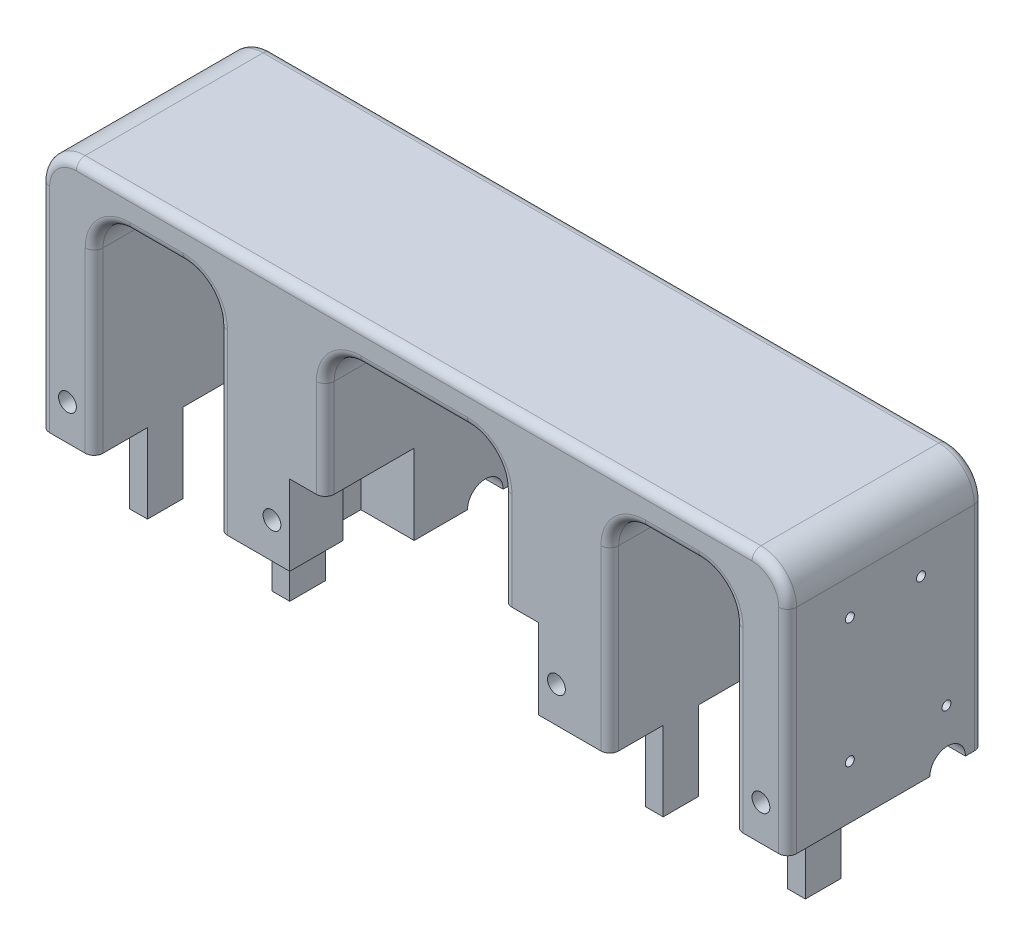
ISO-10303-21;
HEADER;
FILE_DESCRIPTION(('STEP AP214'),'2;1');
FILE_NAME('part.step','',(''),(''),'','','');
FILE_SCHEMA(('AUTOMOTIVE_DESIGN { 1 0 10303 214 1 1 1 1 }'));
ENDSEC;
DATA;
#1=APPLICATION_CONTEXT('core data for automotive mechanical design processes');
#2=APPLICATION_PROTOCOL_DEFINITION('international standard','automotive_design',2000,#1);
#3=PRODUCT_CONTEXT('',#1,'mechanical');
#4=PRODUCT('Part','Part','',(#3));
#5=PRODUCT_RELATED_PRODUCT_CATEGORY('part','',(#4));
#6=PRODUCT_DEFINITION_FORMATION('','',#4);
#7=PRODUCT_DEFINITION_CONTEXT('part definition',#1,'design');
#8=PRODUCT_DEFINITION('design','',#6,#7);
#9=PRODUCT_DEFINITION_SHAPE('','',#8);
#10=(LENGTH_UNIT() NAMED_UNIT(*) SI_UNIT(.MILLI.,.METRE.));
#11=(NAMED_UNIT(*) PLANE_ANGLE_UNIT() SI_UNIT($,.RADIAN.));
#12=(NAMED_UNIT(*) SI_UNIT($,.STERADIAN.) SOLID_ANGLE_UNIT());
#13=UNCERTAINTY_MEASURE_WITH_UNIT(LENGTH_MEASURE(1.E-05),#10,'distance_accuracy_value','');
#14=(GEOMETRIC_REPRESENTATION_CONTEXT(3) GLOBAL_UNCERTAINTY_ASSIGNED_CONTEXT((#13)) GLOBAL_UNIT_ASSIGNED_CONTEXT((#10,
#11,#12)) REPRESENTATION_CONTEXT('',''));
#15=CARTESIAN_POINT('',(0.,0.,0.));
#16=DIRECTION('',(0.,0.,1.));
#17=DIRECTION('',(1.,0.,0.));
#18=AXIS2_PLACEMENT_3D('',#15,#16,#17);
#19=CARTESIAN_POINT('',(165.1,-1.11022302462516E-13,76.1999999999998));
#20=DIRECTION('',(0.,0.,-1.));
#21=DIRECTION('',(-1.,0.,0.));
#22=AXIS2_PLACEMENT_3D('',#19,#20,#21);
#23=PLANE('',#22);
#24=DIRECTION('',(1.,0.,0.));
#25=VECTOR('',#24,1.);
#26=CARTESIAN_POINT('',(0.,565.15,76.1999999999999));
#27=LINE('',#26,#25);
#28=CARTESIAN_POINT('',(330.2,565.15,76.1999999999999));
#29=VERTEX_POINT('',#28);
#30=CARTESIAN_POINT('',(368.3,565.15,76.1999999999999));
#31=VERTEX_POINT('',#30);
#32=EDGE_CURVE('E554',#29,#31,#27,.T.);
#33=ORIENTED_EDGE('',*,*,#32,.F.);
#34=DIRECTION('',(0.,1.,0.));
#35=VECTOR('',#34,1.);
#36=CARTESIAN_POINT('',(330.2,241.3,76.1999999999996));
#37=LINE('',#36,#35);
#38=CARTESIAN_POINT('',(330.2,508.,76.1999999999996));
#39=VERTEX_POINT('',#38);
#40=EDGE_CURVE('E1082',#39,#29,#37,.T.);
#41=ORIENTED_EDGE('',*,*,#40,.F.);
#42=DIRECTION('',(1.,0.,0.));
#43=VECTOR('',#42,1.);
#44=CARTESIAN_POINT('',(165.1,508.,76.1999999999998));
#45=LINE('',#44,#43);
#46=CARTESIAN_POINT('',(368.3,508.,76.1999999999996));
#47=VERTEX_POINT('',#46);
#48=EDGE_CURVE('E578',#39,#47,#45,.T.);
#49=ORIENTED_EDGE('',*,*,#48,.T.);
#50=DIRECTION('',(0.,1.,0.));
#51=VECTOR('',#50,1.);
#52=CARTESIAN_POINT('',(368.3,0.,76.1999999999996));
#53=LINE('',#52,#51);
#54=EDGE_CURVE('E572',#47,#31,#53,.T.);
#55=ORIENTED_EDGE('',*,*,#54,.T.);
#56=EDGE_LOOP('',(#33,#41,#49,#55));
#57=FACE_BOUND('',#56,.T.);
#58=ADVANCED_FACE('F43',(#57),#23,.F.);
#59=CARTESIAN_POINT('',(368.3,0.,76.1999999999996));
#60=DIRECTION('',(1.,0.,0.));
#61=DIRECTION('',(0.,1.,0.));
#62=AXIS2_PLACEMENT_3D('',#59,#60,#61);
#63=PLANE('',#62);
#64=DIRECTION('',(0.,0.,-1.));
#65=VECTOR('',#64,1.);
#66=CARTESIAN_POINT('',(368.3,565.15,254.176252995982));
#67=LINE('',#66,#65);
#68=CARTESIAN_POINT('',(368.3,565.15,101.6));
#69=VERTEX_POINT('',#68);
#70=EDGE_CURVE('E558',#69,#31,#67,.T.);
#71=ORIENTED_EDGE('',*,*,#70,.T.);
#72=ORIENTED_EDGE('',*,*,#54,.F.);
#73=DIRECTION('',(0.,0.,1.));
#74=VECTOR('',#73,1.);
#75=CARTESIAN_POINT('',(368.3,508.,76.1999999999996));
#76=LINE('',#75,#74);
#77=CARTESIAN_POINT('',(368.3,508.,101.6));
#78=VERTEX_POINT('',#77);
#79=EDGE_CURVE('E1043',#47,#78,#76,.T.);
#80=ORIENTED_EDGE('',*,*,#79,.T.);
#81=DIRECTION('',(0.,1.,0.));
#82=VECTOR('',#81,1.);
#83=CARTESIAN_POINT('',(368.3,0.,101.6));
#84=LINE('',#83,#82);
#85=EDGE_CURVE('E574',#78,#69,#84,.T.);
#86=ORIENTED_EDGE('',*,*,#85,.T.);
#87=EDGE_LOOP('',(#71,#72,#80,#86));
#88=FACE_BOUND('',#87,.T.);
#89=ADVANCED_FACE('F570',(#88),#63,.F.);
#90=CARTESIAN_POINT('',(355.6,0.,101.6));
#91=DIRECTION('',(0.,0.,1.));
#92=DIRECTION('',(1.,0.,0.));
#93=AXIS2_PLACEMENT_3D('',#90,#91,#92);
#94=PLANE('',#93);
#95=DIRECTION('',(-1.,0.,0.));
#96=VECTOR('',#95,1.);
#97=CARTESIAN_POINT('',(355.6,565.15,101.6));
#98=LINE('',#97,#96);
#99=CARTESIAN_POINT('',(355.6,565.15,101.6));
#100=VERTEX_POINT('',#99);
#101=EDGE_CURVE('E1105',#69,#100,#98,.T.);
#102=ORIENTED_EDGE('',*,*,#101,.F.);
#103=ORIENTED_EDGE('',*,*,#85,.F.);
#104=DIRECTION('',(-1.,0.,0.));
#105=VECTOR('',#104,1.);
#106=CARTESIAN_POINT('',(355.6,508.,101.6));
#107=LINE('',#106,#105);
#108=CARTESIAN_POINT('',(355.6,508.,101.6));
#109=VERTEX_POINT('',#108);
#110=EDGE_CURVE('E1046',#78,#109,#107,.T.);
#111=ORIENTED_EDGE('',*,*,#110,.T.);
#112=DIRECTION('',(0.,1.,0.));
#113=VECTOR('',#112,1.);
#114=CARTESIAN_POINT('',(355.6,0.,101.6));
#115=LINE('',#114,#113);
#116=EDGE_CURVE('E584',#109,#100,#115,.T.);
#117=ORIENTED_EDGE('',*,*,#116,.T.);
#118=EDGE_LOOP('',(#102,#103,#111,#117));
#119=FACE_BOUND('',#118,.T.);
#120=ADVANCED_FACE('F1480',(#119),#94,.F.);
#121=CARTESIAN_POINT('',(355.6,0.,101.6));
#122=DIRECTION('',(1.,0.,0.));
#123=DIRECTION('',(0.,0.,-1.));
#124=AXIS2_PLACEMENT_3D('',#121,#122,#123);
#125=PLANE('',#124);
#126=DIRECTION('',(0.,0.,1.));
#127=VECTOR('',#126,1.);
#128=CARTESIAN_POINT('',(355.6,565.15,101.6));
#129=LINE('',#128,#127);
#130=CARTESIAN_POINT('',(355.6,565.15,139.7));
#131=VERTEX_POINT('',#130);
#132=EDGE_CURVE('E649',#100,#131,#129,.T.);
#133=ORIENTED_EDGE('',*,*,#132,.F.);
#134=ORIENTED_EDGE('',*,*,#116,.F.);
#135=DIRECTION('',(0.,0.,1.));
#136=VECTOR('',#135,1.);
#137=CARTESIAN_POINT('',(355.6,508.,101.6));
#138=LINE('',#137,#136);
#139=CARTESIAN_POINT('',(355.6,508.,139.7));
#140=VERTEX_POINT('',#139);
#141=EDGE_CURVE('E1049',#109,#140,#138,.T.);
#142=ORIENTED_EDGE('',*,*,#141,.T.);
#143=DIRECTION('',(0.,1.,0.));
#144=VECTOR('',#143,1.);
#145=CARTESIAN_POINT('',(355.6,0.,139.7));
#146=LINE('',#145,#144);
#147=EDGE_CURVE('E597',#140,#131,#146,.T.);
#148=ORIENTED_EDGE('',*,*,#147,.T.);
#149=EDGE_LOOP('',(#133,#134,#142,#148));
#150=FACE_BOUND('',#149,.T.);
#151=ADVANCED_FACE('F1478',(#150),#125,.F.);
#152=CARTESIAN_POINT('',(0.,660.4,0.));
#153=DIRECTION('',(0.,1.,0.));
#154=DIRECTION('',(0.,0.,1.));
#155=AXIS2_PLACEMENT_3D('',#152,#153,#154);
#156=PLANE('',#155);
#157=DIRECTION('',(0.,0.,-1.));
#158=VECTOR('',#157,1.);
#159=CARTESIAN_POINT('',(431.8,660.4,0.));
#160=LINE('',#159,#158);
#161=CARTESIAN_POINT('',(431.8,660.4,133.35));
#162=VERTEX_POINT('',#161);
#163=CARTESIAN_POINT('',(431.8,660.4,6.35));
#164=VERTEX_POINT('',#163);
#165=EDGE_CURVE('E617',#162,#164,#160,.T.);
#166=ORIENTED_EDGE('',*,*,#165,.T.);
#167=DIRECTION('',(-1.,0.,0.));
#168=VECTOR('',#167,1.);
#169=CARTESIAN_POINT('',(0.,660.4,6.35));
#170=LINE('',#169,#168);
#171=CARTESIAN_POINT('',(469.9,660.4,6.34999999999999));
#172=VERTEX_POINT('',#171);
#173=EDGE_CURVE('E904',#164,#172,#170,.F.);
#174=ORIENTED_EDGE('',*,*,#173,.T.);
#175=DIRECTION('',(0.,0.,1.));
#176=VECTOR('',#175,1.);
#177=CARTESIAN_POINT('',(469.9,660.4,139.7));
#178=LINE('',#177,#176);
#179=CARTESIAN_POINT('',(469.9,660.4,133.35));
#180=VERTEX_POINT('',#179);
#181=EDGE_CURVE('E620',#172,#180,#178,.T.);
#182=ORIENTED_EDGE('',*,*,#181,.T.);
#183=DIRECTION('',(1.,0.,0.));
#184=VECTOR('',#183,1.);
#185=CARTESIAN_POINT('',(431.8,660.4,133.35));
#186=LINE('',#185,#184);
#187=EDGE_CURVE('E743',#180,#162,#186,.F.);
#188=ORIENTED_EDGE('',*,*,#187,.T.);
#189=EDGE_LOOP('',(#166,#174,#182,#188));
#190=FACE_BOUND('',#189,.T.);
#191=ADVANCED_FACE('F1487',(#190),#156,.F.);
#192=DIRECTION('',(0.,0.,-1.));
#193=VECTOR('',#192,1.);
#194=CARTESIAN_POINT('',(63.5,660.4,0.));
#195=LINE('',#194,#193);
#196=CARTESIAN_POINT('',(63.5,660.4,133.35));
#197=VERTEX_POINT('',#196);
#198=CARTESIAN_POINT('',(63.5,660.4,6.35));
#199=VERTEX_POINT('',#198);
#200=EDGE_CURVE('E634',#197,#199,#195,.T.);
#201=ORIENTED_EDGE('',*,*,#200,.T.);
#202=DIRECTION('',(-1.,0.,0.));
#203=VECTOR('',#202,1.);
#204=CARTESIAN_POINT('',(0.,660.4,6.35));
#205=LINE('',#204,#203);
#206=CARTESIAN_POINT('',(101.6,660.4,6.34999999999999));
#207=VERTEX_POINT('',#206);
#208=EDGE_CURVE('E881',#199,#207,#205,.F.);
#209=ORIENTED_EDGE('',*,*,#208,.T.);
#210=DIRECTION('',(0.,0.,1.));
#211=VECTOR('',#210,1.);
#212=CARTESIAN_POINT('',(101.6,660.4,139.7));
#213=LINE('',#212,#211);
#214=CARTESIAN_POINT('',(101.6,660.4,133.35));
#215=VERTEX_POINT('',#214);
#216=EDGE_CURVE('E637',#207,#215,#213,.T.);
#217=ORIENTED_EDGE('',*,*,#216,.T.);
#218=DIRECTION('',(1.,0.,0.));
#219=VECTOR('',#218,1.);
#220=CARTESIAN_POINT('',(63.5,660.4,133.35));
#221=LINE('',#220,#219);
#222=EDGE_CURVE('E751',#215,#197,#221,.F.);
#223=ORIENTED_EDGE('',*,*,#222,.T.);
#224=EDGE_LOOP('',(#201,#209,#217,#223));
#225=FACE_BOUND('',#224,.T.);
#226=ADVANCED_FACE('F1513',(#225),#156,.F.);
#227=CARTESIAN_POINT('',(0.,0.,139.7));
#228=DIRECTION('',(0.,0.,1.));
#229=DIRECTION('',(1.,0.,0.));
#230=AXIS2_PLACEMENT_3D('',#227,#228,#229);
#231=PLANE('',#230);
#232=CARTESIAN_POINT('',(25.3999999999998,660.4,139.7));
#233=DIRECTION('',(0.,0.,1.));
#234=DIRECTION('',(1.,0.,0.));
#235=AXIS2_PLACEMENT_3D('',#232,#233,#234);
#236=CIRCLE('',#235,19.05);
#237=CARTESIAN_POINT('',(25.3999999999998,679.45,139.7));
#238=VERTEX_POINT('',#237);
#239=CARTESIAN_POINT('',(6.34999999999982,660.4,139.7));
#240=VERTEX_POINT('',#239);
#241=EDGE_CURVE('E720',#238,#240,#236,.T.);
#242=ORIENTED_EDGE('',*,*,#241,.T.);
#243=DIRECTION('',(0.,-1.,0.));
#244=VECTOR('',#243,1.);
#245=CARTESIAN_POINT('',(6.34999999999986,508.,139.7));
#246=LINE('',#245,#244);
#247=CARTESIAN_POINT('',(6.34999999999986,508.,139.7));
#248=VERTEX_POINT('',#247);
#249=EDGE_CURVE('E722',#240,#248,#246,.T.);
#250=ORIENTED_EDGE('',*,*,#249,.T.);
#251=DIRECTION('',(1.,0.,0.));
#252=VECTOR('',#251,1.);
#253=CARTESIAN_POINT('',(-2.22044604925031E-13,508.,139.7));
#254=LINE('',#253,#252);
#255=CARTESIAN_POINT('',(31.75,508.,139.7));
#256=VERTEX_POINT('',#255);
#257=EDGE_CURVE('E977',#248,#256,#254,.T.);
#258=ORIENTED_EDGE('',*,*,#257,.T.);
#259=DIRECTION('',(0.,-1.,0.));
#260=VECTOR('',#259,1.);
#261=CARTESIAN_POINT('',(31.75,635.,139.7));
#262=LINE('',#261,#260);
#263=CARTESIAN_POINT('',(31.75,635.,139.7));
#264=VERTEX_POINT('',#263);
#265=EDGE_CURVE('E702',#256,#264,#262,.F.);
#266=ORIENTED_EDGE('',*,*,#265,.T.);
#267=CARTESIAN_POINT('',(63.5,635.,139.7));
#268=DIRECTION('',(0.,0.,1.));
#269=DIRECTION('',(1.,0.,0.));
#270=AXIS2_PLACEMENT_3D('',#267,#268,#269);
#271=CIRCLE('',#270,31.75);
#272=CARTESIAN_POINT('',(63.5,666.75,139.7));
#273=VERTEX_POINT('',#272);
#274=EDGE_CURVE('E700',#264,#273,#271,.F.);
#275=ORIENTED_EDGE('',*,*,#274,.T.);
#276=DIRECTION('',(1.,0.,0.));
#277=VECTOR('',#276,1.);
#278=CARTESIAN_POINT('',(101.6,666.75,139.7));
#279=LINE('',#278,#277);
#280=CARTESIAN_POINT('',(101.6,666.75,139.7));
#281=VERTEX_POINT('',#280);
#282=EDGE_CURVE('E698',#273,#281,#279,.T.);
#283=ORIENTED_EDGE('',*,*,#282,.T.);
#284=CARTESIAN_POINT('',(101.6,635.,139.7));
#285=DIRECTION('',(0.,0.,1.));
#286=DIRECTION('',(1.,0.,0.));
#287=AXIS2_PLACEMENT_3D('',#284,#285,#286);
#288=CIRCLE('',#287,31.75);
#289=CARTESIAN_POINT('',(133.35,635.,139.7));
#290=VERTEX_POINT('',#289);
#291=EDGE_CURVE('E696',#281,#290,#288,.F.);
#292=ORIENTED_EDGE('',*,*,#291,.T.);
#293=DIRECTION('',(0.,1.,0.));
#294=VECTOR('',#293,1.);
#295=CARTESIAN_POINT('',(133.35,508.,139.7));
#296=LINE('',#295,#294);
#297=CARTESIAN_POINT('',(133.35,508.,139.7));
#298=VERTEX_POINT('',#297);
#299=EDGE_CURVE('E694',#290,#298,#296,.F.);
#300=ORIENTED_EDGE('',*,*,#299,.T.);
#301=CARTESIAN_POINT('',(177.8,508.,139.7));
#302=VERTEX_POINT('',#301);
#303=EDGE_CURVE('E1251',#298,#302,#254,.T.);
#304=ORIENTED_EDGE('',*,*,#303,.T.);
#305=DIRECTION('',(0.,-1.,0.));
#306=VECTOR('',#305,1.);
#307=CARTESIAN_POINT('',(177.8,0.,139.7));
#308=LINE('',#307,#306);
#309=CARTESIAN_POINT('',(177.8,565.15,139.7));
#310=VERTEX_POINT('',#309);
#311=EDGE_CURVE('E594',#310,#302,#308,.T.);
#312=ORIENTED_EDGE('',*,*,#311,.F.);
#313=DIRECTION('',(-1.,0.,0.));
#314=VECTOR('',#313,1.);
#315=CARTESIAN_POINT('',(0.,565.15,139.7));
#316=LINE('',#315,#314);
#317=CARTESIAN_POINT('',(196.85,565.15,139.7));
#318=VERTEX_POINT('',#317);
#319=EDGE_CURVE('E1101',#318,#310,#316,.T.);
#320=ORIENTED_EDGE('',*,*,#319,.F.);
#321=DIRECTION('',(0.,1.,0.));
#322=VECTOR('',#321,1.);
#323=CARTESIAN_POINT('',(196.85,0.,139.7));
#324=LINE('',#323,#322);
#325=CARTESIAN_POINT('',(196.85,635.,139.7));
#326=VERTEX_POINT('',#325);
#327=EDGE_CURVE('E691',#318,#326,#324,.T.);
#328=ORIENTED_EDGE('',*,*,#327,.T.);
#329=CARTESIAN_POINT('',(228.6,635.,139.7));
#330=DIRECTION('',(0.,0.,1.));
#331=DIRECTION('',(1.,0.,0.));
#332=AXIS2_PLACEMENT_3D('',#329,#330,#331);
#333=CIRCLE('',#332,31.75);
#334=CARTESIAN_POINT('',(228.6,666.75,139.7));
#335=VERTEX_POINT('',#334);
#336=EDGE_CURVE('E683',#326,#335,#333,.F.);
#337=ORIENTED_EDGE('',*,*,#336,.T.);
#338=DIRECTION('',(1.,0.,0.));
#339=VECTOR('',#338,1.);
#340=CARTESIAN_POINT('',(304.8,666.75,139.7));
#341=LINE('',#340,#339);
#342=CARTESIAN_POINT('',(304.8,666.75,139.7));
#343=VERTEX_POINT('',#342);
#344=EDGE_CURVE('E685',#335,#343,#341,.T.);
#345=ORIENTED_EDGE('',*,*,#344,.T.);
#346=CARTESIAN_POINT('',(304.8,635.,139.7));
#347=DIRECTION('',(0.,0.,1.));
#348=DIRECTION('',(1.,0.,0.));
#349=AXIS2_PLACEMENT_3D('',#346,#347,#348);
#350=CIRCLE('',#349,31.75);
#351=CARTESIAN_POINT('',(336.55,635.,139.7));
#352=VERTEX_POINT('',#351);
#353=EDGE_CURVE('E687',#343,#352,#350,.F.);
#354=ORIENTED_EDGE('',*,*,#353,.T.);
#355=DIRECTION('',(0.,-1.,0.));
#356=VECTOR('',#355,1.);
#357=CARTESIAN_POINT('',(336.55,565.15,139.7));
#358=LINE('',#357,#356);
#359=CARTESIAN_POINT('',(336.55,565.15,139.7));
#360=VERTEX_POINT('',#359);
#361=EDGE_CURVE('E689',#352,#360,#358,.T.);
#362=ORIENTED_EDGE('',*,*,#361,.T.);
#363=DIRECTION('',(1.,0.,0.));
#364=VECTOR('',#363,1.);
#365=CARTESIAN_POINT('',(0.,565.15,139.7));
#366=LINE('',#365,#364);
#367=EDGE_CURVE('E575',#360,#131,#366,.T.);
#368=ORIENTED_EDGE('',*,*,#367,.T.);
#369=ORIENTED_EDGE('',*,*,#147,.F.);
#370=CARTESIAN_POINT('',(400.05,508.,139.7));
#371=VERTEX_POINT('',#370);
#372=EDGE_CURVE('E1252',#140,#371,#254,.T.);
#373=ORIENTED_EDGE('',*,*,#372,.T.);
#374=DIRECTION('',(0.,-1.,0.));
#375=VECTOR('',#374,1.);
#376=CARTESIAN_POINT('',(400.05,635.,139.7));
#377=LINE('',#376,#375);
#378=CARTESIAN_POINT('',(400.05,635.,139.7));
#379=VERTEX_POINT('',#378);
#380=EDGE_CURVE('E712',#371,#379,#377,.F.);
#381=ORIENTED_EDGE('',*,*,#380,.T.);
#382=CARTESIAN_POINT('',(431.8,635.,139.7));
#383=DIRECTION('',(0.,0.,1.));
#384=DIRECTION('',(1.,0.,0.));
#385=AXIS2_PLACEMENT_3D('',#382,#383,#384);
#386=CIRCLE('',#385,31.75);
#387=CARTESIAN_POINT('',(431.8,666.75,139.7));
#388=VERTEX_POINT('',#387);
#389=EDGE_CURVE('E704',#379,#388,#386,.F.);
#390=ORIENTED_EDGE('',*,*,#389,.T.);
#391=DIRECTION('',(1.,0.,0.));
#392=VECTOR('',#391,1.);
#393=CARTESIAN_POINT('',(469.9,666.75,139.7));
#394=LINE('',#393,#392);
#395=CARTESIAN_POINT('',(469.9,666.75,139.7));
#396=VERTEX_POINT('',#395);
#397=EDGE_CURVE('E706',#388,#396,#394,.T.);
#398=ORIENTED_EDGE('',*,*,#397,.T.);
#399=CARTESIAN_POINT('',(469.9,635.,139.7));
#400=DIRECTION('',(0.,0.,1.));
#401=DIRECTION('',(1.,0.,0.));
#402=AXIS2_PLACEMENT_3D('',#399,#400,#401);
#403=CIRCLE('',#402,31.75);
#404=CARTESIAN_POINT('',(501.65,635.,139.7));
#405=VERTEX_POINT('',#404);
#406=EDGE_CURVE('E708',#396,#405,#403,.F.);
#407=ORIENTED_EDGE('',*,*,#406,.T.);
#408=DIRECTION('',(0.,1.,0.));
#409=VECTOR('',#408,1.);
#410=CARTESIAN_POINT('',(501.65,508.,139.7));
#411=LINE('',#410,#409);
#412=CARTESIAN_POINT('',(501.65,508.,139.7));
#413=VERTEX_POINT('',#412);
#414=EDGE_CURVE('E710',#405,#413,#411,.F.);
#415=ORIENTED_EDGE('',*,*,#414,.T.);
#416=CARTESIAN_POINT('',(527.05,508.,139.7));
#417=VERTEX_POINT('',#416);
#418=EDGE_CURVE('E1254',#413,#417,#254,.T.);
#419=ORIENTED_EDGE('',*,*,#418,.T.);
#420=DIRECTION('',(0.,-1.,0.));
#421=VECTOR('',#420,1.);
#422=CARTESIAN_POINT('',(527.05,1.43982048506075E-13,139.7));
#423=LINE('',#422,#421);
#424=CARTESIAN_POINT('',(527.05,660.4,139.7));
#425=VERTEX_POINT('',#424);
#426=EDGE_CURVE('E718',#417,#425,#423,.F.);
#427=ORIENTED_EDGE('',*,*,#426,.T.);
#428=CARTESIAN_POINT('',(508.,660.4,139.7));
#429=DIRECTION('',(0.,0.,1.));
#430=DIRECTION('',(1.,0.,0.));
#431=AXIS2_PLACEMENT_3D('',#428,#429,#430);
#432=CIRCLE('',#431,19.05);
#433=CARTESIAN_POINT('',(508.,679.45,139.7));
#434=VERTEX_POINT('',#433);
#435=EDGE_CURVE('E716',#425,#434,#432,.T.);
#436=ORIENTED_EDGE('',*,*,#435,.T.);
#437=DIRECTION('',(1.,0.,0.));
#438=VECTOR('',#437,1.);
#439=CARTESIAN_POINT('',(0.,679.45,139.7));
#440=LINE('',#439,#438);
#441=EDGE_CURVE('E714',#434,#238,#440,.F.);
#442=ORIENTED_EDGE('',*,*,#441,.T.);
#443=EDGE_LOOP('',(#242,#250,#258,#266,#275,#283,#292,#300,#304,#312,#320,#328,#337,#345,#354,
#362,#368,#369,#373,#381,#390,#398,#407,#415,#419,#427,#436,#442));
#444=FACE_BOUND('',#443,.T.);
#445=CARTESIAN_POINT('',(368.3,533.4,139.7));
#446=DIRECTION('',(0.,0.,-1.));
#447=DIRECTION('',(-1.,0.,0.));
#448=AXIS2_PLACEMENT_3D('',#445,#446,#447);
#449=CIRCLE('',#448,6.34999999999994);
#450=CARTESIAN_POINT('',(374.65,533.4,139.7));
#451=VERTEX_POINT('',#450);
#452=EDGE_CURVE('E1209',#451,#451,#449,.T.);
#453=ORIENTED_EDGE('',*,*,#452,.T.);
#454=EDGE_LOOP('',(#453));
#455=FACE_BOUND('',#454,.T.);
#456=CARTESIAN_POINT('',(165.1,533.4,139.7));
#457=DIRECTION('',(0.,0.,-1.));
#458=DIRECTION('',(-1.,0.,0.));
#459=AXIS2_PLACEMENT_3D('',#456,#457,#458);
#460=CIRCLE('',#459,6.34999999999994);
#461=CARTESIAN_POINT('',(171.45,533.4,139.7));
#462=VERTEX_POINT('',#461);
#463=EDGE_CURVE('E1215',#462,#462,#460,.F.);
#464=ORIENTED_EDGE('',*,*,#463,.F.);
#465=EDGE_LOOP('',(#464));
#466=FACE_BOUND('',#465,.T.);
#467=CARTESIAN_POINT('',(19.0499999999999,533.4,139.7));
#468=DIRECTION('',(0.,0.,-1.));
#469=DIRECTION('',(-1.,0.,0.));
#470=AXIS2_PLACEMENT_3D('',#467,#468,#469);
#471=CIRCLE('',#470,6.34999999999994);
#472=CARTESIAN_POINT('',(25.3999999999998,533.4,139.7));
#473=VERTEX_POINT('',#472);
#474=EDGE_CURVE('E1198',#473,#473,#471,.F.);
#475=ORIENTED_EDGE('',*,*,#474,.F.);
#476=EDGE_LOOP('',(#475));
#477=FACE_BOUND('',#476,.T.);
#478=CARTESIAN_POINT('',(514.35,533.4,139.7));
#479=DIRECTION('',(0.,0.,-1.));
#480=DIRECTION('',(-1.,0.,0.));
#481=AXIS2_PLACEMENT_3D('',#478,#479,#480);
#482=CIRCLE('',#481,6.34999999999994);
#483=CARTESIAN_POINT('',(520.7,533.4,139.7));
#484=VERTEX_POINT('',#483);
#485=EDGE_CURVE('E1203',#484,#484,#482,.T.);
#486=ORIENTED_EDGE('',*,*,#485,.T.);
#487=EDGE_LOOP('',(#486));
#488=FACE_BOUND('',#487,.T.);
#489=ADVANCED_FACE('F1316',(#444,#455,#466,#477,#488),#231,.T.);
#490=CARTESIAN_POINT('',(0.,0.,0.));
#491=DIRECTION('',(0.,0.,1.));
#492=DIRECTION('',(1.,0.,0.));
#493=AXIS2_PLACEMENT_3D('',#490,#491,#492);
#494=PLANE('',#493);
#495=CARTESIAN_POINT('',(368.3,533.4,0.));
#496=DIRECTION('',(0.,0.,-1.));
#497=DIRECTION('',(-1.,0.,0.));
#498=AXIS2_PLACEMENT_3D('',#495,#496,#497);
#499=CIRCLE('',#498,6.34999999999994);
#500=CARTESIAN_POINT('',(361.95,533.4,0.));
#501=VERTEX_POINT('',#500);
#502=EDGE_CURVE('E1233',#501,#501,#499,.T.);
#503=ORIENTED_EDGE('',*,*,#502,.F.);
#504=EDGE_LOOP('',(#503));
#505=FACE_BOUND('',#504,.T.);
#506=CARTESIAN_POINT('',(165.1,533.4,0.));
#507=DIRECTION('',(0.,0.,-1.));
#508=DIRECTION('',(-1.,0.,0.));
#509=AXIS2_PLACEMENT_3D('',#506,#507,#508);
#510=CIRCLE('',#509,6.34999999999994);
#511=CARTESIAN_POINT('',(158.75,533.4,0.));
#512=VERTEX_POINT('',#511);
#513=EDGE_CURVE('E1239',#512,#512,#510,.F.);
#514=ORIENTED_EDGE('',*,*,#513,.T.);
#515=EDGE_LOOP('',(#514));
#516=FACE_BOUND('',#515,.T.);
#517=CARTESIAN_POINT('',(19.0499999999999,533.4,0.));
#518=DIRECTION('',(0.,0.,-1.));
#519=DIRECTION('',(-1.,0.,0.));
#520=AXIS2_PLACEMENT_3D('',#517,#518,#519);
#521=CIRCLE('',#520,6.34999999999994);
#522=CARTESIAN_POINT('',(12.7,533.4,0.));
#523=VERTEX_POINT('',#522);
#524=EDGE_CURVE('E1202',#523,#523,#521,.F.);
#525=ORIENTED_EDGE('',*,*,#524,.T.);
#526=EDGE_LOOP('',(#525));
#527=FACE_BOUND('',#526,.T.);
#528=CARTESIAN_POINT('',(63.5,635.,0.));
#529=DIRECTION('',(0.,0.,1.));
#530=DIRECTION('',(1.,0.,0.));
#531=AXIS2_PLACEMENT_3D('',#528,#529,#530);
#532=CIRCLE('',#531,31.75);
#533=CARTESIAN_POINT('',(63.5,666.75,0.));
#534=VERTEX_POINT('',#533);
#535=CARTESIAN_POINT('',(31.75,635.,0.));
#536=VERTEX_POINT('',#535);
#537=EDGE_CURVE('E873',#534,#536,#532,.T.);
#538=ORIENTED_EDGE('',*,*,#537,.T.);
#539=DIRECTION('',(0.,1.,0.));
#540=VECTOR('',#539,1.);
#541=CARTESIAN_POINT('',(31.7500000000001,0.,0.));
#542=LINE('',#541,#540);
#543=CARTESIAN_POINT('',(31.75,508.,0.));
#544=VERTEX_POINT('',#543);
#545=EDGE_CURVE('E875',#536,#544,#542,.F.);
#546=ORIENTED_EDGE('',*,*,#545,.T.);
#547=DIRECTION('',(1.,0.,0.));
#548=VECTOR('',#547,1.);
#549=CARTESIAN_POINT('',(-2.22044604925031E-13,508.,0.));
#550=LINE('',#549,#548);
#551=CARTESIAN_POINT('',(6.34999999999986,508.,0.));
#552=VERTEX_POINT('',#551);
#553=EDGE_CURVE('E966',#552,#544,#550,.T.);
#554=ORIENTED_EDGE('',*,*,#553,.F.);
#555=DIRECTION('',(0.,-1.,0.));
#556=VECTOR('',#555,1.);
#557=CARTESIAN_POINT('',(6.35,0.,0.));
#558=LINE('',#557,#556);
#559=CARTESIAN_POINT('',(6.34999999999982,660.4,0.));
#560=VERTEX_POINT('',#559);
#561=EDGE_CURVE('E656',#552,#560,#558,.F.);
#562=ORIENTED_EDGE('',*,*,#561,.T.);
#563=CARTESIAN_POINT('',(25.3999999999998,660.4,0.));
#564=DIRECTION('',(0.,0.,1.));
#565=DIRECTION('',(1.,0.,0.));
#566=AXIS2_PLACEMENT_3D('',#563,#564,#565);
#567=CIRCLE('',#566,19.05);
#568=CARTESIAN_POINT('',(25.3999999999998,679.45,0.));
#569=VERTEX_POINT('',#568);
#570=EDGE_CURVE('E654',#560,#569,#567,.F.);
#571=ORIENTED_EDGE('',*,*,#570,.T.);
#572=DIRECTION('',(-1.,0.,0.));
#573=VECTOR('',#572,1.);
#574=CARTESIAN_POINT('',(508.,679.45,0.));
#575=LINE('',#574,#573);
#576=CARTESIAN_POINT('',(508.,679.45,0.));
#577=VERTEX_POINT('',#576);
#578=EDGE_CURVE('E652',#569,#577,#575,.F.);
#579=ORIENTED_EDGE('',*,*,#578,.T.);
#580=CARTESIAN_POINT('',(508.,660.4,0.));
#581=DIRECTION('',(0.,0.,1.));
#582=DIRECTION('',(1.,0.,0.));
#583=AXIS2_PLACEMENT_3D('',#580,#581,#582);
#584=CIRCLE('',#583,19.05);
#585=CARTESIAN_POINT('',(527.05,660.4,0.));
#586=VERTEX_POINT('',#585);
#587=EDGE_CURVE('E658',#577,#586,#584,.F.);
#588=ORIENTED_EDGE('',*,*,#587,.T.);
#589=DIRECTION('',(0.,-1.,0.));
#590=VECTOR('',#589,1.);
#591=CARTESIAN_POINT('',(527.05,508.,0.));
#592=LINE('',#591,#590);
#593=CARTESIAN_POINT('',(527.05,508.,0.));
#594=VERTEX_POINT('',#593);
#595=EDGE_CURVE('E660',#586,#594,#592,.T.);
#596=ORIENTED_EDGE('',*,*,#595,.T.);
#597=CARTESIAN_POINT('',(501.65,508.,0.));
#598=VERTEX_POINT('',#597);
#599=EDGE_CURVE('E963',#598,#594,#550,.T.);
#600=ORIENTED_EDGE('',*,*,#599,.F.);
#601=DIRECTION('',(0.,1.,0.));
#602=VECTOR('',#601,1.);
#603=CARTESIAN_POINT('',(501.65,1.04413832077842E-13,0.));
#604=LINE('',#603,#602);
#605=CARTESIAN_POINT('',(501.65,635.,0.));
#606=VERTEX_POINT('',#605);
#607=EDGE_CURVE('E854',#598,#606,#604,.T.);
#608=ORIENTED_EDGE('',*,*,#607,.T.);
#609=CARTESIAN_POINT('',(469.9,635.,0.));
#610=DIRECTION('',(0.,0.,1.));
#611=DIRECTION('',(1.,0.,0.));
#612=AXIS2_PLACEMENT_3D('',#609,#610,#611);
#613=CIRCLE('',#612,31.75);
#614=CARTESIAN_POINT('',(469.9,666.75,0.));
#615=VERTEX_POINT('',#614);
#616=EDGE_CURVE('E852',#606,#615,#613,.T.);
#617=ORIENTED_EDGE('',*,*,#616,.T.);
#618=DIRECTION('',(-1.,0.,0.));
#619=VECTOR('',#618,1.);
#620=CARTESIAN_POINT('',(0.,666.75,0.));
#621=LINE('',#620,#619);
#622=CARTESIAN_POINT('',(431.8,666.75,0.));
#623=VERTEX_POINT('',#622);
#624=EDGE_CURVE('E850',#615,#623,#621,.T.);
#625=ORIENTED_EDGE('',*,*,#624,.T.);
#626=CARTESIAN_POINT('',(431.8,635.,0.));
#627=DIRECTION('',(0.,0.,1.));
#628=DIRECTION('',(1.,0.,0.));
#629=AXIS2_PLACEMENT_3D('',#626,#627,#628);
#630=CIRCLE('',#629,31.75);
#631=CARTESIAN_POINT('',(400.05,635.,0.));
#632=VERTEX_POINT('',#631);
#633=EDGE_CURVE('E848',#623,#632,#630,.T.);
#634=ORIENTED_EDGE('',*,*,#633,.T.);
#635=DIRECTION('',(0.,1.,0.));
#636=VECTOR('',#635,1.);
#637=CARTESIAN_POINT('',(400.05,0.,0.));
#638=LINE('',#637,#636);
#639=CARTESIAN_POINT('',(400.05,508.,0.));
#640=VERTEX_POINT('',#639);
#641=EDGE_CURVE('E846',#632,#640,#638,.F.);
#642=ORIENTED_EDGE('',*,*,#641,.T.);
#643=CARTESIAN_POINT('',(336.55,508.,0.));
#644=VERTEX_POINT('',#643);
#645=EDGE_CURVE('E958',#644,#640,#550,.T.);
#646=ORIENTED_EDGE('',*,*,#645,.F.);
#647=DIRECTION('',(0.,1.,0.));
#648=VECTOR('',#647,1.);
#649=CARTESIAN_POINT('',(336.55,0.,0.));
#650=LINE('',#649,#648);
#651=CARTESIAN_POINT('',(336.55,635.,0.));
#652=VERTEX_POINT('',#651);
#653=EDGE_CURVE('E857',#644,#652,#650,.T.);
#654=ORIENTED_EDGE('',*,*,#653,.T.);
#655=CARTESIAN_POINT('',(304.8,635.,0.));
#656=DIRECTION('',(0.,0.,1.));
#657=DIRECTION('',(1.,0.,0.));
#658=AXIS2_PLACEMENT_3D('',#655,#656,#657);
#659=CIRCLE('',#658,31.75);
#660=CARTESIAN_POINT('',(304.8,666.75,0.));
#661=VERTEX_POINT('',#660);
#662=EDGE_CURVE('E859',#652,#661,#659,.T.);
#663=ORIENTED_EDGE('',*,*,#662,.T.);
#664=DIRECTION('',(-1.,0.,0.));
#665=VECTOR('',#664,1.);
#666=CARTESIAN_POINT('',(0.,666.75,0.));
#667=LINE('',#666,#665);
#668=CARTESIAN_POINT('',(228.6,666.75,0.));
#669=VERTEX_POINT('',#668);
#670=EDGE_CURVE('E861',#661,#669,#667,.T.);
#671=ORIENTED_EDGE('',*,*,#670,.T.);
#672=CARTESIAN_POINT('',(228.6,635.,0.));
#673=DIRECTION('',(0.,0.,1.));
#674=DIRECTION('',(1.,0.,0.));
#675=AXIS2_PLACEMENT_3D('',#672,#673,#674);
#676=CIRCLE('',#675,31.75);
#677=CARTESIAN_POINT('',(196.85,635.,0.));
#678=VERTEX_POINT('',#677);
#679=EDGE_CURVE('E863',#669,#678,#676,.T.);
#680=ORIENTED_EDGE('',*,*,#679,.T.);
#681=DIRECTION('',(0.,1.,0.));
#682=VECTOR('',#681,1.);
#683=CARTESIAN_POINT('',(196.85,508.,0.));
#684=LINE('',#683,#682);
#685=CARTESIAN_POINT('',(196.85,508.,0.));
#686=VERTEX_POINT('',#685);
#687=EDGE_CURVE('E865',#678,#686,#684,.F.);
#688=ORIENTED_EDGE('',*,*,#687,.T.);
#689=CARTESIAN_POINT('',(133.35,508.,0.));
#690=VERTEX_POINT('',#689);
#691=EDGE_CURVE('E962',#690,#686,#550,.T.);
#692=ORIENTED_EDGE('',*,*,#691,.F.);
#693=DIRECTION('',(0.,1.,0.));
#694=VECTOR('',#693,1.);
#695=CARTESIAN_POINT('',(133.35,0.,0.));
#696=LINE('',#695,#694);
#697=CARTESIAN_POINT('',(133.35,635.,0.));
#698=VERTEX_POINT('',#697);
#699=EDGE_CURVE('E867',#690,#698,#696,.T.);
#700=ORIENTED_EDGE('',*,*,#699,.T.);
#701=CARTESIAN_POINT('',(101.6,635.,0.));
#702=DIRECTION('',(0.,0.,1.));
#703=DIRECTION('',(1.,0.,0.));
#704=AXIS2_PLACEMENT_3D('',#701,#702,#703);
#705=CIRCLE('',#704,31.75);
#706=CARTESIAN_POINT('',(101.6,666.75,0.));
#707=VERTEX_POINT('',#706);
#708=EDGE_CURVE('E869',#698,#707,#705,.T.);
#709=ORIENTED_EDGE('',*,*,#708,.T.);
#710=DIRECTION('',(-1.,0.,0.));
#711=VECTOR('',#710,1.);
#712=CARTESIAN_POINT('',(0.,666.75,0.));
#713=LINE('',#712,#711);
#714=EDGE_CURVE('E871',#707,#534,#713,.T.);
#715=ORIENTED_EDGE('',*,*,#714,.T.);
#716=EDGE_LOOP('',(#538,#546,#554,#562,#571,#579,#588,#596,#600,#608,#617,#625,#634,#642,#646,
#654,#663,#671,#680,#688,#692,#700,#709,#715));
#717=FACE_BOUND('',#716,.T.);
#718=CARTESIAN_POINT('',(514.35,533.4,0.));
#719=DIRECTION('',(0.,0.,-1.));
#720=DIRECTION('',(-1.,0.,0.));
#721=AXIS2_PLACEMENT_3D('',#718,#719,#720);
#722=CIRCLE('',#721,6.34999999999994);
#723=CARTESIAN_POINT('',(508.,533.4,0.));
#724=VERTEX_POINT('',#723);
#725=EDGE_CURVE('E1227',#724,#724,#722,.T.);
#726=ORIENTED_EDGE('',*,*,#725,.F.);
#727=EDGE_LOOP('',(#726));
#728=FACE_BOUND('',#727,.T.);
#729=ADVANCED_FACE('F956',(#505,#516,#527,#717,#728),#494,.F.);
#730=DIRECTION('',(0.,1.,0.));
#731=VECTOR('',#730,1.);
#732=CARTESIAN_POINT('',(203.2,241.3,76.1999999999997));
#733=LINE('',#732,#731);
#734=CARTESIAN_POINT('',(203.2,508.,76.1999999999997));
#735=VERTEX_POINT('',#734);
#736=CARTESIAN_POINT('',(203.2,565.15,76.1999999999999));
#737=VERTEX_POINT('',#736);
#738=EDGE_CURVE('E593',#735,#737,#733,.T.);
#739=ORIENTED_EDGE('',*,*,#738,.T.);
#740=DIRECTION('',(-1.,0.,0.));
#741=VECTOR('',#740,1.);
#742=CARTESIAN_POINT('',(0.,565.15,76.1999999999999));
#743=LINE('',#742,#741);
#744=CARTESIAN_POINT('',(165.1,565.15,76.1999999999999));
#745=VERTEX_POINT('',#744);
#746=EDGE_CURVE('E1103',#737,#745,#743,.T.);
#747=ORIENTED_EDGE('',*,*,#746,.T.);
#748=DIRECTION('',(0.,1.,0.));
#749=VECTOR('',#748,1.);
#750=CARTESIAN_POINT('',(165.1,-1.11022302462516E-13,76.1999999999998));
#751=LINE('',#750,#749);
#752=CARTESIAN_POINT('',(165.1,508.,76.1999999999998));
#753=VERTEX_POINT('',#752);
#754=EDGE_CURVE('E579',#753,#745,#751,.T.);
#755=ORIENTED_EDGE('',*,*,#754,.F.);
#756=EDGE_CURVE('E1044',#753,#735,#45,.T.);
#757=ORIENTED_EDGE('',*,*,#756,.T.);
#758=EDGE_LOOP('',(#739,#747,#755,#757));
#759=FACE_BOUND('',#758,.T.);
#760=ADVANCED_FACE('F1438',(#759),#23,.F.);
#761=CARTESIAN_POINT('',(533.4,1.45716771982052E-13,139.7));
#762=DIRECTION('',(1.,0.,0.));
#763=DIRECTION('',(0.,1.,0.));
#764=AXIS2_PLACEMENT_3D('',#761,#762,#763);
#765=PLANE('',#764);
#766=CARTESIAN_POINT('',(533.4,635.,95.25));
#767=DIRECTION('',(1.,0.,0.));
#768=DIRECTION('',(0.,1.,0.));
#769=AXIS2_PLACEMENT_3D('',#766,#767,#768);
#770=CIRCLE('',#769,3.175);
#771=CARTESIAN_POINT('',(533.4,638.175,95.25));
#772=VERTEX_POINT('',#771);
#773=EDGE_CURVE('E3021',#772,#772,#770,.T.);
#774=ORIENTED_EDGE('',*,*,#773,.F.);
#775=EDGE_LOOP('',(#774));
#776=FACE_BOUND('',#775,.T.);
#777=CARTESIAN_POINT('',(533.4,546.090458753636,26.2526147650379));
#778=DIRECTION('',(1.,0.,0.));
#779=DIRECTION('',(0.,1.,0.));
#780=AXIS2_PLACEMENT_3D('',#777,#778,#779);
#781=CIRCLE('',#780,3.175);
#782=CARTESIAN_POINT('',(533.4,549.265458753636,26.2526147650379));
#783=VERTEX_POINT('',#782);
#784=EDGE_CURVE('E3028',#783,#783,#781,.T.);
#785=ORIENTED_EDGE('',*,*,#784,.F.);
#786=EDGE_LOOP('',(#785));
#787=FACE_BOUND('',#786,.T.);
#788=CARTESIAN_POINT('',(533.4,635.,44.45));
#789=DIRECTION('',(1.,0.,0.));
#790=DIRECTION('',(0.,1.,0.));
#791=AXIS2_PLACEMENT_3D('',#788,#789,#790);
#792=CIRCLE('',#791,3.175);
#793=CARTESIAN_POINT('',(533.4,638.175,44.45));
#794=VERTEX_POINT('',#793);
#795=EDGE_CURVE('E3015',#794,#794,#792,.T.);
#796=ORIENTED_EDGE('',*,*,#795,.F.);
#797=EDGE_LOOP('',(#796));
#798=FACE_BOUND('',#797,.T.);
#799=CARTESIAN_POINT('',(533.4,546.1,95.25));
#800=DIRECTION('',(1.,0.,0.));
#801=DIRECTION('',(0.,1.,0.));
#802=AXIS2_PLACEMENT_3D('',#799,#800,#801);
#803=CIRCLE('',#802,3.175);
#804=CARTESIAN_POINT('',(533.4,549.275,95.25));
#805=VERTEX_POINT('',#804);
#806=EDGE_CURVE('E3024',#805,#805,#803,.T.);
#807=ORIENTED_EDGE('',*,*,#806,.F.);
#808=EDGE_LOOP('',(#807));
#809=FACE_BOUND('',#808,.T.);
#810=DIRECTION('',(0.,0.,1.));
#811=VECTOR('',#810,1.);
#812=CARTESIAN_POINT('',(533.4,508.,0.));
#813=LINE('',#812,#811);
#814=CARTESIAN_POINT('',(533.4,508.,6.35));
#815=VERTEX_POINT('',#814);
#816=CARTESIAN_POINT('',(533.4,508.,12.7));
#817=VERTEX_POINT('',#816);
#818=EDGE_CURVE('E1226',#815,#817,#813,.T.);
#819=ORIENTED_EDGE('',*,*,#818,.F.);
#820=DIRECTION('',(0.,-1.,0.));
#821=VECTOR('',#820,1.);
#822=CARTESIAN_POINT('',(533.4,660.4,6.35));
#823=LINE('',#822,#821);
#824=CARTESIAN_POINT('',(533.4,660.4,6.34999999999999));
#825=VERTEX_POINT('',#824);
#826=EDGE_CURVE('E667',#815,#825,#823,.F.);
#827=ORIENTED_EDGE('',*,*,#826,.T.);
#828=DIRECTION('',(0.,0.,-1.));
#829=VECTOR('',#828,1.);
#830=CARTESIAN_POINT('',(533.4,660.4,139.7));
#831=LINE('',#830,#829);
#832=CARTESIAN_POINT('',(533.4,660.4,133.35));
#833=VERTEX_POINT('',#832);
#834=EDGE_CURVE('E611',#825,#833,#831,.F.);
#835=ORIENTED_EDGE('',*,*,#834,.T.);
#836=DIRECTION('',(0.,-1.,0.));
#837=VECTOR('',#836,1.);
#838=CARTESIAN_POINT('',(533.4,1.45716771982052E-13,133.35));
#839=LINE('',#838,#837);
#840=CARTESIAN_POINT('',(533.4,508.,133.35));
#841=VERTEX_POINT('',#840);
#842=EDGE_CURVE('E665',#833,#841,#839,.T.);
#843=ORIENTED_EDGE('',*,*,#842,.T.);
#844=CARTESIAN_POINT('',(533.4,508.,38.1));
#845=VERTEX_POINT('',#844);
#846=EDGE_CURVE('E1249',#845,#841,#813,.T.);
#847=ORIENTED_EDGE('',*,*,#846,.F.);
#848=CARTESIAN_POINT('',(533.4,508.,25.4));
#849=DIRECTION('',(1.,0.,0.));
#850=DIRECTION('',(0.,1.,0.));
#851=AXIS2_PLACEMENT_3D('',#848,#849,#850);
#852=CIRCLE('',#851,12.7);
#853=EDGE_CURVE('E1063',#817,#845,#852,.T.);
#854=ORIENTED_EDGE('',*,*,#853,.F.);
#855=EDGE_LOOP('',(#819,#827,#835,#843,#847,#854));
#856=FACE_BOUND('',#855,.T.);
#857=ADVANCED_FACE('F1497',(#776,#787,#798,#809,#856),#765,.T.);
#858=CARTESIAN_POINT('',(0.,0.,139.7));
#859=DIRECTION('',(1.,0.,0.));
#860=DIRECTION('',(0.,1.,0.));
#861=AXIS2_PLACEMENT_3D('',#858,#859,#860);
#862=PLANE('',#861);
#863=CARTESIAN_POINT('',(-1.11022302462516E-13,635.,95.25));
#864=DIRECTION('',(1.,0.,0.));
#865=DIRECTION('',(0.,1.,0.));
#866=AXIS2_PLACEMENT_3D('',#863,#864,#865);
#867=CIRCLE('',#866,3.175);
#868=CARTESIAN_POINT('',(-1.11889664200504E-13,638.175,95.25));
#869=VERTEX_POINT('',#868);
#870=EDGE_CURVE('E2994',#869,#869,#867,.T.);
#871=ORIENTED_EDGE('',*,*,#870,.T.);
#872=EDGE_LOOP('',(#871));
#873=FACE_BOUND('',#872,.T.);
#874=CARTESIAN_POINT('',(-2.22044604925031E-13,546.090458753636,26.2526147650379));
#875=DIRECTION('',(1.,0.,0.));
#876=DIRECTION('',(0.,1.,0.));
#877=AXIS2_PLACEMENT_3D('',#874,#875,#876);
#878=CIRCLE('',#877,3.175);
#879=CARTESIAN_POINT('',(-2.2291196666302E-13,549.265458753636,26.2526147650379));
#880=VERTEX_POINT('',#879);
#881=EDGE_CURVE('E3008',#880,#880,#878,.T.);
#882=ORIENTED_EDGE('',*,*,#881,.T.);
#883=EDGE_LOOP('',(#882));
#884=FACE_BOUND('',#883,.T.);
#885=CARTESIAN_POINT('',(-1.11022302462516E-13,635.,44.45));
#886=DIRECTION('',(1.,0.,0.));
#887=DIRECTION('',(0.,1.,0.));
#888=AXIS2_PLACEMENT_3D('',#885,#886,#887);
#889=CIRCLE('',#888,3.175);
#890=CARTESIAN_POINT('',(-1.11889664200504E-13,638.175,44.45));
#891=VERTEX_POINT('',#890);
#892=EDGE_CURVE('E3003',#891,#891,#889,.T.);
#893=ORIENTED_EDGE('',*,*,#892,.T.);
#894=EDGE_LOOP('',(#893));
#895=FACE_BOUND('',#894,.T.);
#896=CARTESIAN_POINT('',(-2.22044604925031E-13,546.1,95.25));
#897=DIRECTION('',(1.,0.,0.));
#898=DIRECTION('',(0.,1.,0.));
#899=AXIS2_PLACEMENT_3D('',#896,#897,#898);
#900=CIRCLE('',#899,3.175);
#901=CARTESIAN_POINT('',(-2.2291196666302E-13,549.275,95.25));
#902=VERTEX_POINT('',#901);
#903=EDGE_CURVE('E2993',#902,#902,#900,.T.);
#904=ORIENTED_EDGE('',*,*,#903,.T.);
#905=EDGE_LOOP('',(#904));
#906=FACE_BOUND('',#905,.T.);
#907=DIRECTION('',(0.,0.,1.));
#908=VECTOR('',#907,1.);
#909=CARTESIAN_POINT('',(-1.80411241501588E-13,660.4,0.));
#910=LINE('',#909,#908);
#911=CARTESIAN_POINT('',(-1.80411241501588E-13,660.4,133.35));
#912=VERTEX_POINT('',#911);
#913=CARTESIAN_POINT('',(-1.80411241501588E-13,660.4,6.35));
#914=VERTEX_POINT('',#913);
#915=EDGE_CURVE('E614',#912,#914,#910,.F.);
#916=ORIENTED_EDGE('',*,*,#915,.T.);
#917=DIRECTION('',(0.,-1.,0.));
#918=VECTOR('',#917,1.);
#919=CARTESIAN_POINT('',(0.,0.,6.34999999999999));
#920=LINE('',#919,#918);
#921=CARTESIAN_POINT('',(-2.22044604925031E-13,508.,6.34999999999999));
#922=VERTEX_POINT('',#921);
#923=EDGE_CURVE('E675',#914,#922,#920,.T.);
#924=ORIENTED_EDGE('',*,*,#923,.T.);
#925=DIRECTION('',(0.,0.,1.));
#926=VECTOR('',#925,1.);
#927=CARTESIAN_POINT('',(-2.22044604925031E-13,508.,0.));
#928=LINE('',#927,#926);
#929=CARTESIAN_POINT('',(-2.22044604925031E-13,508.,12.7));
#930=VERTEX_POINT('',#929);
#931=EDGE_CURVE('E1247',#922,#930,#928,.T.);
#932=ORIENTED_EDGE('',*,*,#931,.T.);
#933=CARTESIAN_POINT('',(-1.11022302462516E-13,508.,25.4));
#934=DIRECTION('',(1.,0.,0.));
#935=DIRECTION('',(0.,1.,0.));
#936=AXIS2_PLACEMENT_3D('',#933,#934,#935);
#937=CIRCLE('',#936,12.7);
#938=CARTESIAN_POINT('',(-1.11022302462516E-13,508.,38.1));
#939=VERTEX_POINT('',#938);
#940=EDGE_CURVE('E605',#930,#939,#937,.T.);
#941=ORIENTED_EDGE('',*,*,#940,.T.);
#942=CARTESIAN_POINT('',(-2.22044604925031E-13,508.,133.35));
#943=VERTEX_POINT('',#942);
#944=EDGE_CURVE('E967',#939,#943,#928,.T.);
#945=ORIENTED_EDGE('',*,*,#944,.T.);
#946=DIRECTION('',(0.,-1.,0.));
#947=VECTOR('',#946,1.);
#948=CARTESIAN_POINT('',(-1.80411241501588E-13,660.4,133.35));
#949=LINE('',#948,#947);
#950=EDGE_CURVE('E673',#943,#912,#949,.F.);
#951=ORIENTED_EDGE('',*,*,#950,.T.);
#952=EDGE_LOOP('',(#916,#924,#932,#941,#945,#951));
#953=FACE_BOUND('',#952,.T.);
#954=ADVANCED_FACE('F1502',(#873,#884,#895,#906,#953),#862,.F.);
#955=CARTESIAN_POINT('',(165.1,-1.11022302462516E-13,101.6));
#956=DIRECTION('',(0.,0.,1.));
#957=DIRECTION('',(1.,0.,0.));
#958=AXIS2_PLACEMENT_3D('',#955,#956,#957);
#959=PLANE('',#958);
#960=DIRECTION('',(0.,1.,0.));
#961=VECTOR('',#960,1.);
#962=CARTESIAN_POINT('',(165.1,-1.11022302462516E-13,101.6));
#963=LINE('',#962,#961);
#964=CARTESIAN_POINT('',(165.1,508.,101.6));
#965=VERTEX_POINT('',#964);
#966=CARTESIAN_POINT('',(165.1,565.15,101.6));
#967=VERTEX_POINT('',#966);
#968=EDGE_CURVE('E582',#965,#967,#963,.T.);
#969=ORIENTED_EDGE('',*,*,#968,.T.);
#970=DIRECTION('',(1.,0.,0.));
#971=VECTOR('',#970,1.);
#972=CARTESIAN_POINT('',(165.1,565.15,101.6));
#973=LINE('',#972,#971);
#974=CARTESIAN_POINT('',(177.8,565.15,101.6));
#975=VERTEX_POINT('',#974);
#976=EDGE_CURVE('E1091',#967,#975,#973,.T.);
#977=ORIENTED_EDGE('',*,*,#976,.T.);
#978=DIRECTION('',(0.,1.,0.));
#979=VECTOR('',#978,1.);
#980=CARTESIAN_POINT('',(177.8,-1.11022302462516E-13,101.6));
#981=LINE('',#980,#979);
#982=CARTESIAN_POINT('',(177.8,508.,101.6));
#983=VERTEX_POINT('',#982);
#984=EDGE_CURVE('E590',#983,#975,#981,.T.);
#985=ORIENTED_EDGE('',*,*,#984,.F.);
#986=DIRECTION('',(-1.,0.,0.));
#987=VECTOR('',#986,1.);
#988=CARTESIAN_POINT('',(165.1,508.,101.6));
#989=LINE('',#988,#987);
#990=EDGE_CURVE('E1057',#983,#965,#989,.T.);
#991=ORIENTED_EDGE('',*,*,#990,.T.);
#992=EDGE_LOOP('',(#969,#977,#985,#991));
#993=FACE_BOUND('',#992,.T.);
#994=ADVANCED_FACE('F1089',(#993),#959,.F.);
#995=CARTESIAN_POINT('',(165.1,-1.11022302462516E-13,76.1999999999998));
#996=DIRECTION('',(-1.,0.,0.));
#997=DIRECTION('',(0.,0.,1.));
#998=AXIS2_PLACEMENT_3D('',#995,#996,#997);
#999=PLANE('',#998);
#1000=ORIENTED_EDGE('',*,*,#754,.T.);
#1001=DIRECTION('',(0.,0.,-1.));
#1002=VECTOR('',#1001,1.);
#1003=CARTESIAN_POINT('',(165.1,565.15,254.176252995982));
#1004=LINE('',#1003,#1002);
#1005=EDGE_CURVE('E1096',#967,#745,#1004,.T.);
#1006=ORIENTED_EDGE('',*,*,#1005,.F.);
#1007=ORIENTED_EDGE('',*,*,#968,.F.);
#1008=DIRECTION('',(0.,0.,-1.));
#1009=VECTOR('',#1008,1.);
#1010=CARTESIAN_POINT('',(165.1,508.,76.1999999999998));
#1011=LINE('',#1010,#1009);
#1012=EDGE_CURVE('E1054',#965,#753,#1011,.T.);
#1013=ORIENTED_EDGE('',*,*,#1012,.T.);
#1014=EDGE_LOOP('',(#1000,#1006,#1007,#1013));
#1015=FACE_BOUND('',#1014,.T.);
#1016=ADVANCED_FACE('F1094',(#1015),#999,.F.);
#1017=CARTESIAN_POINT('',(177.8,-1.11022302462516E-13,101.6));
#1018=DIRECTION('',(-1.,0.,0.));
#1019=DIRECTION('',(0.,0.,1.));
#1020=AXIS2_PLACEMENT_3D('',#1017,#1018,#1019);
#1021=PLANE('',#1020);
#1022=ORIENTED_EDGE('',*,*,#984,.T.);
#1023=DIRECTION('',(0.,0.,1.));
#1024=VECTOR('',#1023,1.);
#1025=CARTESIAN_POINT('',(177.8,565.15,101.6));
#1026=LINE('',#1025,#1024);
#1027=EDGE_CURVE('E646',#975,#310,#1026,.T.);
#1028=ORIENTED_EDGE('',*,*,#1027,.T.);
#1029=ORIENTED_EDGE('',*,*,#311,.T.);
#1030=DIRECTION('',(0.,0.,-1.));
#1031=VECTOR('',#1030,1.);
#1032=CARTESIAN_POINT('',(177.8,508.,101.6));
#1033=LINE('',#1032,#1031);
#1034=EDGE_CURVE('E1060',#302,#983,#1033,.T.);
#1035=ORIENTED_EDGE('',*,*,#1034,.T.);
#1036=EDGE_LOOP('',(#1022,#1028,#1029,#1035));
#1037=FACE_BOUND('',#1036,.T.);
#1038=ADVANCED_FACE('F1440',(#1037),#1021,.F.);
#1039=CARTESIAN_POINT('',(495.3,0.,155.448));
#1040=DIRECTION('',(1.,0.,0.));
#1041=DIRECTION('',(0.,1.,0.));
#1042=AXIS2_PLACEMENT_3D('',#1039,#1040,#1041);
#1043=PLANE('',#1042);
#1044=DIRECTION('',(0.,0.,1.));
#1045=VECTOR('',#1044,1.);
#1046=CARTESIAN_POINT('',(495.3,635.,0.));
#1047=LINE('',#1046,#1045);
#1048=CARTESIAN_POINT('',(495.3,635.,133.35));
#1049=VERTEX_POINT('',#1048);
#1050=CARTESIAN_POINT('',(495.3,635.,6.35));
#1051=VERTEX_POINT('',#1050);
#1052=EDGE_CURVE('E622',#1049,#1051,#1047,.F.);
#1053=ORIENTED_EDGE('',*,*,#1052,.T.);
#1054=DIRECTION('',(0.,1.,0.));
#1055=VECTOR('',#1054,1.);
#1056=CARTESIAN_POINT('',(495.3,0.,6.34999999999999));
#1057=LINE('',#1056,#1055);
#1058=CARTESIAN_POINT('',(495.3,508.,6.35));
#1059=VERTEX_POINT('',#1058);
#1060=EDGE_CURVE('E898',#1051,#1059,#1057,.F.);
#1061=ORIENTED_EDGE('',*,*,#1060,.T.);
#1062=DIRECTION('',(0.,0.,1.));
#1063=VECTOR('',#1062,1.);
#1064=CARTESIAN_POINT('',(495.3,508.,5.41233724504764E-13));
#1065=LINE('',#1064,#1063);
#1066=CARTESIAN_POINT('',(495.3,508.,12.7));
#1067=VERTEX_POINT('',#1066);
#1068=EDGE_CURVE('E974',#1059,#1067,#1065,.T.);
#1069=ORIENTED_EDGE('',*,*,#1068,.T.);
#1070=CARTESIAN_POINT('',(495.3,508.,25.4));
#1071=DIRECTION('',(1.,0.,0.));
#1072=DIRECTION('',(0.,0.,-1.));
#1073=AXIS2_PLACEMENT_3D('',#1070,#1071,#1072);
#1074=CIRCLE('',#1073,12.7);
#1075=CARTESIAN_POINT('',(495.3,508.,38.1));
#1076=VERTEX_POINT('',#1075);
#1077=EDGE_CURVE('E601',#1067,#1076,#1074,.T.);
#1078=ORIENTED_EDGE('',*,*,#1077,.T.);
#1079=DIRECTION('',(0.,0.,1.));
#1080=VECTOR('',#1079,1.);
#1081=CARTESIAN_POINT('',(495.3,508.,5.41233724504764E-13));
#1082=LINE('',#1081,#1080);
#1083=CARTESIAN_POINT('',(495.3,508.,76.2));
#1084=VERTEX_POINT('',#1083);
#1085=EDGE_CURVE('E987',#1076,#1084,#1082,.T.);
#1086=ORIENTED_EDGE('',*,*,#1085,.T.);
#1087=DIRECTION('',(0.,1.,0.));
#1088=VECTOR('',#1087,1.);
#1089=CARTESIAN_POINT('',(495.3,451.358,76.2));
#1090=LINE('',#1089,#1088);
#1091=CARTESIAN_POINT('',(495.3,451.358,76.2));
#1092=VERTEX_POINT('',#1091);
#1093=EDGE_CURVE('E1144',#1092,#1084,#1090,.T.);
#1094=ORIENTED_EDGE('',*,*,#1093,.F.);
#1095=DIRECTION('',(0.,0.,1.));
#1096=VECTOR('',#1095,1.);
#1097=CARTESIAN_POINT('',(495.3,451.358,0.));
#1098=LINE('',#1097,#1096);
#1099=CARTESIAN_POINT('',(495.3,451.358,101.6));
#1100=VERTEX_POINT('',#1099);
#1101=EDGE_CURVE('E1141',#1092,#1100,#1098,.T.);
#1102=ORIENTED_EDGE('',*,*,#1101,.T.);
#1103=DIRECTION('',(0.,1.,0.));
#1104=VECTOR('',#1103,1.);
#1105=CARTESIAN_POINT('',(495.3,451.358,101.6));
#1106=LINE('',#1105,#1104);
#1107=CARTESIAN_POINT('',(495.3,508.,101.6));
#1108=VERTEX_POINT('',#1107);
#1109=EDGE_CURVE('E1147',#1100,#1108,#1106,.T.);
#1110=ORIENTED_EDGE('',*,*,#1109,.T.);
#1111=DIRECTION('',(0.,0.,1.));
#1112=VECTOR('',#1111,1.);
#1113=CARTESIAN_POINT('',(495.3,508.,155.448));
#1114=LINE('',#1113,#1112);
#1115=CARTESIAN_POINT('',(495.3,508.,133.35));
#1116=VERTEX_POINT('',#1115);
#1117=EDGE_CURVE('E1000',#1108,#1116,#1114,.T.);
#1118=ORIENTED_EDGE('',*,*,#1117,.T.);
#1119=DIRECTION('',(0.,1.,0.));
#1120=VECTOR('',#1119,1.);
#1121=CARTESIAN_POINT('',(495.3,635.,133.35));
#1122=LINE('',#1121,#1120);
#1123=EDGE_CURVE('E738',#1116,#1049,#1122,.T.);
#1124=ORIENTED_EDGE('',*,*,#1123,.T.);
#1125=EDGE_LOOP('',(#1053,#1061,#1069,#1078,#1086,#1094,#1102,#1110,#1118,#1124));
#1126=FACE_BOUND('',#1125,.T.);
#1127=ADVANCED_FACE('F1841',(#1126),#1043,.F.);
#1128=CARTESIAN_POINT('',(406.4,0.,155.448));
#1129=DIRECTION('',(-1.,0.,0.));
#1130=DIRECTION('',(0.,-1.,0.));
#1131=AXIS2_PLACEMENT_3D('',#1128,#1129,#1130);
#1132=PLANE('',#1131);
#1133=DIRECTION('',(0.,0.,1.));
#1134=VECTOR('',#1133,1.);
#1135=CARTESIAN_POINT('',(406.4,508.,0.));
#1136=LINE('',#1135,#1134);
#1137=CARTESIAN_POINT('',(406.4,508.,6.34999999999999));
#1138=VERTEX_POINT('',#1137);
#1139=CARTESIAN_POINT('',(406.4,508.,12.7));
#1140=VERTEX_POINT('',#1139);
#1141=EDGE_CURVE('E976',#1138,#1140,#1136,.T.);
#1142=ORIENTED_EDGE('',*,*,#1141,.F.);
#1143=DIRECTION('',(0.,1.,0.));
#1144=VECTOR('',#1143,1.);
#1145=CARTESIAN_POINT('',(406.4,0.,6.34999999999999));
#1146=LINE('',#1145,#1144);
#1147=CARTESIAN_POINT('',(406.4,635.,6.34999999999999));
#1148=VERTEX_POINT('',#1147);
#1149=EDGE_CURVE('E11',#1138,#1148,#1146,.T.);
#1150=ORIENTED_EDGE('',*,*,#1149,.T.);
#1151=DIRECTION('',(0.,0.,-1.));
#1152=VECTOR('',#1151,1.);
#1153=CARTESIAN_POINT('',(406.4,635.,139.7));
#1154=LINE('',#1153,#1152);
#1155=CARTESIAN_POINT('',(406.4,635.,133.35));
#1156=VERTEX_POINT('',#1155);
#1157=EDGE_CURVE('E625',#1148,#1156,#1154,.F.);
#1158=ORIENTED_EDGE('',*,*,#1157,.T.);
#1159=DIRECTION('',(0.,-1.,0.));
#1160=VECTOR('',#1159,1.);
#1161=CARTESIAN_POINT('',(406.4,508.,133.35));
#1162=LINE('',#1161,#1160);
#1163=CARTESIAN_POINT('',(406.4,508.,133.35));
#1164=VERTEX_POINT('',#1163);
#1165=EDGE_CURVE('E733',#1156,#1164,#1162,.T.);
#1166=ORIENTED_EDGE('',*,*,#1165,.T.);
#1167=DIRECTION('',(0.,0.,-1.));
#1168=VECTOR('',#1167,1.);
#1169=CARTESIAN_POINT('',(406.4,508.,155.448));
#1170=LINE('',#1169,#1168);
#1171=CARTESIAN_POINT('',(406.4,508.,101.6));
#1172=VERTEX_POINT('',#1171);
#1173=EDGE_CURVE('E1011',#1164,#1172,#1170,.T.);
#1174=ORIENTED_EDGE('',*,*,#1173,.T.);
#1175=DIRECTION('',(0.,1.,0.));
#1176=VECTOR('',#1175,1.);
#1177=CARTESIAN_POINT('',(406.4,451.358,101.6));
#1178=LINE('',#1177,#1176);
#1179=CARTESIAN_POINT('',(406.4,451.358,101.6));
#1180=VERTEX_POINT('',#1179);
#1181=EDGE_CURVE('E1129',#1180,#1172,#1178,.T.);
#1182=ORIENTED_EDGE('',*,*,#1181,.F.);
#1183=DIRECTION('',(0.,0.,1.));
#1184=VECTOR('',#1183,1.);
#1185=CARTESIAN_POINT('',(406.4,451.358,0.));
#1186=LINE('',#1185,#1184);
#1187=CARTESIAN_POINT('',(406.4,451.358,76.2));
#1188=VERTEX_POINT('',#1187);
#1189=EDGE_CURVE('E1109',#1188,#1180,#1186,.T.);
#1190=ORIENTED_EDGE('',*,*,#1189,.F.);
#1191=DIRECTION('',(0.,1.,0.));
#1192=VECTOR('',#1191,1.);
#1193=CARTESIAN_POINT('',(406.4,451.358,76.2));
#1194=LINE('',#1193,#1192);
#1195=CARTESIAN_POINT('',(406.4,508.,76.2));
#1196=VERTEX_POINT('',#1195);
#1197=EDGE_CURVE('E1120',#1188,#1196,#1194,.T.);
#1198=ORIENTED_EDGE('',*,*,#1197,.T.);
#1199=DIRECTION('',(0.,0.,1.));
#1200=VECTOR('',#1199,1.);
#1201=CARTESIAN_POINT('',(406.4,508.,0.));
#1202=LINE('',#1201,#1200);
#1203=CARTESIAN_POINT('',(406.4,508.,38.1));
#1204=VERTEX_POINT('',#1203);
#1205=EDGE_CURVE('E1003',#1204,#1196,#1202,.T.);
#1206=ORIENTED_EDGE('',*,*,#1205,.F.);
#1207=CARTESIAN_POINT('',(406.4,508.,25.4));
#1208=DIRECTION('',(1.,0.,0.));
#1209=DIRECTION('',(0.,1.,0.));
#1210=AXIS2_PLACEMENT_3D('',#1207,#1208,#1209);
#1211=CIRCLE('',#1210,12.7);
#1212=EDGE_CURVE('E604',#1140,#1204,#1211,.T.);
#1213=ORIENTED_EDGE('',*,*,#1212,.F.);
#1214=EDGE_LOOP('',(#1142,#1150,#1158,#1166,#1174,#1182,#1190,#1198,#1206,#1213));
#1215=FACE_BOUND('',#1214,.T.);
#1216=ADVANCED_FACE('F1288',(#1215),#1132,.F.);
#1217=CARTESIAN_POINT('',(127.,-1.11022302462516E-13,155.448));
#1218=DIRECTION('',(1.,0.,0.));
#1219=DIRECTION('',(0.,1.,0.));
#1220=AXIS2_PLACEMENT_3D('',#1217,#1218,#1219);
#1221=PLANE('',#1220);
#1222=DIRECTION('',(0.,0.,1.));
#1223=VECTOR('',#1222,1.);
#1224=CARTESIAN_POINT('',(127.,635.,0.));
#1225=LINE('',#1224,#1223);
#1226=CARTESIAN_POINT('',(127.,635.,133.35));
#1227=VERTEX_POINT('',#1226);
#1228=CARTESIAN_POINT('',(127.,635.,6.35));
#1229=VERTEX_POINT('',#1228);
#1230=EDGE_CURVE('E639',#1227,#1229,#1225,.F.);
#1231=ORIENTED_EDGE('',*,*,#1230,.T.);
#1232=DIRECTION('',(0.,1.,0.));
#1233=VECTOR('',#1232,1.);
#1234=CARTESIAN_POINT('',(127.,-1.11022302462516E-13,6.34999999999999));
#1235=LINE('',#1234,#1233);
#1236=CARTESIAN_POINT('',(127.,508.,6.35));
#1237=VERTEX_POINT('',#1236);
#1238=EDGE_CURVE('E908',#1229,#1237,#1235,.F.);
#1239=ORIENTED_EDGE('',*,*,#1238,.T.);
#1240=DIRECTION('',(0.,0.,1.));
#1241=VECTOR('',#1240,1.);
#1242=CARTESIAN_POINT('',(127.,508.,0.));
#1243=LINE('',#1242,#1241);
#1244=CARTESIAN_POINT('',(127.,508.,12.7));
#1245=VERTEX_POINT('',#1244);
#1246=EDGE_CURVE('E979',#1237,#1245,#1243,.T.);
#1247=ORIENTED_EDGE('',*,*,#1246,.T.);
#1248=CARTESIAN_POINT('',(127.,508.,25.4));
#1249=DIRECTION('',(1.,0.,0.));
#1250=DIRECTION('',(0.,0.,-1.));
#1251=AXIS2_PLACEMENT_3D('',#1248,#1249,#1250);
#1252=CIRCLE('',#1251,12.7);
#1253=CARTESIAN_POINT('',(127.,508.,38.1));
#1254=VERTEX_POINT('',#1253);
#1255=EDGE_CURVE('E1070',#1245,#1254,#1252,.T.);
#1256=ORIENTED_EDGE('',*,*,#1255,.T.);
#1257=DIRECTION('',(0.,0.,1.));
#1258=VECTOR('',#1257,1.);
#1259=CARTESIAN_POINT('',(127.,508.,0.));
#1260=LINE('',#1259,#1258);
#1261=CARTESIAN_POINT('',(127.,508.,76.2));
#1262=VERTEX_POINT('',#1261);
#1263=EDGE_CURVE('E1013',#1254,#1262,#1260,.T.);
#1264=ORIENTED_EDGE('',*,*,#1263,.T.);
#1265=DIRECTION('',(0.,1.,0.));
#1266=VECTOR('',#1265,1.);
#1267=CARTESIAN_POINT('',(127.,451.358,76.2));
#1268=LINE('',#1267,#1266);
#1269=CARTESIAN_POINT('',(127.,451.358,76.2));
#1270=VERTEX_POINT('',#1269);
#1271=EDGE_CURVE('E1174',#1270,#1262,#1268,.T.);
#1272=ORIENTED_EDGE('',*,*,#1271,.F.);
#1273=DIRECTION('',(0.,0.,1.));
#1274=VECTOR('',#1273,1.);
#1275=CARTESIAN_POINT('',(127.,451.358,0.));
#1276=LINE('',#1275,#1274);
#1277=CARTESIAN_POINT('',(127.,451.358,101.6));
#1278=VERTEX_POINT('',#1277);
#1279=EDGE_CURVE('E1156',#1270,#1278,#1276,.T.);
#1280=ORIENTED_EDGE('',*,*,#1279,.T.);
#1281=DIRECTION('',(0.,1.,0.));
#1282=VECTOR('',#1281,1.);
#1283=CARTESIAN_POINT('',(127.,451.358,101.6));
#1284=LINE('',#1283,#1282);
#1285=CARTESIAN_POINT('',(127.,508.,101.6));
#1286=VERTEX_POINT('',#1285);
#1287=EDGE_CURVE('E1165',#1278,#1286,#1284,.T.);
#1288=ORIENTED_EDGE('',*,*,#1287,.T.);
#1289=DIRECTION('',(0.,0.,1.));
#1290=VECTOR('',#1289,1.);
#1291=CARTESIAN_POINT('',(127.,508.,155.448));
#1292=LINE('',#1291,#1290);
#1293=CARTESIAN_POINT('',(127.,508.,133.35));
#1294=VERTEX_POINT('',#1293);
#1295=EDGE_CURVE('E1026',#1286,#1294,#1292,.T.);
#1296=ORIENTED_EDGE('',*,*,#1295,.T.);
#1297=DIRECTION('',(0.,1.,0.));
#1298=VECTOR('',#1297,1.);
#1299=CARTESIAN_POINT('',(127.,635.,133.35));
#1300=LINE('',#1299,#1298);
#1301=EDGE_CURVE('E776',#1294,#1227,#1300,.T.);
#1302=ORIENTED_EDGE('',*,*,#1301,.T.);
#1303=EDGE_LOOP('',(#1231,#1239,#1247,#1256,#1264,#1272,#1280,#1288,#1296,#1302));
#1304=FACE_BOUND('',#1303,.T.);
#1305=ADVANCED_FACE('F1408',(#1304),#1221,.F.);
#1306=CARTESIAN_POINT('',(38.1000000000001,-1.11022302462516E-13,155.448));
#1307=DIRECTION('',(-1.,0.,0.));
#1308=DIRECTION('',(0.,-1.,0.));
#1309=AXIS2_PLACEMENT_3D('',#1306,#1307,#1308);
#1310=PLANE('',#1309);
#1311=DIRECTION('',(0.,0.,1.));
#1312=VECTOR('',#1311,1.);
#1313=CARTESIAN_POINT('',(38.1,508.,0.));
#1314=LINE('',#1313,#1312);
#1315=CARTESIAN_POINT('',(38.1,508.,6.34999999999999));
#1316=VERTEX_POINT('',#1315);
#1317=CARTESIAN_POINT('',(38.1,508.,12.7));
#1318=VERTEX_POINT('',#1317);
#1319=EDGE_CURVE('E981',#1316,#1318,#1314,.T.);
#1320=ORIENTED_EDGE('',*,*,#1319,.F.);
#1321=DIRECTION('',(0.,1.,0.));
#1322=VECTOR('',#1321,1.);
#1323=CARTESIAN_POINT('',(38.1000000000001,-1.11022302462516E-13,6.34999999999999));
#1324=LINE('',#1323,#1322);
#1325=CARTESIAN_POINT('',(38.1,635.,6.34999999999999));
#1326=VERTEX_POINT('',#1325);
#1327=EDGE_CURVE('E783',#1316,#1326,#1324,.T.);
#1328=ORIENTED_EDGE('',*,*,#1327,.T.);
#1329=DIRECTION('',(0.,0.,-1.));
#1330=VECTOR('',#1329,1.);
#1331=CARTESIAN_POINT('',(38.1,635.,139.7));
#1332=LINE('',#1331,#1330);
#1333=CARTESIAN_POINT('',(38.1,635.,133.35));
#1334=VERTEX_POINT('',#1333);
#1335=EDGE_CURVE('E644',#1326,#1334,#1332,.F.);
#1336=ORIENTED_EDGE('',*,*,#1335,.T.);
#1337=DIRECTION('',(0.,-1.,0.));
#1338=VECTOR('',#1337,1.);
#1339=CARTESIAN_POINT('',(38.1,508.,133.35));
#1340=LINE('',#1339,#1338);
#1341=CARTESIAN_POINT('',(38.1,508.,133.35));
#1342=VERTEX_POINT('',#1341);
#1343=EDGE_CURVE('E745',#1334,#1342,#1340,.T.);
#1344=ORIENTED_EDGE('',*,*,#1343,.T.);
#1345=DIRECTION('',(0.,0.,-1.));
#1346=VECTOR('',#1345,1.);
#1347=CARTESIAN_POINT('',(38.1,508.,155.448));
#1348=LINE('',#1347,#1346);
#1349=CARTESIAN_POINT('',(38.1000000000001,508.,101.6));
#1350=VERTEX_POINT('',#1349);
#1351=EDGE_CURVE('E1037',#1342,#1350,#1348,.T.);
#1352=ORIENTED_EDGE('',*,*,#1351,.T.);
#1353=DIRECTION('',(0.,1.,0.));
#1354=VECTOR('',#1353,1.);
#1355=CARTESIAN_POINT('',(38.1,451.358,101.6));
#1356=LINE('',#1355,#1354);
#1357=CARTESIAN_POINT('',(38.1,451.358,101.6));
#1358=VERTEX_POINT('',#1357);
#1359=EDGE_CURVE('E1192',#1358,#1350,#1356,.T.);
#1360=ORIENTED_EDGE('',*,*,#1359,.F.);
#1361=DIRECTION('',(0.,0.,1.));
#1362=VECTOR('',#1361,1.);
#1363=CARTESIAN_POINT('',(38.0999999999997,451.358,0.));
#1364=LINE('',#1363,#1362);
#1365=CARTESIAN_POINT('',(38.0999999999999,451.358,76.2));
#1366=VERTEX_POINT('',#1365);
#1367=EDGE_CURVE('E1180',#1366,#1358,#1364,.T.);
#1368=ORIENTED_EDGE('',*,*,#1367,.F.);
#1369=DIRECTION('',(0.,1.,0.));
#1370=VECTOR('',#1369,1.);
#1371=CARTESIAN_POINT('',(38.0999999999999,451.358,76.2));
#1372=LINE('',#1371,#1370);
#1373=CARTESIAN_POINT('',(38.0999999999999,508.,76.2));
#1374=VERTEX_POINT('',#1373);
#1375=EDGE_CURVE('E1195',#1366,#1374,#1372,.T.);
#1376=ORIENTED_EDGE('',*,*,#1375,.T.);
#1377=DIRECTION('',(0.,0.,1.));
#1378=VECTOR('',#1377,1.);
#1379=CARTESIAN_POINT('',(38.1,508.,0.));
#1380=LINE('',#1379,#1378);
#1381=CARTESIAN_POINT('',(38.1,508.,38.1));
#1382=VERTEX_POINT('',#1381);
#1383=EDGE_CURVE('E1029',#1382,#1374,#1380,.T.);
#1384=ORIENTED_EDGE('',*,*,#1383,.F.);
#1385=CARTESIAN_POINT('',(38.0999999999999,508.,25.4));
#1386=DIRECTION('',(1.,0.,0.));
#1387=DIRECTION('',(0.,0.,-1.));
#1388=AXIS2_PLACEMENT_3D('',#1385,#1386,#1387);
#1389=CIRCLE('',#1388,12.7);
#1390=EDGE_CURVE('E1073',#1318,#1382,#1389,.T.);
#1391=ORIENTED_EDGE('',*,*,#1390,.F.);
#1392=EDGE_LOOP('',(#1320,#1328,#1336,#1344,#1352,#1360,#1368,#1376,#1384,#1391));
#1393=FACE_BOUND('',#1392,.T.);
#1394=ADVANCED_FACE('F1375',(#1393),#1310,.F.);
#1395=CARTESIAN_POINT('',(203.2,241.3,0.));
#1396=DIRECTION('',(1.,0.,0.));
#1397=DIRECTION('',(0.,1.,0.));
#1398=AXIS2_PLACEMENT_3D('',#1395,#1396,#1397);
#1399=PLANE('',#1398);
#1400=DIRECTION('',(0.,0.,1.));
#1401=VECTOR('',#1400,1.);
#1402=CARTESIAN_POINT('',(203.2,508.,0.));
#1403=LINE('',#1402,#1401);
#1404=CARTESIAN_POINT('',(203.2,508.,6.35));
#1405=VERTEX_POINT('',#1404);
#1406=CARTESIAN_POINT('',(203.2,508.,12.7));
#1407=VERTEX_POINT('',#1406);
#1408=EDGE_CURVE('E985',#1405,#1407,#1403,.T.);
#1409=ORIENTED_EDGE('',*,*,#1408,.F.);
#1410=DIRECTION('',(0.,1.,0.));
#1411=VECTOR('',#1410,1.);
#1412=CARTESIAN_POINT('',(203.2,635.,6.35));
#1413=LINE('',#1412,#1411);
#1414=CARTESIAN_POINT('',(203.2,635.,6.35));
#1415=VERTEX_POINT('',#1414);
#1416=EDGE_CURVE('E885',#1405,#1415,#1413,.T.);
#1417=ORIENTED_EDGE('',*,*,#1416,.T.);
#1418=DIRECTION('',(0.,0.,-1.));
#1419=VECTOR('',#1418,1.);
#1420=CARTESIAN_POINT('',(203.2,635.,0.));
#1421=LINE('',#1420,#1419);
#1422=CARTESIAN_POINT('',(203.2,635.,133.35));
#1423=VERTEX_POINT('',#1422);
#1424=EDGE_CURVE('E642',#1415,#1423,#1421,.F.);
#1425=ORIENTED_EDGE('',*,*,#1424,.T.);
#1426=DIRECTION('',(0.,1.,0.));
#1427=VECTOR('',#1426,1.);
#1428=CARTESIAN_POINT('',(203.2,241.3,133.35));
#1429=LINE('',#1428,#1427);
#1430=CARTESIAN_POINT('',(203.2,565.15,133.35));
#1431=VERTEX_POINT('',#1430);
#1432=EDGE_CURVE('E756',#1423,#1431,#1429,.F.);
#1433=ORIENTED_EDGE('',*,*,#1432,.T.);
#1434=DIRECTION('',(0.,0.,-1.));
#1435=VECTOR('',#1434,1.);
#1436=CARTESIAN_POINT('',(203.2,565.15,254.176252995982));
#1437=LINE('',#1436,#1435);
#1438=EDGE_CURVE('E1100',#1431,#737,#1437,.T.);
#1439=ORIENTED_EDGE('',*,*,#1438,.T.);
#1440=ORIENTED_EDGE('',*,*,#738,.F.);
#1441=DIRECTION('',(0.,0.,1.));
#1442=VECTOR('',#1441,1.);
#1443=CARTESIAN_POINT('',(203.2,508.,0.));
#1444=LINE('',#1443,#1442);
#1445=CARTESIAN_POINT('',(203.2,508.,38.1));
#1446=VERTEX_POINT('',#1445);
#1447=EDGE_CURVE('E1052',#1446,#735,#1444,.T.);
#1448=ORIENTED_EDGE('',*,*,#1447,.F.);
#1449=CARTESIAN_POINT('',(203.2,508.,25.4));
#1450=DIRECTION('',(1.,0.,0.));
#1451=DIRECTION('',(0.,1.,0.));
#1452=AXIS2_PLACEMENT_3D('',#1449,#1450,#1451);
#1453=CIRCLE('',#1452,12.7);
#1454=EDGE_CURVE('E1079',#1407,#1446,#1453,.T.);
#1455=ORIENTED_EDGE('',*,*,#1454,.F.);
#1456=EDGE_LOOP('',(#1409,#1417,#1425,#1433,#1439,#1440,#1448,#1455));
#1457=FACE_BOUND('',#1456,.T.);
#1458=ADVANCED_FACE('F1435',(#1457),#1399,.T.);
#1459=CARTESIAN_POINT('',(330.2,241.3,0.));
#1460=DIRECTION('',(1.,0.,0.));
#1461=DIRECTION('',(0.,1.,0.));
#1462=AXIS2_PLACEMENT_3D('',#1459,#1460,#1461);
#1463=PLANE('',#1462);
#1464=DIRECTION('',(0.,0.,1.));
#1465=VECTOR('',#1464,1.);
#1466=CARTESIAN_POINT('',(330.2,635.,0.));
#1467=LINE('',#1466,#1465);
#1468=CARTESIAN_POINT('',(330.2,635.,133.35));
#1469=VERTEX_POINT('',#1468);
#1470=CARTESIAN_POINT('',(330.2,635.,6.35));
#1471=VERTEX_POINT('',#1470);
#1472=EDGE_CURVE('E632',#1469,#1471,#1467,.F.);
#1473=ORIENTED_EDGE('',*,*,#1472,.T.);
#1474=DIRECTION('',(0.,1.,0.));
#1475=VECTOR('',#1474,1.);
#1476=CARTESIAN_POINT('',(330.2,241.3,6.35));
#1477=LINE('',#1476,#1475);
#1478=CARTESIAN_POINT('',(330.2,508.,6.35));
#1479=VERTEX_POINT('',#1478);
#1480=EDGE_CURVE('E68',#1471,#1479,#1477,.F.);
#1481=ORIENTED_EDGE('',*,*,#1480,.T.);
#1482=DIRECTION('',(0.,0.,1.));
#1483=VECTOR('',#1482,1.);
#1484=CARTESIAN_POINT('',(330.2,508.,0.));
#1485=LINE('',#1484,#1483);
#1486=CARTESIAN_POINT('',(330.2,508.,12.7));
#1487=VERTEX_POINT('',#1486);
#1488=EDGE_CURVE('E983',#1479,#1487,#1485,.T.);
#1489=ORIENTED_EDGE('',*,*,#1488,.T.);
#1490=CARTESIAN_POINT('',(330.2,508.,25.4));
#1491=DIRECTION('',(1.,0.,0.));
#1492=DIRECTION('',(0.,1.,0.));
#1493=AXIS2_PLACEMENT_3D('',#1490,#1491,#1492);
#1494=CIRCLE('',#1493,12.7);
#1495=CARTESIAN_POINT('',(330.2,508.,38.1));
#1496=VERTEX_POINT('',#1495);
#1497=EDGE_CURVE('E1076',#1487,#1496,#1494,.T.);
#1498=ORIENTED_EDGE('',*,*,#1497,.T.);
#1499=DIRECTION('',(0.,0.,1.));
#1500=VECTOR('',#1499,1.);
#1501=CARTESIAN_POINT('',(330.2,508.,0.));
#1502=LINE('',#1501,#1500);
#1503=EDGE_CURVE('E1039',#1496,#39,#1502,.T.);
#1504=ORIENTED_EDGE('',*,*,#1503,.T.);
#1505=ORIENTED_EDGE('',*,*,#40,.T.);
#1506=DIRECTION('',(0.,0.,-1.));
#1507=VECTOR('',#1506,1.);
#1508=CARTESIAN_POINT('',(330.2,565.15,254.176252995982));
#1509=LINE('',#1508,#1507);
#1510=CARTESIAN_POINT('',(330.2,565.15,133.35));
#1511=VERTEX_POINT('',#1510);
#1512=EDGE_CURVE('E561',#1511,#29,#1509,.T.);
#1513=ORIENTED_EDGE('',*,*,#1512,.F.);
#1514=DIRECTION('',(0.,-1.,0.));
#1515=VECTOR('',#1514,1.);
#1516=CARTESIAN_POINT('',(330.2,635.,133.35));
#1517=LINE('',#1516,#1515);
#1518=EDGE_CURVE('E762',#1511,#1469,#1517,.F.);
#1519=ORIENTED_EDGE('',*,*,#1518,.T.);
#1520=EDGE_LOOP('',(#1473,#1481,#1489,#1498,#1504,#1505,#1513,#1519));
#1521=FACE_BOUND('',#1520,.T.);
#1522=ADVANCED_FACE('F1469',(#1521),#1463,.F.);
#1523=CARTESIAN_POINT('',(-1.11022302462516E-13,508.,25.4));
#1524=DIRECTION('',(1.,0.,0.));
#1525=DIRECTION('',(0.,1.,0.));
#1526=AXIS2_PLACEMENT_3D('',#1523,#1524,#1525);
#1527=CYLINDRICAL_SURFACE('',#1526,12.7);
#1528=ORIENTED_EDGE('',*,*,#853,.T.);
#1529=DIRECTION('',(1.,0.,0.));
#1530=VECTOR('',#1529,1.);
#1531=CARTESIAN_POINT('',(-2.22044604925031E-13,508.,38.1));
#1532=LINE('',#1531,#1530);
#1533=EDGE_CURVE('E1256',#1076,#845,#1532,.T.);
#1534=ORIENTED_EDGE('',*,*,#1533,.F.);
#1535=ORIENTED_EDGE('',*,*,#1077,.F.);
#1536=DIRECTION('',(1.,0.,0.));
#1537=VECTOR('',#1536,1.);
#1538=CARTESIAN_POINT('',(-2.22044604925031E-13,508.,12.7));
#1539=LINE('',#1538,#1537);
#1540=EDGE_CURVE('E971',#1067,#817,#1539,.T.);
#1541=ORIENTED_EDGE('',*,*,#1540,.T.);
#1542=EDGE_LOOP('',(#1528,#1534,#1535,#1541));
#1543=FACE_BOUND('',#1542,.T.);
#1544=ADVANCED_FACE('F1812',(#1543),#1527,.F.);
#1545=ORIENTED_EDGE('',*,*,#1212,.T.);
#1546=EDGE_CURVE('E1261',#1496,#1204,#1532,.T.);
#1547=ORIENTED_EDGE('',*,*,#1546,.F.);
#1548=ORIENTED_EDGE('',*,*,#1497,.F.);
#1549=EDGE_CURVE('E1273',#1487,#1140,#1539,.T.);
#1550=ORIENTED_EDGE('',*,*,#1549,.T.);
#1551=EDGE_LOOP('',(#1545,#1547,#1548,#1550));
#1552=FACE_BOUND('',#1551,.T.);
#1553=ADVANCED_FACE('F1284',(#1552),#1527,.F.);
#1554=ORIENTED_EDGE('',*,*,#1454,.T.);
#1555=EDGE_CURVE('E1255',#1254,#1446,#1532,.T.);
#1556=ORIENTED_EDGE('',*,*,#1555,.F.);
#1557=ORIENTED_EDGE('',*,*,#1255,.F.);
#1558=EDGE_CURVE('E1267',#1245,#1407,#1539,.T.);
#1559=ORIENTED_EDGE('',*,*,#1558,.T.);
#1560=EDGE_LOOP('',(#1554,#1556,#1557,#1559));
#1561=FACE_BOUND('',#1560,.T.);
#1562=ADVANCED_FACE('F1428',(#1561),#1527,.F.);
#1563=ORIENTED_EDGE('',*,*,#1390,.T.);
#1564=EDGE_CURVE('E1253',#939,#1382,#1532,.T.);
#1565=ORIENTED_EDGE('',*,*,#1564,.F.);
#1566=ORIENTED_EDGE('',*,*,#940,.F.);
#1567=EDGE_CURVE('E972',#930,#1318,#1539,.T.);
#1568=ORIENTED_EDGE('',*,*,#1567,.T.);
#1569=EDGE_LOOP('',(#1563,#1565,#1566,#1568));
#1570=FACE_BOUND('',#1569,.T.);
#1571=ADVANCED_FACE('F1802',(#1570),#1527,.F.);
#1572=DIRECTION('',(0.,0.,-1.));
#1573=VECTOR('',#1572,1.);
#1574=CARTESIAN_POINT('',(228.6,660.4,0.));
#1575=LINE('',#1574,#1573);
#1576=CARTESIAN_POINT('',(228.6,660.4,133.35));
#1577=VERTEX_POINT('',#1576);
#1578=CARTESIAN_POINT('',(228.6,660.4,6.35));
#1579=VERTEX_POINT('',#1578);
#1580=EDGE_CURVE('E627',#1577,#1579,#1575,.T.);
#1581=ORIENTED_EDGE('',*,*,#1580,.T.);
#1582=DIRECTION('',(-1.,0.,0.));
#1583=VECTOR('',#1582,1.);
#1584=CARTESIAN_POINT('',(0.,660.4,6.35));
#1585=LINE('',#1584,#1583);
#1586=CARTESIAN_POINT('',(304.8,660.4,6.34999999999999));
#1587=VERTEX_POINT('',#1586);
#1588=EDGE_CURVE('E894',#1579,#1587,#1585,.F.);
#1589=ORIENTED_EDGE('',*,*,#1588,.T.);
#1590=DIRECTION('',(0.,0.,1.));
#1591=VECTOR('',#1590,1.);
#1592=CARTESIAN_POINT('',(304.8,660.4,76.1999999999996));
#1593=LINE('',#1592,#1591);
#1594=CARTESIAN_POINT('',(304.8,660.4,133.35));
#1595=VERTEX_POINT('',#1594);
#1596=EDGE_CURVE('E630',#1587,#1595,#1593,.T.);
#1597=ORIENTED_EDGE('',*,*,#1596,.T.);
#1598=DIRECTION('',(1.,0.,0.));
#1599=VECTOR('',#1598,1.);
#1600=CARTESIAN_POINT('',(228.6,660.4,133.35));
#1601=LINE('',#1600,#1599);
#1602=EDGE_CURVE('E767',#1595,#1577,#1601,.F.);
#1603=ORIENTED_EDGE('',*,*,#1602,.T.);
#1604=EDGE_LOOP('',(#1581,#1589,#1597,#1603));
#1605=FACE_BOUND('',#1604,.T.);
#1606=ADVANCED_FACE('F1798',(#1605),#156,.F.);
#1607=CARTESIAN_POINT('',(0.,685.8,0.));
#1608=DIRECTION('',(0.,1.,0.));
#1609=DIRECTION('',(0.,0.,1.));
#1610=AXIS2_PLACEMENT_3D('',#1607,#1608,#1609);
#1611=PLANE('',#1610);
#1612=DIRECTION('',(0.,0.,-1.));
#1613=VECTOR('',#1612,1.);
#1614=CARTESIAN_POINT('',(508.,685.8,0.));
#1615=LINE('',#1614,#1613);
#1616=CARTESIAN_POINT('',(508.,685.8,133.35));
#1617=VERTEX_POINT('',#1616);
#1618=CARTESIAN_POINT('',(508.,685.8,6.35));
#1619=VERTEX_POINT('',#1618);
#1620=EDGE_CURVE('E608',#1617,#1619,#1615,.T.);
#1621=ORIENTED_EDGE('',*,*,#1620,.T.);
#1622=DIRECTION('',(-1.,0.,0.));
#1623=VECTOR('',#1622,1.);
#1624=CARTESIAN_POINT('',(25.3999999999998,685.8,6.35));
#1625=LINE('',#1624,#1623);
#1626=CARTESIAN_POINT('',(25.3999999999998,685.8,6.34999999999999));
#1627=VERTEX_POINT('',#1626);
#1628=EDGE_CURVE('E771',#1619,#1627,#1625,.T.);
#1629=ORIENTED_EDGE('',*,*,#1628,.T.);
#1630=DIRECTION('',(0.,0.,1.));
#1631=VECTOR('',#1630,1.);
#1632=CARTESIAN_POINT('',(25.3999999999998,685.8,139.7));
#1633=LINE('',#1632,#1631);
#1634=CARTESIAN_POINT('',(25.3999999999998,685.8,133.35));
#1635=VERTEX_POINT('',#1634);
#1636=EDGE_CURVE('E600',#1627,#1635,#1633,.T.);
#1637=ORIENTED_EDGE('',*,*,#1636,.T.);
#1638=DIRECTION('',(1.,0.,0.));
#1639=VECTOR('',#1638,1.);
#1640=CARTESIAN_POINT('',(0.,685.8,133.35));
#1641=LINE('',#1640,#1639);
#1642=EDGE_CURVE('E769',#1635,#1617,#1641,.T.);
#1643=ORIENTED_EDGE('',*,*,#1642,.T.);
#1644=EDGE_LOOP('',(#1621,#1629,#1637,#1643));
#1645=FACE_BOUND('',#1644,.T.);
#1646=ADVANCED_FACE('F1792',(#1645),#1611,.T.);
#1647=CARTESIAN_POINT('',(-2.22044604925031E-13,508.,0.));
#1648=DIRECTION('',(0.,1.,0.));
#1649=DIRECTION('',(-1.,0.,0.));
#1650=AXIS2_PLACEMENT_3D('',#1647,#1648,#1649);
#1651=PLANE('',#1650);
#1652=ORIENTED_EDGE('',*,*,#553,.T.);
#1653=CARTESIAN_POINT('',(31.75,508.,6.34999999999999));
#1654=DIRECTION('',(0.,1.,0.));
#1655=DIRECTION('',(-1.,0.,0.));
#1656=AXIS2_PLACEMENT_3D('',#1653,#1654,#1655);
#1657=CIRCLE('',#1656,6.35);
#1658=EDGE_CURVE('E877',#544,#1316,#1657,.F.);
#1659=ORIENTED_EDGE('',*,*,#1658,.T.);
#1660=ORIENTED_EDGE('',*,*,#1319,.T.);
#1661=ORIENTED_EDGE('',*,*,#1567,.F.);
#1662=ORIENTED_EDGE('',*,*,#931,.F.);
#1663=CARTESIAN_POINT('',(6.34999999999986,508.,6.34999999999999));
#1664=DIRECTION('',(0.,1.,0.));
#1665=DIRECTION('',(-1.,0.,0.));
#1666=AXIS2_PLACEMENT_3D('',#1663,#1664,#1665);
#1667=CIRCLE('',#1666,6.35);
#1668=EDGE_CURVE('E677',#922,#552,#1667,.F.);
#1669=ORIENTED_EDGE('',*,*,#1668,.T.);
#1670=EDGE_LOOP('',(#1652,#1659,#1660,#1661,#1662,#1669));
#1671=FACE_BOUND('',#1670,.T.);
#1672=ADVANCED_FACE('F1767',(#1671),#1651,.F.);
#1673=ORIENTED_EDGE('',*,*,#257,.F.);
#1674=CARTESIAN_POINT('',(6.34999999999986,508.,133.35));
#1675=DIRECTION('',(0.,1.,0.));
#1676=DIRECTION('',(-1.,0.,0.));
#1677=AXIS2_PLACEMENT_3D('',#1674,#1675,#1676);
#1678=CIRCLE('',#1677,6.35);
#1679=EDGE_CURVE('E727',#248,#943,#1678,.F.);
#1680=ORIENTED_EDGE('',*,*,#1679,.T.);
#1681=ORIENTED_EDGE('',*,*,#944,.F.);
#1682=ORIENTED_EDGE('',*,*,#1564,.T.);
#1683=ORIENTED_EDGE('',*,*,#1383,.T.);
#1684=DIRECTION('',(1.,0.,0.));
#1685=VECTOR('',#1684,1.);
#1686=CARTESIAN_POINT('',(25.3999999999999,508.,76.2));
#1687=LINE('',#1686,#1685);
#1688=CARTESIAN_POINT('',(25.4,508.,76.2));
#1689=VERTEX_POINT('',#1688);
#1690=EDGE_CURVE('E1020',#1689,#1374,#1687,.T.);
#1691=ORIENTED_EDGE('',*,*,#1690,.F.);
#1692=DIRECTION('',(0.,0.,-1.));
#1693=VECTOR('',#1692,1.);
#1694=CARTESIAN_POINT('',(25.4,508.,76.2));
#1695=LINE('',#1694,#1693);
#1696=CARTESIAN_POINT('',(25.4,508.,101.6));
#1697=VERTEX_POINT('',#1696);
#1698=EDGE_CURVE('E1031',#1697,#1689,#1695,.T.);
#1699=ORIENTED_EDGE('',*,*,#1698,.F.);
#1700=DIRECTION('',(-1.,0.,0.));
#1701=VECTOR('',#1700,1.);
#1702=CARTESIAN_POINT('',(25.3999999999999,508.,101.6));
#1703=LINE('',#1702,#1701);
#1704=EDGE_CURVE('E1034',#1350,#1697,#1703,.T.);
#1705=ORIENTED_EDGE('',*,*,#1704,.F.);
#1706=ORIENTED_EDGE('',*,*,#1351,.F.);
#1707=CARTESIAN_POINT('',(31.75,508.,133.35));
#1708=DIRECTION('',(0.,1.,0.));
#1709=DIRECTION('',(-1.,0.,0.));
#1710=AXIS2_PLACEMENT_3D('',#1707,#1708,#1709);
#1711=CIRCLE('',#1710,6.35);
#1712=EDGE_CURVE('E725',#1342,#256,#1711,.F.);
#1713=ORIENTED_EDGE('',*,*,#1712,.T.);
#1714=EDGE_LOOP('',(#1673,#1680,#1681,#1682,#1683,#1691,#1699,#1705,#1706,#1713));
#1715=FACE_BOUND('',#1714,.T.);
#1716=ADVANCED_FACE('F1366',(#1715),#1651,.F.);
#1717=ORIENTED_EDGE('',*,*,#691,.T.);
#1718=CARTESIAN_POINT('',(196.85,508.,6.35));
#1719=DIRECTION('',(0.,1.,0.));
#1720=DIRECTION('',(-1.,0.,0.));
#1721=AXIS2_PLACEMENT_3D('',#1718,#1719,#1720);
#1722=CIRCLE('',#1721,6.35);
#1723=EDGE_CURVE('E890',#686,#1405,#1722,.F.);
#1724=ORIENTED_EDGE('',*,*,#1723,.T.);
#1725=ORIENTED_EDGE('',*,*,#1408,.T.);
#1726=ORIENTED_EDGE('',*,*,#1558,.F.);
#1727=ORIENTED_EDGE('',*,*,#1246,.F.);
#1728=CARTESIAN_POINT('',(133.35,508.,6.35));
#1729=DIRECTION('',(0.,1.,0.));
#1730=DIRECTION('',(-1.,0.,0.));
#1731=AXIS2_PLACEMENT_3D('',#1728,#1729,#1730);
#1732=CIRCLE('',#1731,6.35);
#1733=EDGE_CURVE('E888',#1237,#690,#1732,.F.);
#1734=ORIENTED_EDGE('',*,*,#1733,.T.);
#1735=EDGE_LOOP('',(#1717,#1724,#1725,#1726,#1727,#1734));
#1736=FACE_BOUND('',#1735,.T.);
#1737=ADVANCED_FACE('F1768',(#1736),#1651,.F.);
#1738=ORIENTED_EDGE('',*,*,#303,.F.);
#1739=CARTESIAN_POINT('',(133.35,508.,133.35));
#1740=DIRECTION('',(0.,1.,0.));
#1741=DIRECTION('',(-1.,0.,0.));
#1742=AXIS2_PLACEMENT_3D('',#1739,#1740,#1741);
#1743=CIRCLE('',#1742,6.35);
#1744=EDGE_CURVE('E778',#298,#1294,#1743,.F.);
#1745=ORIENTED_EDGE('',*,*,#1744,.T.);
#1746=ORIENTED_EDGE('',*,*,#1295,.F.);
#1747=DIRECTION('',(-1.,0.,0.));
#1748=VECTOR('',#1747,1.);
#1749=CARTESIAN_POINT('',(127.,508.,101.6));
#1750=LINE('',#1749,#1748);
#1751=CARTESIAN_POINT('',(139.7,508.,101.6));
#1752=VERTEX_POINT('',#1751);
#1753=EDGE_CURVE('E1023',#1752,#1286,#1750,.T.);
#1754=ORIENTED_EDGE('',*,*,#1753,.F.);
#1755=DIRECTION('',(0.,0.,1.));
#1756=VECTOR('',#1755,1.);
#1757=CARTESIAN_POINT('',(139.7,508.,76.2));
#1758=LINE('',#1757,#1756);
#1759=CARTESIAN_POINT('',(139.7,508.,76.2));
#1760=VERTEX_POINT('',#1759);
#1761=EDGE_CURVE('E1019',#1760,#1752,#1758,.T.);
#1762=ORIENTED_EDGE('',*,*,#1761,.F.);
#1763=EDGE_CURVE('E1016',#1262,#1760,#1687,.T.);
#1764=ORIENTED_EDGE('',*,*,#1763,.F.);
#1765=ORIENTED_EDGE('',*,*,#1263,.F.);
#1766=ORIENTED_EDGE('',*,*,#1555,.T.);
#1767=ORIENTED_EDGE('',*,*,#1447,.T.);
#1768=ORIENTED_EDGE('',*,*,#756,.F.);
#1769=ORIENTED_EDGE('',*,*,#1012,.F.);
#1770=ORIENTED_EDGE('',*,*,#990,.F.);
#1771=ORIENTED_EDGE('',*,*,#1034,.F.);
#1772=EDGE_LOOP('',(#1738,#1745,#1746,#1754,#1762,#1764,#1765,#1766,#1767,#1768,#1769,#1770,#1771));
#1773=FACE_BOUND('',#1772,.T.);
#1774=ADVANCED_FACE('F1405',(#1773),#1651,.F.);
#1775=ORIENTED_EDGE('',*,*,#1488,.F.);
#1776=CARTESIAN_POINT('',(336.55,508.,6.35));
#1777=DIRECTION('',(0.,1.,0.));
#1778=DIRECTION('',(-1.,0.,0.));
#1779=AXIS2_PLACEMENT_3D('',#1776,#1777,#1778);
#1780=CIRCLE('',#1779,6.35);
#1781=EDGE_CURVE('E52',#1479,#644,#1780,.F.);
#1782=ORIENTED_EDGE('',*,*,#1781,.T.);
#1783=ORIENTED_EDGE('',*,*,#645,.T.);
#1784=CARTESIAN_POINT('',(400.05,508.,6.34999999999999));
#1785=DIRECTION('',(0.,1.,0.));
#1786=DIRECTION('',(-1.,0.,0.));
#1787=AXIS2_PLACEMENT_3D('',#1784,#1785,#1786);
#1788=CIRCLE('',#1787,6.35);
#1789=EDGE_CURVE('E60',#640,#1138,#1788,.F.);
#1790=ORIENTED_EDGE('',*,*,#1789,.T.);
#1791=ORIENTED_EDGE('',*,*,#1141,.T.);
#1792=ORIENTED_EDGE('',*,*,#1549,.F.);
#1793=EDGE_LOOP('',(#1775,#1782,#1783,#1790,#1791,#1792));
#1794=FACE_BOUND('',#1793,.T.);
#1795=ADVANCED_FACE('F960',(#1794),#1651,.F.);
#1796=ORIENTED_EDGE('',*,*,#1173,.F.);
#1797=CARTESIAN_POINT('',(400.05,508.,133.35));
#1798=DIRECTION('',(0.,1.,0.));
#1799=DIRECTION('',(-1.,0.,0.));
#1800=AXIS2_PLACEMENT_3D('',#1797,#1798,#1799);
#1801=CIRCLE('',#1800,6.35);
#1802=EDGE_CURVE('E736',#1164,#371,#1801,.F.);
#1803=ORIENTED_EDGE('',*,*,#1802,.T.);
#1804=ORIENTED_EDGE('',*,*,#372,.F.);
#1805=ORIENTED_EDGE('',*,*,#141,.F.);
#1806=ORIENTED_EDGE('',*,*,#110,.F.);
#1807=ORIENTED_EDGE('',*,*,#79,.F.);
#1808=ORIENTED_EDGE('',*,*,#48,.F.);
#1809=ORIENTED_EDGE('',*,*,#1503,.F.);
#1810=ORIENTED_EDGE('',*,*,#1546,.T.);
#1811=ORIENTED_EDGE('',*,*,#1205,.T.);
#1812=DIRECTION('',(1.,0.,0.));
#1813=VECTOR('',#1812,1.);
#1814=CARTESIAN_POINT('',(508.,508.,76.2));
#1815=LINE('',#1814,#1813);
#1816=CARTESIAN_POINT('',(393.7,508.,76.2));
#1817=VERTEX_POINT('',#1816);
#1818=EDGE_CURVE('E994',#1817,#1196,#1815,.T.);
#1819=ORIENTED_EDGE('',*,*,#1818,.F.);
#1820=DIRECTION('',(0.,0.,-1.));
#1821=VECTOR('',#1820,1.);
#1822=CARTESIAN_POINT('',(393.7,508.,76.2));
#1823=LINE('',#1822,#1821);
#1824=CARTESIAN_POINT('',(393.7,508.,101.6));
#1825=VERTEX_POINT('',#1824);
#1826=EDGE_CURVE('E1005',#1825,#1817,#1823,.T.);
#1827=ORIENTED_EDGE('',*,*,#1826,.F.);
#1828=DIRECTION('',(-1.,0.,0.));
#1829=VECTOR('',#1828,1.);
#1830=CARTESIAN_POINT('',(406.4,508.,101.6));
#1831=LINE('',#1830,#1829);
#1832=EDGE_CURVE('E1008',#1172,#1825,#1831,.T.);
#1833=ORIENTED_EDGE('',*,*,#1832,.F.);
#1834=EDGE_LOOP('',(#1796,#1803,#1804,#1805,#1806,#1807,#1808,#1809,#1810,#1811,#1819,#1827,#1833));
#1835=FACE_BOUND('',#1834,.T.);
#1836=ADVANCED_FACE('F1293',(#1835),#1651,.F.);
#1837=ORIENTED_EDGE('',*,*,#1068,.F.);
#1838=CARTESIAN_POINT('',(501.65,508.,6.35));
#1839=DIRECTION('',(0.,1.,0.));
#1840=DIRECTION('',(-1.,0.,0.));
#1841=AXIS2_PLACEMENT_3D('',#1838,#1839,#1840);
#1842=CIRCLE('',#1841,6.35);
#1843=EDGE_CURVE('E900',#1059,#598,#1842,.F.);
#1844=ORIENTED_EDGE('',*,*,#1843,.T.);
#1845=ORIENTED_EDGE('',*,*,#599,.T.);
#1846=CARTESIAN_POINT('',(527.05,508.,6.35));
#1847=DIRECTION('',(0.,1.,0.));
#1848=DIRECTION('',(-1.,0.,0.));
#1849=AXIS2_PLACEMENT_3D('',#1846,#1847,#1848);
#1850=CIRCLE('',#1849,6.35);
#1851=EDGE_CURVE('E663',#594,#815,#1850,.F.);
#1852=ORIENTED_EDGE('',*,*,#1851,.T.);
#1853=ORIENTED_EDGE('',*,*,#818,.T.);
#1854=ORIENTED_EDGE('',*,*,#1540,.F.);
#1855=EDGE_LOOP('',(#1837,#1844,#1845,#1852,#1853,#1854));
#1856=FACE_BOUND('',#1855,.T.);
#1857=ADVANCED_FACE('F1761',(#1856),#1651,.F.);
#1858=ORIENTED_EDGE('',*,*,#846,.T.);
#1859=CARTESIAN_POINT('',(527.05,508.,133.35));
#1860=DIRECTION('',(0.,1.,0.));
#1861=DIRECTION('',(-1.,0.,0.));
#1862=AXIS2_PLACEMENT_3D('',#1859,#1860,#1861);
#1863=CIRCLE('',#1862,6.35);
#1864=EDGE_CURVE('E731',#841,#417,#1863,.F.);
#1865=ORIENTED_EDGE('',*,*,#1864,.T.);
#1866=ORIENTED_EDGE('',*,*,#418,.F.);
#1867=CARTESIAN_POINT('',(501.65,508.,133.35));
#1868=DIRECTION('',(0.,1.,0.));
#1869=DIRECTION('',(-1.,0.,0.));
#1870=AXIS2_PLACEMENT_3D('',#1867,#1868,#1869);
#1871=CIRCLE('',#1870,6.35);
#1872=EDGE_CURVE('E729',#413,#1116,#1871,.F.);
#1873=ORIENTED_EDGE('',*,*,#1872,.T.);
#1874=ORIENTED_EDGE('',*,*,#1117,.F.);
#1875=DIRECTION('',(-1.,0.,0.));
#1876=VECTOR('',#1875,1.);
#1877=CARTESIAN_POINT('',(508.,508.,101.6));
#1878=LINE('',#1877,#1876);
#1879=CARTESIAN_POINT('',(508.,508.,101.6));
#1880=VERTEX_POINT('',#1879);
#1881=EDGE_CURVE('E997',#1880,#1108,#1878,.T.);
#1882=ORIENTED_EDGE('',*,*,#1881,.F.);
#1883=DIRECTION('',(0.,0.,1.));
#1884=VECTOR('',#1883,1.);
#1885=CARTESIAN_POINT('',(508.,508.,76.2));
#1886=LINE('',#1885,#1884);
#1887=CARTESIAN_POINT('',(508.,508.,76.2));
#1888=VERTEX_POINT('',#1887);
#1889=EDGE_CURVE('E993',#1888,#1880,#1886,.T.);
#1890=ORIENTED_EDGE('',*,*,#1889,.F.);
#1891=EDGE_CURVE('E990',#1084,#1888,#1815,.T.);
#1892=ORIENTED_EDGE('',*,*,#1891,.F.);
#1893=ORIENTED_EDGE('',*,*,#1085,.F.);
#1894=ORIENTED_EDGE('',*,*,#1533,.T.);
#1895=EDGE_LOOP('',(#1858,#1865,#1866,#1873,#1874,#1882,#1890,#1892,#1893,#1894));
#1896=FACE_BOUND('',#1895,.T.);
#1897=ADVANCED_FACE('F1340',(#1896),#1651,.F.);
#1898=CARTESIAN_POINT('',(19.0499999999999,533.4,25.3999999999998));
#1899=DIRECTION('',(0.,0.,-1.));
#1900=DIRECTION('',(-1.,0.,0.));
#1901=AXIS2_PLACEMENT_3D('',#1898,#1899,#1900);
#1902=CYLINDRICAL_SURFACE('',#1901,6.34999999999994);
#1903=CARTESIAN_POINT('',(19.0499999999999,533.4,25.3999999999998));
#1904=DIRECTION('',(0.,0.,-1.));
#1905=DIRECTION('',(-1.,0.,0.));
#1906=AXIS2_PLACEMENT_3D('',#1903,#1904,#1905);
#1907=CIRCLE('',#1906,6.34999999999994);
#1908=CARTESIAN_POINT('',(12.7,533.4,25.3999999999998));
#1909=VERTEX_POINT('',#1908);
#1910=EDGE_CURVE('E1242',#1909,#1909,#1907,.F.);
#1911=CARTESIAN_POINT('',(12.7,533.4,25.3999999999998));
#1912=CARTESIAN_POINT('',(12.7,533.4,25.1354166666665));
#1913=CARTESIAN_POINT('',(12.7,533.4,24.8708333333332));
#1914=CARTESIAN_POINT('',(12.7,533.4,24.3416666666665));
#1915=CARTESIAN_POINT('',(12.7,533.4,24.0770833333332));
#1916=CARTESIAN_POINT('',(12.7,533.4,23.5479166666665));
#1917=CARTESIAN_POINT('',(12.7,533.4,23.2833333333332));
#1918=CARTESIAN_POINT('',(12.7,533.4,22.7541666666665));
#1919=CARTESIAN_POINT('',(12.7,533.4,22.4895833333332));
#1920=CARTESIAN_POINT('',(12.7,533.4,21.9604166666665));
#1921=CARTESIAN_POINT('',(12.7,533.4,21.6958333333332));
#1922=CARTESIAN_POINT('',(12.7,533.4,21.1666666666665));
#1923=CARTESIAN_POINT('',(12.7,533.4,20.9020833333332));
#1924=CARTESIAN_POINT('',(12.7,533.4,20.3729166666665));
#1925=CARTESIAN_POINT('',(12.7,533.4,20.1083333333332));
#1926=CARTESIAN_POINT('',(12.7,533.4,19.5791666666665));
#1927=CARTESIAN_POINT('',(12.7,533.4,19.3145833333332));
#1928=CARTESIAN_POINT('',(12.7,533.4,18.7854166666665));
#1929=CARTESIAN_POINT('',(12.7,533.4,18.5208333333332));
#1930=CARTESIAN_POINT('',(12.7,533.4,17.9916666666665));
#1931=CARTESIAN_POINT('',(12.7,533.4,17.7270833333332));
#1932=CARTESIAN_POINT('',(12.7,533.4,17.1979166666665));
#1933=CARTESIAN_POINT('',(12.7,533.4,16.9333333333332));
#1934=CARTESIAN_POINT('',(12.7,533.4,16.4041666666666));
#1935=CARTESIAN_POINT('',(12.7,533.4,16.1395833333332));
#1936=CARTESIAN_POINT('',(12.7,533.4,15.6104166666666));
#1937=CARTESIAN_POINT('',(12.7,533.4,15.3458333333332));
#1938=CARTESIAN_POINT('',(12.7,533.4,14.8166666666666));
#1939=CARTESIAN_POINT('',(12.7,533.4,14.5520833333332));
#1940=CARTESIAN_POINT('',(12.7,533.4,14.0229166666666));
#1941=CARTESIAN_POINT('',(12.7,533.4,13.7583333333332));
#1942=CARTESIAN_POINT('',(12.7,533.4,13.2291666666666));
#1943=CARTESIAN_POINT('',(12.7,533.4,12.9645833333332));
#1944=CARTESIAN_POINT('',(12.7,533.4,12.4354166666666));
#1945=CARTESIAN_POINT('',(12.7,533.4,12.1708333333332));
#1946=CARTESIAN_POINT('',(12.7,533.4,11.6416666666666));
#1947=CARTESIAN_POINT('',(12.7,533.4,11.3770833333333));
#1948=CARTESIAN_POINT('',(12.7,533.4,10.8479166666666));
#1949=CARTESIAN_POINT('',(12.7,533.4,10.5833333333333));
#1950=CARTESIAN_POINT('',(12.7,533.4,10.0541666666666));
#1951=CARTESIAN_POINT('',(12.7,533.4,9.78958333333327));
#1952=CARTESIAN_POINT('',(12.7,533.4,9.26041666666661));
#1953=CARTESIAN_POINT('',(12.7,533.4,8.99583333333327));
#1954=CARTESIAN_POINT('',(12.7,533.4,8.46666666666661));
#1955=CARTESIAN_POINT('',(12.7,533.4,8.20208333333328));
#1956=CARTESIAN_POINT('',(12.7,533.4,7.67291666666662));
#1957=CARTESIAN_POINT('',(12.7,533.4,7.40833333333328));
#1958=CARTESIAN_POINT('',(12.7,533.4,6.87916666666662));
#1959=CARTESIAN_POINT('',(12.7,533.4,6.61458333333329));
#1960=CARTESIAN_POINT('',(12.7,533.4,6.08541666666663));
#1961=CARTESIAN_POINT('',(12.7,533.4,5.8208333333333));
#1962=CARTESIAN_POINT('',(12.7,533.4,5.29166666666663));
#1963=CARTESIAN_POINT('',(12.7,533.4,5.0270833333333));
#1964=CARTESIAN_POINT('',(12.7,533.4,4.49791666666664));
#1965=CARTESIAN_POINT('',(12.7,533.4,4.23333333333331));
#1966=CARTESIAN_POINT('',(12.7,533.4,3.70416666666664));
#1967=CARTESIAN_POINT('',(12.7,533.4,3.43958333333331));
#1968=CARTESIAN_POINT('',(12.7,533.4,2.91041666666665));
#1969=CARTESIAN_POINT('',(12.7,533.4,2.64583333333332));
#1970=CARTESIAN_POINT('',(12.7,533.4,2.11666666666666));
#1971=CARTESIAN_POINT('',(12.7,533.4,1.85208333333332));
#1972=CARTESIAN_POINT('',(12.7,533.4,1.32291666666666));
#1973=CARTESIAN_POINT('',(12.7,533.4,1.05833333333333));
#1974=CARTESIAN_POINT('',(12.7,533.4,0.529166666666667));
#1975=CARTESIAN_POINT('',(12.7,533.4,0.264583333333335));
#1976=CARTESIAN_POINT('',(12.7,533.4,0.));
#1977=B_SPLINE_CURVE_WITH_KNOTS('',3,(#1911,#1912,#1913,#1914,#1915,#1916,#1917,#1918,#1919,
#1920,#1921,#1922,#1923,#1924,#1925,#1926,#1927,#1928,#1929,#1930,#1931,#1932,#1933,#1934,#1935,
#1936,#1937,#1938,#1939,#1940,#1941,#1942,#1943,#1944,#1945,#1946,#1947,#1948,#1949,#1950,#1951,
#1952,#1953,#1954,#1955,#1956,#1957,#1958,#1959,#1960,#1961,#1962,#1963,#1964,#1965,#1966,#1967,
#1968,#1969,#1970,#1971,#1972,#1973,#1974,#1975,#1976),.UNSPECIFIED.,.F.,.F.,(4,2,2,2,2,2,2,2,2,
2,2,2,2,2,2,2,2,2,2,2,2,2,2,2,2,2,2,2,2,2,2,2,4),(0.,0.793749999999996,1.58749999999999,
2.38124999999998,3.17499999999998,3.96874999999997,4.76249999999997,5.55624999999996,
6.34999999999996,7.14374999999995,7.93749999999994,8.73124999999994,9.52499999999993,
10.3187499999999,11.1124999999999,11.9062499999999,12.6999999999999,13.4937499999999,
14.2874999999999,15.0812499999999,15.8749999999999,16.6687499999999,17.4624999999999,
18.2562499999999,19.0499999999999,19.8437499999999,20.6374999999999,21.4312499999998,
22.2249999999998,23.0187499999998,23.8124999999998,24.6062499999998,25.3999999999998),.UNSPECIFIED.);
#1978=EDGE_CURVE('BSEAM2466',#1909,#523,#1977,.T.);
#1979=ORIENTED_EDGE('',*,*,#1910,.T.);
#1980=ORIENTED_EDGE('',*,*,#524,.F.);
#1981=ORIENTED_EDGE('',*,*,#1978,.T.);
#1982=ORIENTED_EDGE('',*,*,#1978,.F.);
#1983=EDGE_LOOP('',(#1979,#1981,#1980,#1982));
#1984=FACE_BOUND('',#1983,.T.);
#1985=ADVANCED_FACE('F2466',(#1984),#1902,.F.);
#1986=CARTESIAN_POINT('',(0.,0.,25.3999999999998));
#1987=DIRECTION('',(0.,0.,-1.));
#1988=DIRECTION('',(-1.,0.,0.));
#1989=AXIS2_PLACEMENT_3D('',#1986,#1987,#1988);
#1990=PLANE('',#1989);
#1991=ORIENTED_EDGE('',*,*,#1910,.F.);
#1992=EDGE_LOOP('',(#1991));
#1993=FACE_BOUND('',#1992,.T.);
#1994=ADVANCED_FACE('F2530',(#1993),#1990,.T.);
#1995=CARTESIAN_POINT('',(165.1,533.4,25.3999999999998));
#1996=DIRECTION('',(0.,0.,-1.));
#1997=DIRECTION('',(-1.,0.,0.));
#1998=AXIS2_PLACEMENT_3D('',#1995,#1996,#1997);
#1999=CYLINDRICAL_SURFACE('',#1998,6.34999999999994);
#2000=CARTESIAN_POINT('',(165.1,533.4,25.3999999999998));
#2001=DIRECTION('',(0.,0.,-1.));
#2002=DIRECTION('',(-1.,0.,0.));
#2003=AXIS2_PLACEMENT_3D('',#2000,#2001,#2002);
#2004=CIRCLE('',#2003,6.34999999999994);
#2005=CARTESIAN_POINT('',(158.75,533.4,25.3999999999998));
#2006=VERTEX_POINT('',#2005);
#2007=EDGE_CURVE('E1236',#2006,#2006,#2004,.F.);
#2008=CARTESIAN_POINT('',(158.75,533.4,25.3999999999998));
#2009=CARTESIAN_POINT('',(158.75,533.4,25.1354166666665));
#2010=CARTESIAN_POINT('',(158.75,533.4,24.8708333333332));
#2011=CARTESIAN_POINT('',(158.75,533.4,24.3416666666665));
#2012=CARTESIAN_POINT('',(158.75,533.4,24.0770833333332));
#2013=CARTESIAN_POINT('',(158.75,533.4,23.5479166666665));
#2014=CARTESIAN_POINT('',(158.75,533.4,23.2833333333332));
#2015=CARTESIAN_POINT('',(158.75,533.4,22.7541666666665));
#2016=CARTESIAN_POINT('',(158.75,533.4,22.4895833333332));
#2017=CARTESIAN_POINT('',(158.75,533.4,21.9604166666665));
#2018=CARTESIAN_POINT('',(158.75,533.4,21.6958333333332));
#2019=CARTESIAN_POINT('',(158.75,533.4,21.1666666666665));
#2020=CARTESIAN_POINT('',(158.75,533.4,20.9020833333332));
#2021=CARTESIAN_POINT('',(158.75,533.4,20.3729166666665));
#2022=CARTESIAN_POINT('',(158.75,533.4,20.1083333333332));
#2023=CARTESIAN_POINT('',(158.75,533.4,19.5791666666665));
#2024=CARTESIAN_POINT('',(158.75,533.4,19.3145833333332));
#2025=CARTESIAN_POINT('',(158.75,533.4,18.7854166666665));
#2026=CARTESIAN_POINT('',(158.75,533.4,18.5208333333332));
#2027=CARTESIAN_POINT('',(158.75,533.4,17.9916666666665));
#2028=CARTESIAN_POINT('',(158.75,533.4,17.7270833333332));
#2029=CARTESIAN_POINT('',(158.75,533.4,17.1979166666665));
#2030=CARTESIAN_POINT('',(158.75,533.4,16.9333333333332));
#2031=CARTESIAN_POINT('',(158.75,533.4,16.4041666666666));
#2032=CARTESIAN_POINT('',(158.75,533.4,16.1395833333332));
#2033=CARTESIAN_POINT('',(158.75,533.4,15.6104166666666));
#2034=CARTESIAN_POINT('',(158.75,533.4,15.3458333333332));
#2035=CARTESIAN_POINT('',(158.75,533.4,14.8166666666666));
#2036=CARTESIAN_POINT('',(158.75,533.4,14.5520833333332));
#2037=CARTESIAN_POINT('',(158.75,533.4,14.0229166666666));
#2038=CARTESIAN_POINT('',(158.75,533.4,13.7583333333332));
#2039=CARTESIAN_POINT('',(158.75,533.4,13.2291666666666));
#2040=CARTESIAN_POINT('',(158.75,533.4,12.9645833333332));
#2041=CARTESIAN_POINT('',(158.75,533.4,12.4354166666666));
#2042=CARTESIAN_POINT('',(158.75,533.4,12.1708333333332));
#2043=CARTESIAN_POINT('',(158.75,533.4,11.6416666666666));
#2044=CARTESIAN_POINT('',(158.75,533.4,11.3770833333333));
#2045=CARTESIAN_POINT('',(158.75,533.4,10.8479166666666));
#2046=CARTESIAN_POINT('',(158.75,533.4,10.5833333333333));
#2047=CARTESIAN_POINT('',(158.75,533.4,10.0541666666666));
#2048=CARTESIAN_POINT('',(158.75,533.4,9.78958333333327));
#2049=CARTESIAN_POINT('',(158.75,533.4,9.26041666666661));
#2050=CARTESIAN_POINT('',(158.75,533.4,8.99583333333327));
#2051=CARTESIAN_POINT('',(158.75,533.4,8.46666666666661));
#2052=CARTESIAN_POINT('',(158.75,533.4,8.20208333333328));
#2053=CARTESIAN_POINT('',(158.75,533.4,7.67291666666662));
#2054=CARTESIAN_POINT('',(158.75,533.4,7.40833333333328));
#2055=CARTESIAN_POINT('',(158.75,533.4,6.87916666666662));
#2056=CARTESIAN_POINT('',(158.75,533.4,6.61458333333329));
#2057=CARTESIAN_POINT('',(158.75,533.4,6.08541666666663));
#2058=CARTESIAN_POINT('',(158.75,533.4,5.8208333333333));
#2059=CARTESIAN_POINT('',(158.75,533.4,5.29166666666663));
#2060=CARTESIAN_POINT('',(158.75,533.4,5.0270833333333));
#2061=CARTESIAN_POINT('',(158.75,533.4,4.49791666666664));
#2062=CARTESIAN_POINT('',(158.75,533.4,4.23333333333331));
#2063=CARTESIAN_POINT('',(158.75,533.4,3.70416666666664));
#2064=CARTESIAN_POINT('',(158.75,533.4,3.43958333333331));
#2065=CARTESIAN_POINT('',(158.75,533.4,2.91041666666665));
#2066=CARTESIAN_POINT('',(158.75,533.4,2.64583333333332));
#2067=CARTESIAN_POINT('',(158.75,533.4,2.11666666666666));
#2068=CARTESIAN_POINT('',(158.75,533.4,1.85208333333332));
#2069=CARTESIAN_POINT('',(158.75,533.4,1.32291666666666));
#2070=CARTESIAN_POINT('',(158.75,533.4,1.05833333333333));
#2071=CARTESIAN_POINT('',(158.75,533.4,0.529166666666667));
#2072=CARTESIAN_POINT('',(158.75,533.4,0.264583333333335));
#2073=CARTESIAN_POINT('',(158.75,533.4,0.));
#2074=B_SPLINE_CURVE_WITH_KNOTS('',3,(#2008,#2009,#2010,#2011,#2012,#2013,#2014,#2015,#2016,
#2017,#2018,#2019,#2020,#2021,#2022,#2023,#2024,#2025,#2026,#2027,#2028,#2029,#2030,#2031,#2032,
#2033,#2034,#2035,#2036,#2037,#2038,#2039,#2040,#2041,#2042,#2043,#2044,#2045,#2046,#2047,#2048,
#2049,#2050,#2051,#2052,#2053,#2054,#2055,#2056,#2057,#2058,#2059,#2060,#2061,#2062,#2063,#2064,
#2065,#2066,#2067,#2068,#2069,#2070,#2071,#2072,#2073),.UNSPECIFIED.,.F.,.F.,(4,2,2,2,2,2,2,2,2,
2,2,2,2,2,2,2,2,2,2,2,2,2,2,2,2,2,2,2,2,2,2,2,4),(0.,0.793749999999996,1.58749999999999,
2.38124999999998,3.17499999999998,3.96874999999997,4.76249999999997,5.55624999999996,
6.34999999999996,7.14374999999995,7.93749999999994,8.73124999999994,9.52499999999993,
10.3187499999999,11.1124999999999,11.9062499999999,12.6999999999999,13.4937499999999,
14.2874999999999,15.0812499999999,15.8749999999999,16.6687499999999,17.4624999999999,
18.2562499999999,19.0499999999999,19.8437499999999,20.6374999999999,21.4312499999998,
22.2249999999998,23.0187499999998,23.8124999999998,24.6062499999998,25.3999999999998),.UNSPECIFIED.);
#2075=EDGE_CURVE('BSEAM2541',#2006,#512,#2074,.T.);
#2076=ORIENTED_EDGE('',*,*,#2007,.T.);
#2077=ORIENTED_EDGE('',*,*,#513,.F.);
#2078=ORIENTED_EDGE('',*,*,#2075,.T.);
#2079=ORIENTED_EDGE('',*,*,#2075,.F.);
#2080=EDGE_LOOP('',(#2076,#2078,#2077,#2079));
#2081=FACE_BOUND('',#2080,.T.);
#2082=ADVANCED_FACE('F2541',(#2081),#1999,.F.);
#2083=CARTESIAN_POINT('',(0.,0.,25.3999999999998));
#2084=DIRECTION('',(0.,0.,-1.));
#2085=DIRECTION('',(-1.,0.,0.));
#2086=AXIS2_PLACEMENT_3D('',#2083,#2084,#2085);
#2087=PLANE('',#2086);
#2088=ORIENTED_EDGE('',*,*,#2007,.F.);
#2089=EDGE_LOOP('',(#2088));
#2090=FACE_BOUND('',#2089,.T.);
#2091=ADVANCED_FACE('F2551',(#2090),#2087,.T.);
#2092=CARTESIAN_POINT('',(368.3,533.4,25.3999999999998));
#2093=DIRECTION('',(0.,0.,-1.));
#2094=DIRECTION('',(-1.,0.,0.));
#2095=AXIS2_PLACEMENT_3D('',#2092,#2093,#2094);
#2096=CYLINDRICAL_SURFACE('',#2095,6.34999999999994);
#2097=CARTESIAN_POINT('',(368.3,533.4,25.3999999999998));
#2098=DIRECTION('',(0.,0.,-1.));
#2099=DIRECTION('',(-1.,0.,0.));
#2100=AXIS2_PLACEMENT_3D('',#2097,#2098,#2099);
#2101=CIRCLE('',#2100,6.34999999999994);
#2102=CARTESIAN_POINT('',(361.95,533.4,25.3999999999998));
#2103=VERTEX_POINT('',#2102);
#2104=EDGE_CURVE('E1230',#2103,#2103,#2101,.T.);
#2105=CARTESIAN_POINT('',(361.95,533.4,25.3999999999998));
#2106=CARTESIAN_POINT('',(361.95,533.4,25.1354166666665));
#2107=CARTESIAN_POINT('',(361.95,533.4,24.8708333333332));
#2108=CARTESIAN_POINT('',(361.95,533.4,24.3416666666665));
#2109=CARTESIAN_POINT('',(361.95,533.4,24.0770833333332));
#2110=CARTESIAN_POINT('',(361.95,533.4,23.5479166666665));
#2111=CARTESIAN_POINT('',(361.95,533.4,23.2833333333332));
#2112=CARTESIAN_POINT('',(361.95,533.4,22.7541666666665));
#2113=CARTESIAN_POINT('',(361.95,533.4,22.4895833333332));
#2114=CARTESIAN_POINT('',(361.95,533.4,21.9604166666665));
#2115=CARTESIAN_POINT('',(361.95,533.4,21.6958333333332));
#2116=CARTESIAN_POINT('',(361.95,533.4,21.1666666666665));
#2117=CARTESIAN_POINT('',(361.95,533.4,20.9020833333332));
#2118=CARTESIAN_POINT('',(361.95,533.4,20.3729166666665));
#2119=CARTESIAN_POINT('',(361.95,533.4,20.1083333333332));
#2120=CARTESIAN_POINT('',(361.95,533.4,19.5791666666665));
#2121=CARTESIAN_POINT('',(361.95,533.4,19.3145833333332));
#2122=CARTESIAN_POINT('',(361.95,533.4,18.7854166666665));
#2123=CARTESIAN_POINT('',(361.95,533.4,18.5208333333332));
#2124=CARTESIAN_POINT('',(361.95,533.4,17.9916666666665));
#2125=CARTESIAN_POINT('',(361.95,533.4,17.7270833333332));
#2126=CARTESIAN_POINT('',(361.95,533.4,17.1979166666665));
#2127=CARTESIAN_POINT('',(361.95,533.4,16.9333333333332));
#2128=CARTESIAN_POINT('',(361.95,533.4,16.4041666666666));
#2129=CARTESIAN_POINT('',(361.95,533.4,16.1395833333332));
#2130=CARTESIAN_POINT('',(361.95,533.4,15.6104166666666));
#2131=CARTESIAN_POINT('',(361.95,533.4,15.3458333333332));
#2132=CARTESIAN_POINT('',(361.95,533.4,14.8166666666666));
#2133=CARTESIAN_POINT('',(361.95,533.4,14.5520833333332));
#2134=CARTESIAN_POINT('',(361.95,533.4,14.0229166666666));
#2135=CARTESIAN_POINT('',(361.95,533.4,13.7583333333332));
#2136=CARTESIAN_POINT('',(361.95,533.4,13.2291666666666));
#2137=CARTESIAN_POINT('',(361.95,533.4,12.9645833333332));
#2138=CARTESIAN_POINT('',(361.95,533.4,12.4354166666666));
#2139=CARTESIAN_POINT('',(361.95,533.4,12.1708333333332));
#2140=CARTESIAN_POINT('',(361.95,533.4,11.6416666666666));
#2141=CARTESIAN_POINT('',(361.95,533.4,11.3770833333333));
#2142=CARTESIAN_POINT('',(361.95,533.4,10.8479166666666));
#2143=CARTESIAN_POINT('',(361.95,533.4,10.5833333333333));
#2144=CARTESIAN_POINT('',(361.95,533.4,10.0541666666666));
#2145=CARTESIAN_POINT('',(361.95,533.4,9.78958333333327));
#2146=CARTESIAN_POINT('',(361.95,533.4,9.26041666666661));
#2147=CARTESIAN_POINT('',(361.95,533.4,8.99583333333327));
#2148=CARTESIAN_POINT('',(361.95,533.4,8.46666666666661));
#2149=CARTESIAN_POINT('',(361.95,533.4,8.20208333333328));
#2150=CARTESIAN_POINT('',(361.95,533.4,7.67291666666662));
#2151=CARTESIAN_POINT('',(361.95,533.4,7.40833333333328));
#2152=CARTESIAN_POINT('',(361.95,533.4,6.87916666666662));
#2153=CARTESIAN_POINT('',(361.95,533.4,6.61458333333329));
#2154=CARTESIAN_POINT('',(361.95,533.4,6.08541666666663));
#2155=CARTESIAN_POINT('',(361.95,533.4,5.8208333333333));
#2156=CARTESIAN_POINT('',(361.95,533.4,5.29166666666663));
#2157=CARTESIAN_POINT('',(361.95,533.4,5.0270833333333));
#2158=CARTESIAN_POINT('',(361.95,533.4,4.49791666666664));
#2159=CARTESIAN_POINT('',(361.95,533.4,4.23333333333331));
#2160=CARTESIAN_POINT('',(361.95,533.4,3.70416666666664));
#2161=CARTESIAN_POINT('',(361.95,533.4,3.43958333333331));
#2162=CARTESIAN_POINT('',(361.95,533.4,2.91041666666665));
#2163=CARTESIAN_POINT('',(361.95,533.4,2.64583333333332));
#2164=CARTESIAN_POINT('',(361.95,533.4,2.11666666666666));
#2165=CARTESIAN_POINT('',(361.95,533.4,1.85208333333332));
#2166=CARTESIAN_POINT('',(361.95,533.4,1.32291666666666));
#2167=CARTESIAN_POINT('',(361.95,533.4,1.05833333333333));
#2168=CARTESIAN_POINT('',(361.95,533.4,0.529166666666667));
#2169=CARTESIAN_POINT('',(361.95,533.4,0.264583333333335));
#2170=CARTESIAN_POINT('',(361.95,533.4,0.));
#2171=B_SPLINE_CURVE_WITH_KNOTS('',3,(#2105,#2106,#2107,#2108,#2109,#2110,#2111,#2112,#2113,
#2114,#2115,#2116,#2117,#2118,#2119,#2120,#2121,#2122,#2123,#2124,#2125,#2126,#2127,#2128,#2129,
#2130,#2131,#2132,#2133,#2134,#2135,#2136,#2137,#2138,#2139,#2140,#2141,#2142,#2143,#2144,#2145,
#2146,#2147,#2148,#2149,#2150,#2151,#2152,#2153,#2154,#2155,#2156,#2157,#2158,#2159,#2160,#2161,
#2162,#2163,#2164,#2165,#2166,#2167,#2168,#2169,#2170),.UNSPECIFIED.,.F.,.F.,(4,2,2,2,2,2,2,2,2,
2,2,2,2,2,2,2,2,2,2,2,2,2,2,2,2,2,2,2,2,2,2,2,4),(0.,0.793749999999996,1.58749999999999,
2.38124999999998,3.17499999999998,3.96874999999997,4.76249999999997,5.55624999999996,
6.34999999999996,7.14374999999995,7.93749999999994,8.73124999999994,9.52499999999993,
10.3187499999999,11.1124999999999,11.9062499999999,12.6999999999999,13.4937499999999,
14.2874999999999,15.0812499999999,15.8749999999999,16.6687499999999,17.4624999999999,
18.2562499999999,19.0499999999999,19.8437499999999,20.6374999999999,21.4312499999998,
22.2249999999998,23.0187499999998,23.8124999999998,24.6062499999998,25.3999999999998),.UNSPECIFIED.);
#2172=EDGE_CURVE('BSEAM2561',#2103,#501,#2171,.T.);
#2173=ORIENTED_EDGE('',*,*,#2104,.F.);
#2174=ORIENTED_EDGE('',*,*,#502,.T.);
#2175=ORIENTED_EDGE('',*,*,#2172,.T.);
#2176=ORIENTED_EDGE('',*,*,#2172,.F.);
#2177=EDGE_LOOP('',(#2173,#2175,#2174,#2176));
#2178=FACE_BOUND('',#2177,.T.);
#2179=ADVANCED_FACE('F2561',(#2178),#2096,.F.);
#2180=CARTESIAN_POINT('',(0.,0.,25.3999999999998));
#2181=DIRECTION('',(0.,0.,-1.));
#2182=DIRECTION('',(-1.,0.,0.));
#2183=AXIS2_PLACEMENT_3D('',#2180,#2181,#2182);
#2184=PLANE('',#2183);
#2185=ORIENTED_EDGE('',*,*,#2104,.T.);
#2186=EDGE_LOOP('',(#2185));
#2187=FACE_BOUND('',#2186,.T.);
#2188=ADVANCED_FACE('F2571',(#2187),#2184,.T.);
#2189=CARTESIAN_POINT('',(514.35,533.4,25.3999999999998));
#2190=DIRECTION('',(0.,0.,-1.));
#2191=DIRECTION('',(-1.,0.,0.));
#2192=AXIS2_PLACEMENT_3D('',#2189,#2190,#2191);
#2193=CYLINDRICAL_SURFACE('',#2192,6.34999999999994);
#2194=CARTESIAN_POINT('',(514.35,533.4,25.3999999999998));
#2195=DIRECTION('',(0.,0.,-1.));
#2196=DIRECTION('',(-1.,0.,0.));
#2197=AXIS2_PLACEMENT_3D('',#2194,#2195,#2196);
#2198=CIRCLE('',#2197,6.34999999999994);
#2199=CARTESIAN_POINT('',(508.,533.4,25.3999999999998));
#2200=VERTEX_POINT('',#2199);
#2201=EDGE_CURVE('E1223',#2200,#2200,#2198,.T.);
#2202=CARTESIAN_POINT('',(508.,533.4,25.3999999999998));
#2203=CARTESIAN_POINT('',(508.,533.4,25.1354166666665));
#2204=CARTESIAN_POINT('',(508.,533.4,24.8708333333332));
#2205=CARTESIAN_POINT('',(508.,533.4,24.3416666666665));
#2206=CARTESIAN_POINT('',(508.,533.4,24.0770833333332));
#2207=CARTESIAN_POINT('',(508.,533.4,23.5479166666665));
#2208=CARTESIAN_POINT('',(508.,533.4,23.2833333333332));
#2209=CARTESIAN_POINT('',(508.,533.4,22.7541666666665));
#2210=CARTESIAN_POINT('',(508.,533.4,22.4895833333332));
#2211=CARTESIAN_POINT('',(508.,533.4,21.9604166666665));
#2212=CARTESIAN_POINT('',(508.,533.4,21.6958333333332));
#2213=CARTESIAN_POINT('',(508.,533.4,21.1666666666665));
#2214=CARTESIAN_POINT('',(508.,533.4,20.9020833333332));
#2215=CARTESIAN_POINT('',(508.,533.4,20.3729166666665));
#2216=CARTESIAN_POINT('',(508.,533.4,20.1083333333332));
#2217=CARTESIAN_POINT('',(508.,533.4,19.5791666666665));
#2218=CARTESIAN_POINT('',(508.,533.4,19.3145833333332));
#2219=CARTESIAN_POINT('',(508.,533.4,18.7854166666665));
#2220=CARTESIAN_POINT('',(508.,533.4,18.5208333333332));
#2221=CARTESIAN_POINT('',(508.,533.4,17.9916666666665));
#2222=CARTESIAN_POINT('',(508.,533.4,17.7270833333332));
#2223=CARTESIAN_POINT('',(508.,533.4,17.1979166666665));
#2224=CARTESIAN_POINT('',(508.,533.4,16.9333333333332));
#2225=CARTESIAN_POINT('',(508.,533.4,16.4041666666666));
#2226=CARTESIAN_POINT('',(508.,533.4,16.1395833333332));
#2227=CARTESIAN_POINT('',(508.,533.4,15.6104166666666));
#2228=CARTESIAN_POINT('',(508.,533.4,15.3458333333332));
#2229=CARTESIAN_POINT('',(508.,533.4,14.8166666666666));
#2230=CARTESIAN_POINT('',(508.,533.4,14.5520833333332));
#2231=CARTESIAN_POINT('',(508.,533.4,14.0229166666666));
#2232=CARTESIAN_POINT('',(508.,533.4,13.7583333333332));
#2233=CARTESIAN_POINT('',(508.,533.4,13.2291666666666));
#2234=CARTESIAN_POINT('',(508.,533.4,12.9645833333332));
#2235=CARTESIAN_POINT('',(508.,533.4,12.4354166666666));
#2236=CARTESIAN_POINT('',(508.,533.4,12.1708333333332));
#2237=CARTESIAN_POINT('',(508.,533.4,11.6416666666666));
#2238=CARTESIAN_POINT('',(508.,533.4,11.3770833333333));
#2239=CARTESIAN_POINT('',(508.,533.4,10.8479166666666));
#2240=CARTESIAN_POINT('',(508.,533.4,10.5833333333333));
#2241=CARTESIAN_POINT('',(508.,533.4,10.0541666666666));
#2242=CARTESIAN_POINT('',(508.,533.4,9.78958333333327));
#2243=CARTESIAN_POINT('',(508.,533.4,9.26041666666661));
#2244=CARTESIAN_POINT('',(508.,533.4,8.99583333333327));
#2245=CARTESIAN_POINT('',(508.,533.4,8.46666666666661));
#2246=CARTESIAN_POINT('',(508.,533.4,8.20208333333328));
#2247=CARTESIAN_POINT('',(508.,533.4,7.67291666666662));
#2248=CARTESIAN_POINT('',(508.,533.4,7.40833333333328));
#2249=CARTESIAN_POINT('',(508.,533.4,6.87916666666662));
#2250=CARTESIAN_POINT('',(508.,533.4,6.61458333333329));
#2251=CARTESIAN_POINT('',(508.,533.4,6.08541666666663));
#2252=CARTESIAN_POINT('',(508.,533.4,5.8208333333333));
#2253=CARTESIAN_POINT('',(508.,533.4,5.29166666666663));
#2254=CARTESIAN_POINT('',(508.,533.4,5.0270833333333));
#2255=CARTESIAN_POINT('',(508.,533.4,4.49791666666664));
#2256=CARTESIAN_POINT('',(508.,533.4,4.23333333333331));
#2257=CARTESIAN_POINT('',(508.,533.4,3.70416666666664));
#2258=CARTESIAN_POINT('',(508.,533.4,3.43958333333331));
#2259=CARTESIAN_POINT('',(508.,533.4,2.91041666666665));
#2260=CARTESIAN_POINT('',(508.,533.4,2.64583333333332));
#2261=CARTESIAN_POINT('',(508.,533.4,2.11666666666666));
#2262=CARTESIAN_POINT('',(508.,533.4,1.85208333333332));
#2263=CARTESIAN_POINT('',(508.,533.4,1.32291666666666));
#2264=CARTESIAN_POINT('',(508.,533.4,1.05833333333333));
#2265=CARTESIAN_POINT('',(508.,533.4,0.529166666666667));
#2266=CARTESIAN_POINT('',(508.,533.4,0.264583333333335));
#2267=CARTESIAN_POINT('',(508.,533.4,0.));
#2268=B_SPLINE_CURVE_WITH_KNOTS('',3,(#2202,#2203,#2204,#2205,#2206,#2207,#2208,#2209,#2210,
#2211,#2212,#2213,#2214,#2215,#2216,#2217,#2218,#2219,#2220,#2221,#2222,#2223,#2224,#2225,#2226,
#2227,#2228,#2229,#2230,#2231,#2232,#2233,#2234,#2235,#2236,#2237,#2238,#2239,#2240,#2241,#2242,
#2243,#2244,#2245,#2246,#2247,#2248,#2249,#2250,#2251,#2252,#2253,#2254,#2255,#2256,#2257,#2258,
#2259,#2260,#2261,#2262,#2263,#2264,#2265,#2266,#2267),.UNSPECIFIED.,.F.,.F.,(4,2,2,2,2,2,2,2,2,
2,2,2,2,2,2,2,2,2,2,2,2,2,2,2,2,2,2,2,2,2,2,2,4),(0.,0.793749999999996,1.58749999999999,
2.38124999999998,3.17499999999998,3.96874999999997,4.76249999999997,5.55624999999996,
6.34999999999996,7.14374999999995,7.93749999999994,8.73124999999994,9.52499999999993,
10.3187499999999,11.1124999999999,11.9062499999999,12.6999999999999,13.4937499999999,
14.2874999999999,15.0812499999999,15.8749999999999,16.6687499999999,17.4624999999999,
18.2562499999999,19.0499999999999,19.8437499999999,20.6374999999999,21.4312499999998,
22.2249999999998,23.0187499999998,23.8124999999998,24.6062499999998,25.3999999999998),.UNSPECIFIED.);
#2269=EDGE_CURVE('BSEAM2581',#2200,#724,#2268,.T.);
#2270=ORIENTED_EDGE('',*,*,#2201,.F.);
#2271=ORIENTED_EDGE('',*,*,#725,.T.);
#2272=ORIENTED_EDGE('',*,*,#2269,.T.);
#2273=ORIENTED_EDGE('',*,*,#2269,.F.);
#2274=EDGE_LOOP('',(#2270,#2272,#2271,#2273));
#2275=FACE_BOUND('',#2274,.T.);
#2276=ADVANCED_FACE('F2581',(#2275),#2193,.F.);
#2277=CARTESIAN_POINT('',(0.,0.,25.3999999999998));
#2278=DIRECTION('',(0.,0.,-1.));
#2279=DIRECTION('',(-1.,0.,0.));
#2280=AXIS2_PLACEMENT_3D('',#2277,#2278,#2279);
#2281=PLANE('',#2280);
#2282=ORIENTED_EDGE('',*,*,#2201,.T.);
#2283=EDGE_LOOP('',(#2282));
#2284=FACE_BOUND('',#2283,.T.);
#2285=ADVANCED_FACE('F2594',(#2284),#2281,.T.);
#2286=CARTESIAN_POINT('',(19.0499999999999,533.4,114.3));
#2287=DIRECTION('',(0.,0.,1.));
#2288=DIRECTION('',(1.,0.,0.));
#2289=AXIS2_PLACEMENT_3D('',#2286,#2287,#2288);
#2290=CYLINDRICAL_SURFACE('',#2289,6.34999999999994);
#2291=CARTESIAN_POINT('',(19.0499999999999,533.4,114.3));
#2292=DIRECTION('',(0.,0.,-1.));
#2293=DIRECTION('',(-1.,0.,0.));
#2294=AXIS2_PLACEMENT_3D('',#2291,#2292,#2293);
#2295=CIRCLE('',#2294,6.34999999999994);
#2296=CARTESIAN_POINT('',(25.3999999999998,533.4,114.3));
#2297=VERTEX_POINT('',#2296);
#2298=EDGE_CURVE('E1218',#2297,#2297,#2295,.F.);
#2299=CARTESIAN_POINT('',(25.3999999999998,533.4,114.3));
#2300=CARTESIAN_POINT('',(25.3999999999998,533.4,114.564583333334));
#2301=CARTESIAN_POINT('',(25.3999999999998,533.4,114.829166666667));
#2302=CARTESIAN_POINT('',(25.3999999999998,533.4,115.358333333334));
#2303=CARTESIAN_POINT('',(25.3999999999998,533.4,115.622916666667));
#2304=CARTESIAN_POINT('',(25.3999999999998,533.4,116.152083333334));
#2305=CARTESIAN_POINT('',(25.3999999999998,533.4,116.416666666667));
#2306=CARTESIAN_POINT('',(25.3999999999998,533.4,116.945833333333));
#2307=CARTESIAN_POINT('',(25.3999999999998,533.4,117.210416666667));
#2308=CARTESIAN_POINT('',(25.3999999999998,533.4,117.739583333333));
#2309=CARTESIAN_POINT('',(25.3999999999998,533.4,118.004166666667));
#2310=CARTESIAN_POINT('',(25.3999999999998,533.4,118.533333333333));
#2311=CARTESIAN_POINT('',(25.3999999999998,533.4,118.797916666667));
#2312=CARTESIAN_POINT('',(25.3999999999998,533.4,119.327083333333));
#2313=CARTESIAN_POINT('',(25.3999999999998,533.4,119.591666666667));
#2314=CARTESIAN_POINT('',(25.3999999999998,533.4,120.120833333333));
#2315=CARTESIAN_POINT('',(25.3999999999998,533.4,120.385416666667));
#2316=CARTESIAN_POINT('',(25.3999999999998,533.4,120.914583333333));
#2317=CARTESIAN_POINT('',(25.3999999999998,533.4,121.179166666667));
#2318=CARTESIAN_POINT('',(25.3999999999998,533.4,121.708333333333));
#2319=CARTESIAN_POINT('',(25.3999999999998,533.4,121.972916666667));
#2320=CARTESIAN_POINT('',(25.3999999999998,533.4,122.502083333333));
#2321=CARTESIAN_POINT('',(25.3999999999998,533.4,122.766666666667));
#2322=CARTESIAN_POINT('',(25.3999999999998,533.4,123.295833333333));
#2323=CARTESIAN_POINT('',(25.3999999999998,533.4,123.560416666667));
#2324=CARTESIAN_POINT('',(25.3999999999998,533.4,124.089583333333));
#2325=CARTESIAN_POINT('',(25.3999999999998,533.4,124.354166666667));
#2326=CARTESIAN_POINT('',(25.3999999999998,533.4,124.883333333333));
#2327=CARTESIAN_POINT('',(25.3999999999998,533.4,125.147916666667));
#2328=CARTESIAN_POINT('',(25.3999999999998,533.4,125.677083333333));
#2329=CARTESIAN_POINT('',(25.3999999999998,533.4,125.941666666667));
#2330=CARTESIAN_POINT('',(25.3999999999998,533.4,126.470833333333));
#2331=CARTESIAN_POINT('',(25.3999999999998,533.4,126.735416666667));
#2332=CARTESIAN_POINT('',(25.3999999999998,533.4,127.264583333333));
#2333=CARTESIAN_POINT('',(25.3999999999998,533.4,127.529166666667));
#2334=CARTESIAN_POINT('',(25.3999999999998,533.4,128.058333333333));
#2335=CARTESIAN_POINT('',(25.3999999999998,533.4,128.322916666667));
#2336=CARTESIAN_POINT('',(25.3999999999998,533.4,128.852083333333));
#2337=CARTESIAN_POINT('',(25.3999999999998,533.4,129.116666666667));
#2338=CARTESIAN_POINT('',(25.3999999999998,533.4,129.645833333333));
#2339=CARTESIAN_POINT('',(25.3999999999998,533.4,129.910416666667));
#2340=CARTESIAN_POINT('',(25.3999999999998,533.4,130.439583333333));
#2341=CARTESIAN_POINT('',(25.3999999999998,533.4,130.704166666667));
#2342=CARTESIAN_POINT('',(25.3999999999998,533.4,131.233333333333));
#2343=CARTESIAN_POINT('',(25.3999999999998,533.4,131.497916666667));
#2344=CARTESIAN_POINT('',(25.3999999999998,533.4,132.027083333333));
#2345=CARTESIAN_POINT('',(25.3999999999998,533.4,132.291666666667));
#2346=CARTESIAN_POINT('',(25.3999999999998,533.4,132.820833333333));
#2347=CARTESIAN_POINT('',(25.3999999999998,533.4,133.085416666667));
#2348=CARTESIAN_POINT('',(25.3999999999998,533.4,133.614583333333));
#2349=CARTESIAN_POINT('',(25.3999999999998,533.4,133.879166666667));
#2350=CARTESIAN_POINT('',(25.3999999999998,533.4,134.408333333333));
#2351=CARTESIAN_POINT('',(25.3999999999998,533.4,134.672916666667));
#2352=CARTESIAN_POINT('',(25.3999999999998,533.4,135.202083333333));
#2353=CARTESIAN_POINT('',(25.3999999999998,533.4,135.466666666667));
#2354=CARTESIAN_POINT('',(25.3999999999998,533.4,135.995833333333));
#2355=CARTESIAN_POINT('',(25.3999999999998,533.4,136.260416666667));
#2356=CARTESIAN_POINT('',(25.3999999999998,533.4,136.789583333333));
#2357=CARTESIAN_POINT('',(25.3999999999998,533.4,137.054166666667));
#2358=CARTESIAN_POINT('',(25.3999999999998,533.4,137.583333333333));
#2359=CARTESIAN_POINT('',(25.3999999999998,533.4,137.847916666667));
#2360=CARTESIAN_POINT('',(25.3999999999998,533.4,138.377083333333));
#2361=CARTESIAN_POINT('',(25.3999999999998,533.4,138.641666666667));
#2362=CARTESIAN_POINT('',(25.3999999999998,533.4,139.170833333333));
#2363=CARTESIAN_POINT('',(25.3999999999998,533.4,139.435416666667));
#2364=CARTESIAN_POINT('',(25.3999999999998,533.4,139.7));
#2365=B_SPLINE_CURVE_WITH_KNOTS('',3,(#2299,#2300,#2301,#2302,#2303,#2304,#2305,#2306,#2307,
#2308,#2309,#2310,#2311,#2312,#2313,#2314,#2315,#2316,#2317,#2318,#2319,#2320,#2321,#2322,#2323,
#2324,#2325,#2326,#2327,#2328,#2329,#2330,#2331,#2332,#2333,#2334,#2335,#2336,#2337,#2338,#2339,
#2340,#2341,#2342,#2343,#2344,#2345,#2346,#2347,#2348,#2349,#2350,#2351,#2352,#2353,#2354,#2355,
#2356,#2357,#2358,#2359,#2360,#2361,#2362,#2363,#2364),.UNSPECIFIED.,.F.,.F.,(4,2,2,2,2,2,2,2,2,
2,2,2,2,2,2,2,2,2,2,2,2,2,2,2,2,2,2,2,2,2,2,2,4),(0.,0.793749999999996,1.58749999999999,
2.38124999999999,3.17499999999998,3.96874999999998,4.76249999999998,5.55624999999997,
6.34999999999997,7.14374999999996,7.93749999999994,8.73124999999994,9.52499999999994,
10.3187499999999,11.1124999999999,11.9062499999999,12.6999999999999,13.4937499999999,
14.2874999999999,15.0812499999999,15.8749999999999,16.6687499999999,17.4624999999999,
18.2562499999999,19.0499999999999,19.8437499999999,20.6374999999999,21.4312499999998,
22.2249999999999,23.0187499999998,23.8124999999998,24.6062499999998,25.3999999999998),.UNSPECIFIED.);
#2366=EDGE_CURVE('BSEAM2604',#2297,#473,#2365,.T.);
#2367=ORIENTED_EDGE('',*,*,#2298,.F.);
#2368=ORIENTED_EDGE('',*,*,#474,.T.);
#2369=ORIENTED_EDGE('',*,*,#2366,.T.);
#2370=ORIENTED_EDGE('',*,*,#2366,.F.);
#2371=EDGE_LOOP('',(#2367,#2369,#2368,#2370));
#2372=FACE_BOUND('',#2371,.T.);
#2373=ADVANCED_FACE('F2604',(#2372),#2290,.F.);
#2374=CARTESIAN_POINT('',(0.,0.,114.3));
#2375=DIRECTION('',(0.,0.,1.));
#2376=DIRECTION('',(-1.,0.,0.));
#2377=AXIS2_PLACEMENT_3D('',#2374,#2375,#2376);
#2378=PLANE('',#2377);
#2379=ORIENTED_EDGE('',*,*,#2298,.T.);
#2380=EDGE_LOOP('',(#2379));
#2381=FACE_BOUND('',#2380,.T.);
#2382=ADVANCED_FACE('F2642',(#2381),#2378,.T.);
#2383=CARTESIAN_POINT('',(165.1,533.4,114.3));
#2384=DIRECTION('',(0.,0.,1.));
#2385=DIRECTION('',(1.,0.,0.));
#2386=AXIS2_PLACEMENT_3D('',#2383,#2384,#2385);
#2387=CYLINDRICAL_SURFACE('',#2386,6.34999999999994);
#2388=CARTESIAN_POINT('',(165.1,533.4,114.3));
#2389=DIRECTION('',(0.,0.,-1.));
#2390=DIRECTION('',(-1.,0.,0.));
#2391=AXIS2_PLACEMENT_3D('',#2388,#2389,#2390);
#2392=CIRCLE('',#2391,6.34999999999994);
#2393=CARTESIAN_POINT('',(171.45,533.4,114.3));
#2394=VERTEX_POINT('',#2393);
#2395=EDGE_CURVE('E1212',#2394,#2394,#2392,.F.);
#2396=CARTESIAN_POINT('',(171.45,533.4,114.3));
#2397=CARTESIAN_POINT('',(171.45,533.4,114.564583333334));
#2398=CARTESIAN_POINT('',(171.45,533.4,114.829166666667));
#2399=CARTESIAN_POINT('',(171.45,533.4,115.358333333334));
#2400=CARTESIAN_POINT('',(171.45,533.4,115.622916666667));
#2401=CARTESIAN_POINT('',(171.45,533.4,116.152083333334));
#2402=CARTESIAN_POINT('',(171.45,533.4,116.416666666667));
#2403=CARTESIAN_POINT('',(171.45,533.4,116.945833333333));
#2404=CARTESIAN_POINT('',(171.45,533.4,117.210416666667));
#2405=CARTESIAN_POINT('',(171.45,533.4,117.739583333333));
#2406=CARTESIAN_POINT('',(171.45,533.4,118.004166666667));
#2407=CARTESIAN_POINT('',(171.45,533.4,118.533333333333));
#2408=CARTESIAN_POINT('',(171.45,533.4,118.797916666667));
#2409=CARTESIAN_POINT('',(171.45,533.4,119.327083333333));
#2410=CARTESIAN_POINT('',(171.45,533.4,119.591666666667));
#2411=CARTESIAN_POINT('',(171.45,533.4,120.120833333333));
#2412=CARTESIAN_POINT('',(171.45,533.4,120.385416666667));
#2413=CARTESIAN_POINT('',(171.45,533.4,120.914583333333));
#2414=CARTESIAN_POINT('',(171.45,533.4,121.179166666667));
#2415=CARTESIAN_POINT('',(171.45,533.4,121.708333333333));
#2416=CARTESIAN_POINT('',(171.45,533.4,121.972916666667));
#2417=CARTESIAN_POINT('',(171.45,533.4,122.502083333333));
#2418=CARTESIAN_POINT('',(171.45,533.4,122.766666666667));
#2419=CARTESIAN_POINT('',(171.45,533.4,123.295833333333));
#2420=CARTESIAN_POINT('',(171.45,533.4,123.560416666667));
#2421=CARTESIAN_POINT('',(171.45,533.4,124.089583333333));
#2422=CARTESIAN_POINT('',(171.45,533.4,124.354166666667));
#2423=CARTESIAN_POINT('',(171.45,533.4,124.883333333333));
#2424=CARTESIAN_POINT('',(171.45,533.4,125.147916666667));
#2425=CARTESIAN_POINT('',(171.45,533.4,125.677083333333));
#2426=CARTESIAN_POINT('',(171.45,533.4,125.941666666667));
#2427=CARTESIAN_POINT('',(171.45,533.4,126.470833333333));
#2428=CARTESIAN_POINT('',(171.45,533.4,126.735416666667));
#2429=CARTESIAN_POINT('',(171.45,533.4,127.264583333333));
#2430=CARTESIAN_POINT('',(171.45,533.4,127.529166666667));
#2431=CARTESIAN_POINT('',(171.45,533.4,128.058333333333));
#2432=CARTESIAN_POINT('',(171.45,533.4,128.322916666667));
#2433=CARTESIAN_POINT('',(171.45,533.4,128.852083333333));
#2434=CARTESIAN_POINT('',(171.45,533.4,129.116666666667));
#2435=CARTESIAN_POINT('',(171.45,533.4,129.645833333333));
#2436=CARTESIAN_POINT('',(171.45,533.4,129.910416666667));
#2437=CARTESIAN_POINT('',(171.45,533.4,130.439583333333));
#2438=CARTESIAN_POINT('',(171.45,533.4,130.704166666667));
#2439=CARTESIAN_POINT('',(171.45,533.4,131.233333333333));
#2440=CARTESIAN_POINT('',(171.45,533.4,131.497916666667));
#2441=CARTESIAN_POINT('',(171.45,533.4,132.027083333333));
#2442=CARTESIAN_POINT('',(171.45,533.4,132.291666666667));
#2443=CARTESIAN_POINT('',(171.45,533.4,132.820833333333));
#2444=CARTESIAN_POINT('',(171.45,533.4,133.085416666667));
#2445=CARTESIAN_POINT('',(171.45,533.4,133.614583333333));
#2446=CARTESIAN_POINT('',(171.45,533.4,133.879166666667));
#2447=CARTESIAN_POINT('',(171.45,533.4,134.408333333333));
#2448=CARTESIAN_POINT('',(171.45,533.4,134.672916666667));
#2449=CARTESIAN_POINT('',(171.45,533.4,135.202083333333));
#2450=CARTESIAN_POINT('',(171.45,533.4,135.466666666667));
#2451=CARTESIAN_POINT('',(171.45,533.4,135.995833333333));
#2452=CARTESIAN_POINT('',(171.45,533.4,136.260416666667));
#2453=CARTESIAN_POINT('',(171.45,533.4,136.789583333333));
#2454=CARTESIAN_POINT('',(171.45,533.4,137.054166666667));
#2455=CARTESIAN_POINT('',(171.45,533.4,137.583333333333));
#2456=CARTESIAN_POINT('',(171.45,533.4,137.847916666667));
#2457=CARTESIAN_POINT('',(171.45,533.4,138.377083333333));
#2458=CARTESIAN_POINT('',(171.45,533.4,138.641666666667));
#2459=CARTESIAN_POINT('',(171.45,533.4,139.170833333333));
#2460=CARTESIAN_POINT('',(171.45,533.4,139.435416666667));
#2461=CARTESIAN_POINT('',(171.45,533.4,139.7));
#2462=B_SPLINE_CURVE_WITH_KNOTS('',3,(#2396,#2397,#2398,#2399,#2400,#2401,#2402,#2403,#2404,
#2405,#2406,#2407,#2408,#2409,#2410,#2411,#2412,#2413,#2414,#2415,#2416,#2417,#2418,#2419,#2420,
#2421,#2422,#2423,#2424,#2425,#2426,#2427,#2428,#2429,#2430,#2431,#2432,#2433,#2434,#2435,#2436,
#2437,#2438,#2439,#2440,#2441,#2442,#2443,#2444,#2445,#2446,#2447,#2448,#2449,#2450,#2451,#2452,
#2453,#2454,#2455,#2456,#2457,#2458,#2459,#2460,#2461),.UNSPECIFIED.,.F.,.F.,(4,2,2,2,2,2,2,2,2,
2,2,2,2,2,2,2,2,2,2,2,2,2,2,2,2,2,2,2,2,2,2,2,4),(0.,0.793749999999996,1.58749999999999,
2.38124999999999,3.17499999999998,3.96874999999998,4.76249999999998,5.55624999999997,
6.34999999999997,7.14374999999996,7.93749999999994,8.73124999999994,9.52499999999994,
10.3187499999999,11.1124999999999,11.9062499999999,12.6999999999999,13.4937499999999,
14.2874999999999,15.0812499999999,15.8749999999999,16.6687499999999,17.4624999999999,
18.2562499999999,19.0499999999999,19.8437499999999,20.6374999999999,21.4312499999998,
22.2249999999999,23.0187499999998,23.8124999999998,24.6062499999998,25.3999999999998),.UNSPECIFIED.);
#2463=EDGE_CURVE('BSEAM2652',#2394,#462,#2462,.T.);
#2464=ORIENTED_EDGE('',*,*,#2395,.F.);
#2465=ORIENTED_EDGE('',*,*,#463,.T.);
#2466=ORIENTED_EDGE('',*,*,#2463,.T.);
#2467=ORIENTED_EDGE('',*,*,#2463,.F.);
#2468=EDGE_LOOP('',(#2464,#2466,#2465,#2467));
#2469=FACE_BOUND('',#2468,.T.);
#2470=ADVANCED_FACE('F2652',(#2469),#2387,.F.);
#2471=CARTESIAN_POINT('',(0.,0.,114.3));
#2472=DIRECTION('',(0.,0.,1.));
#2473=DIRECTION('',(-1.,0.,0.));
#2474=AXIS2_PLACEMENT_3D('',#2471,#2472,#2473);
#2475=PLANE('',#2474);
#2476=ORIENTED_EDGE('',*,*,#2395,.T.);
#2477=EDGE_LOOP('',(#2476));
#2478=FACE_BOUND('',#2477,.T.);
#2479=ADVANCED_FACE('F2662',(#2478),#2475,.T.);
#2480=CARTESIAN_POINT('',(368.3,533.4,114.3));
#2481=DIRECTION('',(0.,0.,1.));
#2482=DIRECTION('',(1.,0.,0.));
#2483=AXIS2_PLACEMENT_3D('',#2480,#2481,#2482);
#2484=CYLINDRICAL_SURFACE('',#2483,6.34999999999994);
#2485=CARTESIAN_POINT('',(368.3,533.4,114.3));
#2486=DIRECTION('',(0.,0.,-1.));
#2487=DIRECTION('',(-1.,0.,0.));
#2488=AXIS2_PLACEMENT_3D('',#2485,#2486,#2487);
#2489=CIRCLE('',#2488,6.34999999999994);
#2490=CARTESIAN_POINT('',(374.65,533.4,114.3));
#2491=VERTEX_POINT('',#2490);
#2492=EDGE_CURVE('E1206',#2491,#2491,#2489,.T.);
#2493=CARTESIAN_POINT('',(374.65,533.4,114.3));
#2494=CARTESIAN_POINT('',(374.65,533.4,114.564583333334));
#2495=CARTESIAN_POINT('',(374.65,533.4,114.829166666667));
#2496=CARTESIAN_POINT('',(374.65,533.4,115.358333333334));
#2497=CARTESIAN_POINT('',(374.65,533.4,115.622916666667));
#2498=CARTESIAN_POINT('',(374.65,533.4,116.152083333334));
#2499=CARTESIAN_POINT('',(374.65,533.4,116.416666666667));
#2500=CARTESIAN_POINT('',(374.65,533.4,116.945833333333));
#2501=CARTESIAN_POINT('',(374.65,533.4,117.210416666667));
#2502=CARTESIAN_POINT('',(374.65,533.4,117.739583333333));
#2503=CARTESIAN_POINT('',(374.65,533.4,118.004166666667));
#2504=CARTESIAN_POINT('',(374.65,533.4,118.533333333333));
#2505=CARTESIAN_POINT('',(374.65,533.4,118.797916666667));
#2506=CARTESIAN_POINT('',(374.65,533.4,119.327083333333));
#2507=CARTESIAN_POINT('',(374.65,533.4,119.591666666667));
#2508=CARTESIAN_POINT('',(374.65,533.4,120.120833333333));
#2509=CARTESIAN_POINT('',(374.65,533.4,120.385416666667));
#2510=CARTESIAN_POINT('',(374.65,533.4,120.914583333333));
#2511=CARTESIAN_POINT('',(374.65,533.4,121.179166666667));
#2512=CARTESIAN_POINT('',(374.65,533.4,121.708333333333));
#2513=CARTESIAN_POINT('',(374.65,533.4,121.972916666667));
#2514=CARTESIAN_POINT('',(374.65,533.4,122.502083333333));
#2515=CARTESIAN_POINT('',(374.65,533.4,122.766666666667));
#2516=CARTESIAN_POINT('',(374.65,533.4,123.295833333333));
#2517=CARTESIAN_POINT('',(374.65,533.4,123.560416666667));
#2518=CARTESIAN_POINT('',(374.65,533.4,124.089583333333));
#2519=CARTESIAN_POINT('',(374.65,533.4,124.354166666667));
#2520=CARTESIAN_POINT('',(374.65,533.4,124.883333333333));
#2521=CARTESIAN_POINT('',(374.65,533.4,125.147916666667));
#2522=CARTESIAN_POINT('',(374.65,533.4,125.677083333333));
#2523=CARTESIAN_POINT('',(374.65,533.4,125.941666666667));
#2524=CARTESIAN_POINT('',(374.65,533.4,126.470833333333));
#2525=CARTESIAN_POINT('',(374.65,533.4,126.735416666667));
#2526=CARTESIAN_POINT('',(374.65,533.4,127.264583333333));
#2527=CARTESIAN_POINT('',(374.65,533.4,127.529166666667));
#2528=CARTESIAN_POINT('',(374.65,533.4,128.058333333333));
#2529=CARTESIAN_POINT('',(374.65,533.4,128.322916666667));
#2530=CARTESIAN_POINT('',(374.65,533.4,128.852083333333));
#2531=CARTESIAN_POINT('',(374.65,533.4,129.116666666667));
#2532=CARTESIAN_POINT('',(374.65,533.4,129.645833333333));
#2533=CARTESIAN_POINT('',(374.65,533.4,129.910416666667));
#2534=CARTESIAN_POINT('',(374.65,533.4,130.439583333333));
#2535=CARTESIAN_POINT('',(374.65,533.4,130.704166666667));
#2536=CARTESIAN_POINT('',(374.65,533.4,131.233333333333));
#2537=CARTESIAN_POINT('',(374.65,533.4,131.497916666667));
#2538=CARTESIAN_POINT('',(374.65,533.4,132.027083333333));
#2539=CARTESIAN_POINT('',(374.65,533.4,132.291666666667));
#2540=CARTESIAN_POINT('',(374.65,533.4,132.820833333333));
#2541=CARTESIAN_POINT('',(374.65,533.4,133.085416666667));
#2542=CARTESIAN_POINT('',(374.65,533.4,133.614583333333));
#2543=CARTESIAN_POINT('',(374.65,533.4,133.879166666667));
#2544=CARTESIAN_POINT('',(374.65,533.4,134.408333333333));
#2545=CARTESIAN_POINT('',(374.65,533.4,134.672916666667));
#2546=CARTESIAN_POINT('',(374.65,533.4,135.202083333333));
#2547=CARTESIAN_POINT('',(374.65,533.4,135.466666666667));
#2548=CARTESIAN_POINT('',(374.65,533.4,135.995833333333));
#2549=CARTESIAN_POINT('',(374.65,533.4,136.260416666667));
#2550=CARTESIAN_POINT('',(374.65,533.4,136.789583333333));
#2551=CARTESIAN_POINT('',(374.65,533.4,137.054166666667));
#2552=CARTESIAN_POINT('',(374.65,533.4,137.583333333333));
#2553=CARTESIAN_POINT('',(374.65,533.4,137.847916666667));
#2554=CARTESIAN_POINT('',(374.65,533.4,138.377083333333));
#2555=CARTESIAN_POINT('',(374.65,533.4,138.641666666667));
#2556=CARTESIAN_POINT('',(374.65,533.4,139.170833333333));
#2557=CARTESIAN_POINT('',(374.65,533.4,139.435416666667));
#2558=CARTESIAN_POINT('',(374.65,533.4,139.7));
#2559=B_SPLINE_CURVE_WITH_KNOTS('',3,(#2493,#2494,#2495,#2496,#2497,#2498,#2499,#2500,#2501,
#2502,#2503,#2504,#2505,#2506,#2507,#2508,#2509,#2510,#2511,#2512,#2513,#2514,#2515,#2516,#2517,
#2518,#2519,#2520,#2521,#2522,#2523,#2524,#2525,#2526,#2527,#2528,#2529,#2530,#2531,#2532,#2533,
#2534,#2535,#2536,#2537,#2538,#2539,#2540,#2541,#2542,#2543,#2544,#2545,#2546,#2547,#2548,#2549,
#2550,#2551,#2552,#2553,#2554,#2555,#2556,#2557,#2558),.UNSPECIFIED.,.F.,.F.,(4,2,2,2,2,2,2,2,2,
2,2,2,2,2,2,2,2,2,2,2,2,2,2,2,2,2,2,2,2,2,2,2,4),(0.,0.793749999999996,1.58749999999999,
2.38124999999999,3.17499999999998,3.96874999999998,4.76249999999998,5.55624999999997,
6.34999999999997,7.14374999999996,7.93749999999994,8.73124999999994,9.52499999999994,
10.3187499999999,11.1124999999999,11.9062499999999,12.6999999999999,13.4937499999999,
14.2874999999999,15.0812499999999,15.8749999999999,16.6687499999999,17.4624999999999,
18.2562499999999,19.0499999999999,19.8437499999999,20.6374999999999,21.4312499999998,
22.2249999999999,23.0187499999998,23.8124999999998,24.6062499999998,25.3999999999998),.UNSPECIFIED.);
#2560=EDGE_CURVE('BSEAM2672',#2491,#451,#2559,.T.);
#2561=ORIENTED_EDGE('',*,*,#2492,.T.);
#2562=ORIENTED_EDGE('',*,*,#452,.F.);
#2563=ORIENTED_EDGE('',*,*,#2560,.T.);
#2564=ORIENTED_EDGE('',*,*,#2560,.F.);
#2565=EDGE_LOOP('',(#2561,#2563,#2562,#2564));
#2566=FACE_BOUND('',#2565,.T.);
#2567=ADVANCED_FACE('F2672',(#2566),#2484,.F.);
#2568=CARTESIAN_POINT('',(0.,0.,114.3));
#2569=DIRECTION('',(0.,0.,1.));
#2570=DIRECTION('',(-1.,0.,0.));
#2571=AXIS2_PLACEMENT_3D('',#2568,#2569,#2570);
#2572=PLANE('',#2571);
#2573=ORIENTED_EDGE('',*,*,#2492,.F.);
#2574=EDGE_LOOP('',(#2573));
#2575=FACE_BOUND('',#2574,.T.);
#2576=ADVANCED_FACE('F2682',(#2575),#2572,.T.);
#2577=CARTESIAN_POINT('',(514.35,533.4,114.3));
#2578=DIRECTION('',(0.,0.,1.));
#2579=DIRECTION('',(1.,0.,0.));
#2580=AXIS2_PLACEMENT_3D('',#2577,#2578,#2579);
#2581=CYLINDRICAL_SURFACE('',#2580,6.34999999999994);
#2582=CARTESIAN_POINT('',(514.35,533.4,114.3));
#2583=DIRECTION('',(0.,0.,-1.));
#2584=DIRECTION('',(-1.,0.,0.));
#2585=AXIS2_PLACEMENT_3D('',#2582,#2583,#2584);
#2586=CIRCLE('',#2585,6.34999999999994);
#2587=CARTESIAN_POINT('',(520.7,533.4,114.3));
#2588=VERTEX_POINT('',#2587);
#2589=EDGE_CURVE('E1199',#2588,#2588,#2586,.T.);
#2590=CARTESIAN_POINT('',(520.7,533.4,114.3));
#2591=CARTESIAN_POINT('',(520.7,533.4,114.564583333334));
#2592=CARTESIAN_POINT('',(520.7,533.4,114.829166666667));
#2593=CARTESIAN_POINT('',(520.7,533.4,115.358333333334));
#2594=CARTESIAN_POINT('',(520.7,533.4,115.622916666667));
#2595=CARTESIAN_POINT('',(520.7,533.4,116.152083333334));
#2596=CARTESIAN_POINT('',(520.7,533.4,116.416666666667));
#2597=CARTESIAN_POINT('',(520.7,533.4,116.945833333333));
#2598=CARTESIAN_POINT('',(520.7,533.4,117.210416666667));
#2599=CARTESIAN_POINT('',(520.7,533.4,117.739583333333));
#2600=CARTESIAN_POINT('',(520.7,533.4,118.004166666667));
#2601=CARTESIAN_POINT('',(520.7,533.4,118.533333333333));
#2602=CARTESIAN_POINT('',(520.7,533.4,118.797916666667));
#2603=CARTESIAN_POINT('',(520.7,533.4,119.327083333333));
#2604=CARTESIAN_POINT('',(520.7,533.4,119.591666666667));
#2605=CARTESIAN_POINT('',(520.7,533.4,120.120833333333));
#2606=CARTESIAN_POINT('',(520.7,533.4,120.385416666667));
#2607=CARTESIAN_POINT('',(520.7,533.4,120.914583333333));
#2608=CARTESIAN_POINT('',(520.7,533.4,121.179166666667));
#2609=CARTESIAN_POINT('',(520.7,533.4,121.708333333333));
#2610=CARTESIAN_POINT('',(520.7,533.4,121.972916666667));
#2611=CARTESIAN_POINT('',(520.7,533.4,122.502083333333));
#2612=CARTESIAN_POINT('',(520.7,533.4,122.766666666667));
#2613=CARTESIAN_POINT('',(520.7,533.4,123.295833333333));
#2614=CARTESIAN_POINT('',(520.7,533.4,123.560416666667));
#2615=CARTESIAN_POINT('',(520.7,533.4,124.089583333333));
#2616=CARTESIAN_POINT('',(520.7,533.4,124.354166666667));
#2617=CARTESIAN_POINT('',(520.7,533.4,124.883333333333));
#2618=CARTESIAN_POINT('',(520.7,533.4,125.147916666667));
#2619=CARTESIAN_POINT('',(520.7,533.4,125.677083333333));
#2620=CARTESIAN_POINT('',(520.7,533.4,125.941666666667));
#2621=CARTESIAN_POINT('',(520.7,533.4,126.470833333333));
#2622=CARTESIAN_POINT('',(520.7,533.4,126.735416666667));
#2623=CARTESIAN_POINT('',(520.7,533.4,127.264583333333));
#2624=CARTESIAN_POINT('',(520.7,533.4,127.529166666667));
#2625=CARTESIAN_POINT('',(520.7,533.4,128.058333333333));
#2626=CARTESIAN_POINT('',(520.7,533.4,128.322916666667));
#2627=CARTESIAN_POINT('',(520.7,533.4,128.852083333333));
#2628=CARTESIAN_POINT('',(520.7,533.4,129.116666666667));
#2629=CARTESIAN_POINT('',(520.7,533.4,129.645833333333));
#2630=CARTESIAN_POINT('',(520.7,533.4,129.910416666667));
#2631=CARTESIAN_POINT('',(520.7,533.4,130.439583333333));
#2632=CARTESIAN_POINT('',(520.7,533.4,130.704166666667));
#2633=CARTESIAN_POINT('',(520.7,533.4,131.233333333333));
#2634=CARTESIAN_POINT('',(520.7,533.4,131.497916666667));
#2635=CARTESIAN_POINT('',(520.7,533.4,132.027083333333));
#2636=CARTESIAN_POINT('',(520.7,533.4,132.291666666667));
#2637=CARTESIAN_POINT('',(520.7,533.4,132.820833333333));
#2638=CARTESIAN_POINT('',(520.7,533.4,133.085416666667));
#2639=CARTESIAN_POINT('',(520.7,533.4,133.614583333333));
#2640=CARTESIAN_POINT('',(520.7,533.4,133.879166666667));
#2641=CARTESIAN_POINT('',(520.7,533.4,134.408333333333));
#2642=CARTESIAN_POINT('',(520.7,533.4,134.672916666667));
#2643=CARTESIAN_POINT('',(520.7,533.4,135.202083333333));
#2644=CARTESIAN_POINT('',(520.7,533.4,135.466666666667));
#2645=CARTESIAN_POINT('',(520.7,533.4,135.995833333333));
#2646=CARTESIAN_POINT('',(520.7,533.4,136.260416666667));
#2647=CARTESIAN_POINT('',(520.7,533.4,136.789583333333));
#2648=CARTESIAN_POINT('',(520.7,533.4,137.054166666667));
#2649=CARTESIAN_POINT('',(520.7,533.4,137.583333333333));
#2650=CARTESIAN_POINT('',(520.7,533.4,137.847916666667));
#2651=CARTESIAN_POINT('',(520.7,533.4,138.377083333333));
#2652=CARTESIAN_POINT('',(520.7,533.4,138.641666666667));
#2653=CARTESIAN_POINT('',(520.7,533.4,139.170833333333));
#2654=CARTESIAN_POINT('',(520.7,533.4,139.435416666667));
#2655=CARTESIAN_POINT('',(520.7,533.4,139.7));
#2656=B_SPLINE_CURVE_WITH_KNOTS('',3,(#2590,#2591,#2592,#2593,#2594,#2595,#2596,#2597,#2598,
#2599,#2600,#2601,#2602,#2603,#2604,#2605,#2606,#2607,#2608,#2609,#2610,#2611,#2612,#2613,#2614,
#2615,#2616,#2617,#2618,#2619,#2620,#2621,#2622,#2623,#2624,#2625,#2626,#2627,#2628,#2629,#2630,
#2631,#2632,#2633,#2634,#2635,#2636,#2637,#2638,#2639,#2640,#2641,#2642,#2643,#2644,#2645,#2646,
#2647,#2648,#2649,#2650,#2651,#2652,#2653,#2654,#2655),.UNSPECIFIED.,.F.,.F.,(4,2,2,2,2,2,2,2,2,
2,2,2,2,2,2,2,2,2,2,2,2,2,2,2,2,2,2,2,2,2,2,2,4),(0.,0.793749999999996,1.58749999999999,
2.38124999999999,3.17499999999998,3.96874999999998,4.76249999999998,5.55624999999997,
6.34999999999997,7.14374999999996,7.93749999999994,8.73124999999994,9.52499999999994,
10.3187499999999,11.1124999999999,11.9062499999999,12.6999999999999,13.4937499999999,
14.2874999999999,15.0812499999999,15.8749999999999,16.6687499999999,17.4624999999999,
18.2562499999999,19.0499999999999,19.8437499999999,20.6374999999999,21.4312499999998,
22.2249999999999,23.0187499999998,23.8124999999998,24.6062499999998,25.3999999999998),.UNSPECIFIED.);
#2657=EDGE_CURVE('BSEAM2692',#2588,#484,#2656,.T.);
#2658=ORIENTED_EDGE('',*,*,#2589,.T.);
#2659=ORIENTED_EDGE('',*,*,#485,.F.);
#2660=ORIENTED_EDGE('',*,*,#2657,.T.);
#2661=ORIENTED_EDGE('',*,*,#2657,.F.);
#2662=EDGE_LOOP('',(#2658,#2660,#2659,#2661));
#2663=FACE_BOUND('',#2662,.T.);
#2664=ADVANCED_FACE('F2692',(#2663),#2581,.F.);
#2665=CARTESIAN_POINT('',(0.,0.,114.3));
#2666=DIRECTION('',(0.,0.,1.));
#2667=DIRECTION('',(-1.,0.,0.));
#2668=AXIS2_PLACEMENT_3D('',#2665,#2666,#2667);
#2669=PLANE('',#2668);
#2670=ORIENTED_EDGE('',*,*,#2589,.F.);
#2671=EDGE_LOOP('',(#2670));
#2672=FACE_BOUND('',#2671,.T.);
#2673=ADVANCED_FACE('F2705',(#2672),#2669,.T.);
#2674=CARTESIAN_POINT('',(0.,451.358,76.2));
#2675=DIRECTION('',(0.,0.,1.));
#2676=DIRECTION('',(1.,0.,0.));
#2677=AXIS2_PLACEMENT_3D('',#2674,#2675,#2676);
#2678=PLANE('',#2677);
#2679=DIRECTION('',(0.,1.,0.));
#2680=VECTOR('',#2679,1.);
#2681=CARTESIAN_POINT('',(25.4,451.358,76.2));
#2682=LINE('',#2681,#2680);
#2683=CARTESIAN_POINT('',(25.4,451.358,76.2));
#2684=VERTEX_POINT('',#2683);
#2685=EDGE_CURVE('E1186',#2684,#1689,#2682,.T.);
#2686=ORIENTED_EDGE('',*,*,#2685,.T.);
#2687=ORIENTED_EDGE('',*,*,#1690,.T.);
#2688=ORIENTED_EDGE('',*,*,#1375,.F.);
#2689=DIRECTION('',(1.,0.,0.));
#2690=VECTOR('',#2689,1.);
#2691=CARTESIAN_POINT('',(0.,451.358,76.2));
#2692=LINE('',#2691,#2690);
#2693=EDGE_CURVE('E1177',#2684,#1366,#2692,.T.);
#2694=ORIENTED_EDGE('',*,*,#2693,.F.);
#2695=EDGE_LOOP('',(#2686,#2687,#2688,#2694));
#2696=FACE_BOUND('',#2695,.T.);
#2697=ADVANCED_FACE('F2715',(#2696),#2678,.F.);
#2698=CARTESIAN_POINT('',(1.11022302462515E-13,451.358,101.6));
#2699=DIRECTION('',(0.,0.,-1.));
#2700=DIRECTION('',(-1.,0.,0.));
#2701=AXIS2_PLACEMENT_3D('',#2698,#2699,#2700);
#2702=PLANE('',#2701);
#2703=ORIENTED_EDGE('',*,*,#1359,.T.);
#2704=ORIENTED_EDGE('',*,*,#1704,.T.);
#2705=DIRECTION('',(0.,1.,0.));
#2706=VECTOR('',#2705,1.);
#2707=CARTESIAN_POINT('',(25.4,451.358,101.6));
#2708=LINE('',#2707,#2706);
#2709=CARTESIAN_POINT('',(25.4,451.358,101.6));
#2710=VERTEX_POINT('',#2709);
#2711=EDGE_CURVE('E1189',#2710,#1697,#2708,.T.);
#2712=ORIENTED_EDGE('',*,*,#2711,.F.);
#2713=DIRECTION('',(-1.,0.,0.));
#2714=VECTOR('',#2713,1.);
#2715=CARTESIAN_POINT('',(1.11022302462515E-13,451.358,101.6));
#2716=LINE('',#2715,#2714);
#2717=EDGE_CURVE('E1182',#1358,#2710,#2716,.T.);
#2718=ORIENTED_EDGE('',*,*,#2717,.F.);
#2719=EDGE_LOOP('',(#2703,#2704,#2712,#2718));
#2720=FACE_BOUND('',#2719,.T.);
#2721=ADVANCED_FACE('F2732',(#2720),#2702,.F.);
#2722=CARTESIAN_POINT('',(25.4,451.358,0.));
#2723=DIRECTION('',(1.,0.,0.));
#2724=DIRECTION('',(0.,0.,-1.));
#2725=AXIS2_PLACEMENT_3D('',#2722,#2723,#2724);
#2726=PLANE('',#2725);
#2727=ORIENTED_EDGE('',*,*,#2711,.T.);
#2728=ORIENTED_EDGE('',*,*,#1698,.T.);
#2729=ORIENTED_EDGE('',*,*,#2685,.F.);
#2730=DIRECTION('',(0.,0.,-1.));
#2731=VECTOR('',#2730,1.);
#2732=CARTESIAN_POINT('',(25.4,451.358,0.));
#2733=LINE('',#2732,#2731);
#2734=EDGE_CURVE('E1184',#2710,#2684,#2733,.T.);
#2735=ORIENTED_EDGE('',*,*,#2734,.F.);
#2736=EDGE_LOOP('',(#2727,#2728,#2729,#2735));
#2737=FACE_BOUND('',#2736,.T.);
#2738=ADVANCED_FACE('F2742',(#2737),#2726,.F.);
#2739=CARTESIAN_POINT('',(0.,451.358,0.));
#2740=DIRECTION('',(0.,-1.,0.));
#2741=DIRECTION('',(0.,0.,-1.));
#2742=AXIS2_PLACEMENT_3D('',#2739,#2740,#2741);
#2743=PLANE('',#2742);
#2744=ORIENTED_EDGE('',*,*,#2693,.T.);
#2745=ORIENTED_EDGE('',*,*,#1367,.T.);
#2746=ORIENTED_EDGE('',*,*,#2717,.T.);
#2747=ORIENTED_EDGE('',*,*,#2734,.T.);
#2748=EDGE_LOOP('',(#2744,#2745,#2746,#2747));
#2749=FACE_BOUND('',#2748,.T.);
#2750=ADVANCED_FACE('F2752',(#2749),#2743,.T.);
#2751=CARTESIAN_POINT('',(0.,451.358,76.2));
#2752=DIRECTION('',(0.,0.,1.));
#2753=DIRECTION('',(1.,0.,0.));
#2754=AXIS2_PLACEMENT_3D('',#2751,#2752,#2753);
#2755=PLANE('',#2754);
#2756=ORIENTED_EDGE('',*,*,#1271,.T.);
#2757=ORIENTED_EDGE('',*,*,#1763,.T.);
#2758=DIRECTION('',(0.,1.,0.));
#2759=VECTOR('',#2758,1.);
#2760=CARTESIAN_POINT('',(139.7,451.358,76.2));
#2761=LINE('',#2760,#2759);
#2762=CARTESIAN_POINT('',(139.7,451.358,76.2));
#2763=VERTEX_POINT('',#2762);
#2764=EDGE_CURVE('E1171',#2763,#1760,#2761,.T.);
#2765=ORIENTED_EDGE('',*,*,#2764,.F.);
#2766=DIRECTION('',(1.,0.,0.));
#2767=VECTOR('',#2766,1.);
#2768=CARTESIAN_POINT('',(0.,451.358,76.2));
#2769=LINE('',#2768,#2767);
#2770=EDGE_CURVE('E1159',#1270,#2763,#2769,.T.);
#2771=ORIENTED_EDGE('',*,*,#2770,.F.);
#2772=EDGE_LOOP('',(#2756,#2757,#2765,#2771));
#2773=FACE_BOUND('',#2772,.T.);
#2774=ADVANCED_FACE('F1422',(#2773),#2755,.F.);
#2775=CARTESIAN_POINT('',(139.7,451.358,0.));
#2776=DIRECTION('',(-1.,0.,0.));
#2777=DIRECTION('',(0.,0.,1.));
#2778=AXIS2_PLACEMENT_3D('',#2775,#2776,#2777);
#2779=PLANE('',#2778);
#2780=ORIENTED_EDGE('',*,*,#2764,.T.);
#2781=ORIENTED_EDGE('',*,*,#1761,.T.);
#2782=DIRECTION('',(0.,1.,0.));
#2783=VECTOR('',#2782,1.);
#2784=CARTESIAN_POINT('',(139.7,451.358,101.6));
#2785=LINE('',#2784,#2783);
#2786=CARTESIAN_POINT('',(139.7,451.358,101.6));
#2787=VERTEX_POINT('',#2786);
#2788=EDGE_CURVE('E1168',#2787,#1752,#2785,.T.);
#2789=ORIENTED_EDGE('',*,*,#2788,.F.);
#2790=DIRECTION('',(0.,0.,1.));
#2791=VECTOR('',#2790,1.);
#2792=CARTESIAN_POINT('',(139.7,451.358,0.));
#2793=LINE('',#2792,#2791);
#2794=EDGE_CURVE('E1161',#2763,#2787,#2793,.T.);
#2795=ORIENTED_EDGE('',*,*,#2794,.F.);
#2796=EDGE_LOOP('',(#2780,#2781,#2789,#2795));
#2797=FACE_BOUND('',#2796,.T.);
#2798=ADVANCED_FACE('F1417',(#2797),#2779,.F.);
#2799=CARTESIAN_POINT('',(-1.11022302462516E-13,451.358,101.6));
#2800=DIRECTION('',(0.,0.,-1.));
#2801=DIRECTION('',(-1.,0.,0.));
#2802=AXIS2_PLACEMENT_3D('',#2799,#2800,#2801);
#2803=PLANE('',#2802);
#2804=ORIENTED_EDGE('',*,*,#2788,.T.);
#2805=ORIENTED_EDGE('',*,*,#1753,.T.);
#2806=ORIENTED_EDGE('',*,*,#1287,.F.);
#2807=DIRECTION('',(-1.,0.,0.));
#2808=VECTOR('',#2807,1.);
#2809=CARTESIAN_POINT('',(-1.11022302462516E-13,451.358,101.6));
#2810=LINE('',#2809,#2808);
#2811=EDGE_CURVE('E1163',#2787,#1278,#2810,.T.);
#2812=ORIENTED_EDGE('',*,*,#2811,.F.);
#2813=EDGE_LOOP('',(#2804,#2805,#2806,#2812));
#2814=FACE_BOUND('',#2813,.T.);
#2815=ADVANCED_FACE('F1414',(#2814),#2803,.F.);
#2816=CARTESIAN_POINT('',(0.,451.358,0.));
#2817=DIRECTION('',(0.,-1.,0.));
#2818=DIRECTION('',(0.,0.,-1.));
#2819=AXIS2_PLACEMENT_3D('',#2816,#2817,#2818);
#2820=PLANE('',#2819);
#2821=ORIENTED_EDGE('',*,*,#1279,.F.);
#2822=ORIENTED_EDGE('',*,*,#2770,.T.);
#2823=ORIENTED_EDGE('',*,*,#2794,.T.);
#2824=ORIENTED_EDGE('',*,*,#2811,.T.);
#2825=EDGE_LOOP('',(#2821,#2822,#2823,#2824));
#2826=FACE_BOUND('',#2825,.T.);
#2827=ADVANCED_FACE('F1878',(#2826),#2820,.T.);
#2828=CARTESIAN_POINT('',(533.4,451.358,76.2));
#2829=DIRECTION('',(0.,0.,-1.));
#2830=DIRECTION('',(-1.,0.,0.));
#2831=AXIS2_PLACEMENT_3D('',#2828,#2829,#2830);
#2832=PLANE('',#2831);
#2833=ORIENTED_EDGE('',*,*,#1891,.T.);
#2834=DIRECTION('',(0.,1.,0.));
#2835=VECTOR('',#2834,1.);
#2836=CARTESIAN_POINT('',(508.,451.358,76.2));
#2837=LINE('',#2836,#2835);
#2838=CARTESIAN_POINT('',(508.,451.358,76.2));
#2839=VERTEX_POINT('',#2838);
#2840=EDGE_CURVE('E1153',#2839,#1888,#2837,.T.);
#2841=ORIENTED_EDGE('',*,*,#2840,.F.);
#2842=DIRECTION('',(-1.,0.,0.));
#2843=VECTOR('',#2842,1.);
#2844=CARTESIAN_POINT('',(533.4,451.358,76.2));
#2845=LINE('',#2844,#2843);
#2846=EDGE_CURVE('E1132',#2839,#1092,#2845,.T.);
#2847=ORIENTED_EDGE('',*,*,#2846,.T.);
#2848=ORIENTED_EDGE('',*,*,#1093,.T.);
#2849=EDGE_LOOP('',(#2833,#2841,#2847,#2848));
#2850=FACE_BOUND('',#2849,.T.);
#2851=ADVANCED_FACE('F1882',(#2850),#2832,.T.);
#2852=CARTESIAN_POINT('',(508.,451.358,0.));
#2853=DIRECTION('',(1.,0.,0.));
#2854=DIRECTION('',(0.,1.,0.));
#2855=AXIS2_PLACEMENT_3D('',#2852,#2853,#2854);
#2856=PLANE('',#2855);
#2857=ORIENTED_EDGE('',*,*,#1889,.T.);
#2858=DIRECTION('',(0.,1.,0.));
#2859=VECTOR('',#2858,1.);
#2860=CARTESIAN_POINT('',(508.,451.358,101.6));
#2861=LINE('',#2860,#2859);
#2862=CARTESIAN_POINT('',(508.,451.358,101.6));
#2863=VERTEX_POINT('',#2862);
#2864=EDGE_CURVE('E1150',#2863,#1880,#2861,.T.);
#2865=ORIENTED_EDGE('',*,*,#2864,.F.);
#2866=DIRECTION('',(0.,0.,-1.));
#2867=VECTOR('',#2866,1.);
#2868=CARTESIAN_POINT('',(508.,451.358,0.));
#2869=LINE('',#2868,#2867);
#2870=EDGE_CURVE('E1135',#2863,#2839,#2869,.T.);
#2871=ORIENTED_EDGE('',*,*,#2870,.T.);
#2872=ORIENTED_EDGE('',*,*,#2840,.T.);
#2873=EDGE_LOOP('',(#2857,#2865,#2871,#2872));
#2874=FACE_BOUND('',#2873,.T.);
#2875=ADVANCED_FACE('F1886',(#2874),#2856,.T.);
#2876=CARTESIAN_POINT('',(533.4,451.358,101.6));
#2877=DIRECTION('',(0.,0.,1.));
#2878=DIRECTION('',(1.,0.,0.));
#2879=AXIS2_PLACEMENT_3D('',#2876,#2877,#2878);
#2880=PLANE('',#2879);
#2881=ORIENTED_EDGE('',*,*,#1881,.T.);
#2882=ORIENTED_EDGE('',*,*,#1109,.F.);
#2883=DIRECTION('',(1.,0.,0.));
#2884=VECTOR('',#2883,1.);
#2885=CARTESIAN_POINT('',(533.4,451.358,101.6));
#2886=LINE('',#2885,#2884);
#2887=EDGE_CURVE('E1138',#1100,#2863,#2886,.T.);
#2888=ORIENTED_EDGE('',*,*,#2887,.T.);
#2889=ORIENTED_EDGE('',*,*,#2864,.T.);
#2890=EDGE_LOOP('',(#2881,#2882,#2888,#2889));
#2891=FACE_BOUND('',#2890,.T.);
#2892=ADVANCED_FACE('F1896',(#2891),#2880,.T.);
#2893=CARTESIAN_POINT('',(533.4,451.358,0.));
#2894=DIRECTION('',(0.,-1.,0.));
#2895=DIRECTION('',(0.,0.,-1.));
#2896=AXIS2_PLACEMENT_3D('',#2893,#2894,#2895);
#2897=PLANE('',#2896);
#2898=ORIENTED_EDGE('',*,*,#2846,.F.);
#2899=ORIENTED_EDGE('',*,*,#2870,.F.);
#2900=ORIENTED_EDGE('',*,*,#2887,.F.);
#2901=ORIENTED_EDGE('',*,*,#1101,.F.);
#2902=EDGE_LOOP('',(#2898,#2899,#2900,#2901));
#2903=FACE_BOUND('',#2902,.T.);
#2904=ADVANCED_FACE('F1906',(#2903),#2897,.T.);
#2905=CARTESIAN_POINT('',(533.4,451.358,101.6));
#2906=DIRECTION('',(0.,0.,1.));
#2907=DIRECTION('',(1.,0.,0.));
#2908=AXIS2_PLACEMENT_3D('',#2905,#2906,#2907);
#2909=PLANE('',#2908);
#2910=ORIENTED_EDGE('',*,*,#1832,.T.);
#2911=DIRECTION('',(0.,1.,0.));
#2912=VECTOR('',#2911,1.);
#2913=CARTESIAN_POINT('',(393.7,451.358,101.6));
#2914=LINE('',#2913,#2912);
#2915=CARTESIAN_POINT('',(393.7,451.358,101.6));
#2916=VERTEX_POINT('',#2915);
#2917=EDGE_CURVE('E1126',#2916,#1825,#2914,.T.);
#2918=ORIENTED_EDGE('',*,*,#2917,.F.);
#2919=DIRECTION('',(1.,0.,0.));
#2920=VECTOR('',#2919,1.);
#2921=CARTESIAN_POINT('',(533.4,451.358,101.6));
#2922=LINE('',#2921,#2920);
#2923=EDGE_CURVE('E1111',#2916,#1180,#2922,.T.);
#2924=ORIENTED_EDGE('',*,*,#2923,.T.);
#2925=ORIENTED_EDGE('',*,*,#1181,.T.);
#2926=EDGE_LOOP('',(#2910,#2918,#2924,#2925));
#2927=FACE_BOUND('',#2926,.T.);
#2928=ADVANCED_FACE('F1305',(#2927),#2909,.T.);
#2929=CARTESIAN_POINT('',(393.7,451.358,0.));
#2930=DIRECTION('',(-1.,0.,0.));
#2931=DIRECTION('',(0.,-1.,0.));
#2932=AXIS2_PLACEMENT_3D('',#2929,#2930,#2931);
#2933=PLANE('',#2932);
#2934=ORIENTED_EDGE('',*,*,#1826,.T.);
#2935=DIRECTION('',(0.,1.,0.));
#2936=VECTOR('',#2935,1.);
#2937=CARTESIAN_POINT('',(393.7,451.358,76.2));
#2938=LINE('',#2937,#2936);
#2939=CARTESIAN_POINT('',(393.7,451.358,76.2));
#2940=VERTEX_POINT('',#2939);
#2941=EDGE_CURVE('E1123',#2940,#1817,#2938,.T.);
#2942=ORIENTED_EDGE('',*,*,#2941,.F.);
#2943=DIRECTION('',(0.,0.,1.));
#2944=VECTOR('',#2943,1.);
#2945=CARTESIAN_POINT('',(393.7,451.358,0.));
#2946=LINE('',#2945,#2944);
#2947=EDGE_CURVE('E1114',#2940,#2916,#2946,.T.);
#2948=ORIENTED_EDGE('',*,*,#2947,.T.);
#2949=ORIENTED_EDGE('',*,*,#2917,.T.);
#2950=EDGE_LOOP('',(#2934,#2942,#2948,#2949));
#2951=FACE_BOUND('',#2950,.T.);
#2952=ADVANCED_FACE('F1299',(#2951),#2933,.T.);
#2953=CARTESIAN_POINT('',(533.4,451.358,76.2));
#2954=DIRECTION('',(0.,0.,-1.));
#2955=DIRECTION('',(-1.,0.,0.));
#2956=AXIS2_PLACEMENT_3D('',#2953,#2954,#2955);
#2957=PLANE('',#2956);
#2958=ORIENTED_EDGE('',*,*,#1818,.T.);
#2959=ORIENTED_EDGE('',*,*,#1197,.F.);
#2960=DIRECTION('',(-1.,0.,0.));
#2961=VECTOR('',#2960,1.);
#2962=CARTESIAN_POINT('',(533.4,451.358,76.2));
#2963=LINE('',#2962,#2961);
#2964=EDGE_CURVE('E1117',#1188,#2940,#2963,.T.);
#2965=ORIENTED_EDGE('',*,*,#2964,.T.);
#2966=ORIENTED_EDGE('',*,*,#2941,.T.);
#2967=EDGE_LOOP('',(#2958,#2959,#2965,#2966));
#2968=FACE_BOUND('',#2967,.T.);
#2969=ADVANCED_FACE('F1295',(#2968),#2957,.T.);
#2970=CARTESIAN_POINT('',(533.4,451.358,0.));
#2971=DIRECTION('',(0.,-1.,0.));
#2972=DIRECTION('',(0.,0.,-1.));
#2973=AXIS2_PLACEMENT_3D('',#2970,#2971,#2972);
#2974=PLANE('',#2973);
#2975=ORIENTED_EDGE('',*,*,#1189,.T.);
#2976=ORIENTED_EDGE('',*,*,#2923,.F.);
#2977=ORIENTED_EDGE('',*,*,#2947,.F.);
#2978=ORIENTED_EDGE('',*,*,#2964,.F.);
#2979=EDGE_LOOP('',(#2975,#2976,#2977,#2978));
#2980=FACE_BOUND('',#2979,.T.);
#2981=ADVANCED_FACE('F1302',(#2980),#2974,.T.);
#2982=CARTESIAN_POINT('',(508.,660.4,0.));
#2983=DIRECTION('',(0.,0.,-1.));
#2984=DIRECTION('',(-1.,0.,0.));
#2985=AXIS2_PLACEMENT_3D('',#2982,#2983,#2984);
#2986=CYLINDRICAL_SURFACE('',#2985,25.4);
#2987=ORIENTED_EDGE('',*,*,#834,.F.);
#2988=CARTESIAN_POINT('',(508.,660.4,6.35));
#2989=DIRECTION('',(0.,0.,1.));
#2990=DIRECTION('',(1.,0.,0.));
#2991=AXIS2_PLACEMENT_3D('',#2988,#2989,#2990);
#2992=CIRCLE('',#2991,25.4);
#2993=EDGE_CURVE('E671',#825,#1619,#2992,.T.);
#2994=ORIENTED_EDGE('',*,*,#2993,.T.);
#2995=ORIENTED_EDGE('',*,*,#1620,.F.);
#2996=CARTESIAN_POINT('',(508.,660.4,133.35));
#2997=DIRECTION('',(0.,0.,1.));
#2998=DIRECTION('',(1.,0.,0.));
#2999=AXIS2_PLACEMENT_3D('',#2996,#2997,#2998);
#3000=CIRCLE('',#2999,25.4);
#3001=EDGE_CURVE('E669',#1617,#833,#3000,.F.);
#3002=ORIENTED_EDGE('',*,*,#3001,.T.);
#3003=EDGE_LOOP('',(#2987,#2994,#2995,#3002));
#3004=FACE_BOUND('',#3003,.T.);
#3005=ADVANCED_FACE('F1522',(#3004),#2986,.T.);
#3006=CARTESIAN_POINT('',(25.3999999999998,660.4,0.));
#3007=DIRECTION('',(0.,0.,-1.));
#3008=DIRECTION('',(-1.,0.,0.));
#3009=AXIS2_PLACEMENT_3D('',#3006,#3007,#3008);
#3010=CYLINDRICAL_SURFACE('',#3009,25.4);
#3011=ORIENTED_EDGE('',*,*,#1636,.F.);
#3012=CARTESIAN_POINT('',(25.3999999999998,660.4,6.35));
#3013=DIRECTION('',(0.,0.,1.));
#3014=DIRECTION('',(1.,0.,0.));
#3015=AXIS2_PLACEMENT_3D('',#3012,#3013,#3014);
#3016=CIRCLE('',#3015,25.4);
#3017=EDGE_CURVE('E681',#1627,#914,#3016,.T.);
#3018=ORIENTED_EDGE('',*,*,#3017,.T.);
#3019=ORIENTED_EDGE('',*,*,#915,.F.);
#3020=CARTESIAN_POINT('',(25.3999999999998,660.4,133.35));
#3021=DIRECTION('',(0.,0.,1.));
#3022=DIRECTION('',(1.,0.,0.));
#3023=AXIS2_PLACEMENT_3D('',#3020,#3021,#3022);
#3024=CIRCLE('',#3023,25.4);
#3025=EDGE_CURVE('E679',#912,#1635,#3024,.F.);
#3026=ORIENTED_EDGE('',*,*,#3025,.T.);
#3027=EDGE_LOOP('',(#3011,#3018,#3019,#3026));
#3028=FACE_BOUND('',#3027,.T.);
#3029=ADVANCED_FACE('F1525',(#3028),#3010,.T.);
#3030=CARTESIAN_POINT('',(469.9,635.,0.));
#3031=DIRECTION('',(0.,0.,-1.));
#3032=DIRECTION('',(-1.,0.,0.));
#3033=AXIS2_PLACEMENT_3D('',#3030,#3031,#3032);
#3034=CYLINDRICAL_SURFACE('',#3033,25.4);
#3035=ORIENTED_EDGE('',*,*,#181,.F.);
#3036=CARTESIAN_POINT('',(469.9,635.,6.35));
#3037=DIRECTION('',(0.,0.,1.));
#3038=DIRECTION('',(1.,0.,0.));
#3039=AXIS2_PLACEMENT_3D('',#3036,#3037,#3038);
#3040=CIRCLE('',#3039,25.4);
#3041=EDGE_CURVE('E902',#172,#1051,#3040,.F.);
#3042=ORIENTED_EDGE('',*,*,#3041,.T.);
#3043=ORIENTED_EDGE('',*,*,#1052,.F.);
#3044=CARTESIAN_POINT('',(469.9,635.,133.35));
#3045=DIRECTION('',(0.,0.,1.));
#3046=DIRECTION('',(1.,0.,0.));
#3047=AXIS2_PLACEMENT_3D('',#3044,#3045,#3046);
#3048=CIRCLE('',#3047,25.4);
#3049=EDGE_CURVE('E740',#1049,#180,#3048,.T.);
#3050=ORIENTED_EDGE('',*,*,#3049,.T.);
#3051=EDGE_LOOP('',(#3035,#3042,#3043,#3050));
#3052=FACE_BOUND('',#3051,.T.);
#3053=ADVANCED_FACE('F1529',(#3052),#3034,.F.);
#3054=CARTESIAN_POINT('',(431.8,635.,0.));
#3055=DIRECTION('',(0.,0.,1.));
#3056=DIRECTION('',(1.,0.,0.));
#3057=AXIS2_PLACEMENT_3D('',#3054,#3055,#3056);
#3058=CYLINDRICAL_SURFACE('',#3057,25.4);
#3059=ORIENTED_EDGE('',*,*,#1157,.F.);
#3060=CARTESIAN_POINT('',(431.8,635.,6.35));
#3061=DIRECTION('',(0.,0.,1.));
#3062=DIRECTION('',(1.,0.,0.));
#3063=AXIS2_PLACEMENT_3D('',#3060,#3061,#3062);
#3064=CIRCLE('',#3063,25.4);
#3065=EDGE_CURVE('E906',#1148,#164,#3064,.F.);
#3066=ORIENTED_EDGE('',*,*,#3065,.T.);
#3067=ORIENTED_EDGE('',*,*,#165,.F.);
#3068=CARTESIAN_POINT('',(431.8,635.,133.35));
#3069=DIRECTION('',(0.,0.,1.));
#3070=DIRECTION('',(1.,0.,0.));
#3071=AXIS2_PLACEMENT_3D('',#3068,#3069,#3070);
#3072=CIRCLE('',#3071,25.4);
#3073=EDGE_CURVE('E773',#162,#1156,#3072,.T.);
#3074=ORIENTED_EDGE('',*,*,#3073,.T.);
#3075=EDGE_LOOP('',(#3059,#3066,#3067,#3074));
#3076=FACE_BOUND('',#3075,.T.);
#3077=ADVANCED_FACE('F1533',(#3076),#3058,.F.);
#3078=CARTESIAN_POINT('',(304.8,635.,0.));
#3079=DIRECTION('',(0.,0.,-1.));
#3080=DIRECTION('',(-1.,0.,0.));
#3081=AXIS2_PLACEMENT_3D('',#3078,#3079,#3080);
#3082=CYLINDRICAL_SURFACE('',#3081,25.4);
#3083=ORIENTED_EDGE('',*,*,#1596,.F.);
#3084=CARTESIAN_POINT('',(304.8,635.,6.35));
#3085=DIRECTION('',(0.,0.,1.));
#3086=DIRECTION('',(1.,0.,0.));
#3087=AXIS2_PLACEMENT_3D('',#3084,#3085,#3086);
#3088=CIRCLE('',#3087,25.4);
#3089=EDGE_CURVE('E896',#1587,#1471,#3088,.F.);
#3090=ORIENTED_EDGE('',*,*,#3089,.T.);
#3091=ORIENTED_EDGE('',*,*,#1472,.F.);
#3092=CARTESIAN_POINT('',(304.8,635.,133.35));
#3093=DIRECTION('',(0.,0.,1.));
#3094=DIRECTION('',(1.,0.,0.));
#3095=AXIS2_PLACEMENT_3D('',#3092,#3093,#3094);
#3096=CIRCLE('',#3095,25.4);
#3097=EDGE_CURVE('E764',#1469,#1595,#3096,.T.);
#3098=ORIENTED_EDGE('',*,*,#3097,.T.);
#3099=EDGE_LOOP('',(#3083,#3090,#3091,#3098));
#3100=FACE_BOUND('',#3099,.T.);
#3101=ADVANCED_FACE('F1537',(#3100),#3082,.F.);
#3102=CARTESIAN_POINT('',(101.6,635.,0.));
#3103=DIRECTION('',(0.,0.,-1.));
#3104=DIRECTION('',(-1.,0.,0.));
#3105=AXIS2_PLACEMENT_3D('',#3102,#3103,#3104);
#3106=CYLINDRICAL_SURFACE('',#3105,25.4);
#3107=ORIENTED_EDGE('',*,*,#216,.F.);
#3108=CARTESIAN_POINT('',(101.6,635.,6.35));
#3109=DIRECTION('',(0.,0.,1.));
#3110=DIRECTION('',(1.,0.,0.));
#3111=AXIS2_PLACEMENT_3D('',#3108,#3109,#3110);
#3112=CIRCLE('',#3111,25.4);
#3113=EDGE_CURVE('E883',#207,#1229,#3112,.F.);
#3114=ORIENTED_EDGE('',*,*,#3113,.T.);
#3115=ORIENTED_EDGE('',*,*,#1230,.F.);
#3116=CARTESIAN_POINT('',(101.6,635.,133.35));
#3117=DIRECTION('',(0.,0.,1.));
#3118=DIRECTION('',(1.,0.,0.));
#3119=AXIS2_PLACEMENT_3D('',#3116,#3117,#3118);
#3120=CIRCLE('',#3119,25.4);
#3121=EDGE_CURVE('E753',#1227,#215,#3120,.T.);
#3122=ORIENTED_EDGE('',*,*,#3121,.T.);
#3123=EDGE_LOOP('',(#3107,#3114,#3115,#3122));
#3124=FACE_BOUND('',#3123,.T.);
#3125=ADVANCED_FACE('F1541',(#3124),#3106,.F.);
#3126=CARTESIAN_POINT('',(228.6,635.,0.));
#3127=DIRECTION('',(0.,0.,-1.));
#3128=DIRECTION('',(-1.,0.,0.));
#3129=AXIS2_PLACEMENT_3D('',#3126,#3127,#3128);
#3130=CYLINDRICAL_SURFACE('',#3129,25.4);
#3131=ORIENTED_EDGE('',*,*,#1424,.F.);
#3132=CARTESIAN_POINT('',(228.6,635.,6.35));
#3133=DIRECTION('',(0.,0.,1.));
#3134=DIRECTION('',(1.,0.,0.));
#3135=AXIS2_PLACEMENT_3D('',#3132,#3133,#3134);
#3136=CIRCLE('',#3135,25.4);
#3137=EDGE_CURVE('E892',#1415,#1579,#3136,.F.);
#3138=ORIENTED_EDGE('',*,*,#3137,.T.);
#3139=ORIENTED_EDGE('',*,*,#1580,.F.);
#3140=CARTESIAN_POINT('',(228.6,635.,133.35));
#3141=DIRECTION('',(0.,0.,1.));
#3142=DIRECTION('',(1.,0.,0.));
#3143=AXIS2_PLACEMENT_3D('',#3140,#3141,#3142);
#3144=CIRCLE('',#3143,25.4);
#3145=EDGE_CURVE('E780',#1577,#1423,#3144,.T.);
#3146=ORIENTED_EDGE('',*,*,#3145,.T.);
#3147=EDGE_LOOP('',(#3131,#3138,#3139,#3146));
#3148=FACE_BOUND('',#3147,.T.);
#3149=ADVANCED_FACE('F1545',(#3148),#3130,.F.);
#3150=CARTESIAN_POINT('',(63.5,635.,0.));
#3151=DIRECTION('',(0.,0.,1.));
#3152=DIRECTION('',(1.,0.,0.));
#3153=AXIS2_PLACEMENT_3D('',#3150,#3151,#3152);
#3154=CYLINDRICAL_SURFACE('',#3153,25.4);
#3155=ORIENTED_EDGE('',*,*,#1335,.F.);
#3156=CARTESIAN_POINT('',(63.5,635.,6.35));
#3157=DIRECTION('',(0.,0.,1.));
#3158=DIRECTION('',(1.,0.,0.));
#3159=AXIS2_PLACEMENT_3D('',#3156,#3157,#3158);
#3160=CIRCLE('',#3159,25.4);
#3161=EDGE_CURVE('E879',#1326,#199,#3160,.F.);
#3162=ORIENTED_EDGE('',*,*,#3161,.T.);
#3163=ORIENTED_EDGE('',*,*,#200,.F.);
#3164=CARTESIAN_POINT('',(63.5,635.,133.35));
#3165=DIRECTION('',(0.,0.,1.));
#3166=DIRECTION('',(1.,0.,0.));
#3167=AXIS2_PLACEMENT_3D('',#3164,#3165,#3166);
#3168=CIRCLE('',#3167,25.4);
#3169=EDGE_CURVE('E748',#197,#1334,#3168,.T.);
#3170=ORIENTED_EDGE('',*,*,#3169,.T.);
#3171=EDGE_LOOP('',(#3155,#3162,#3163,#3170));
#3172=FACE_BOUND('',#3171,.T.);
#3173=ADVANCED_FACE('F1383',(#3172),#3154,.F.);
#3174=CARTESIAN_POINT('',(0.,565.15,254.176252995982));
#3175=DIRECTION('',(0.,-1.,0.));
#3176=DIRECTION('',(0.,0.,-1.));
#3177=AXIS2_PLACEMENT_3D('',#3174,#3175,#3176);
#3178=PLANE('',#3177);
#3179=ORIENTED_EDGE('',*,*,#1438,.F.);
#3180=CARTESIAN_POINT('',(196.85,565.15,133.35));
#3181=DIRECTION('',(0.,-1.,0.));
#3182=DIRECTION('',(0.,0.,-1.));
#3183=AXIS2_PLACEMENT_3D('',#3180,#3181,#3182);
#3184=CIRCLE('',#3183,6.35);
#3185=EDGE_CURVE('E758',#1431,#318,#3184,.T.);
#3186=ORIENTED_EDGE('',*,*,#3185,.T.);
#3187=ORIENTED_EDGE('',*,*,#319,.T.);
#3188=ORIENTED_EDGE('',*,*,#1027,.F.);
#3189=ORIENTED_EDGE('',*,*,#976,.F.);
#3190=ORIENTED_EDGE('',*,*,#1005,.T.);
#3191=ORIENTED_EDGE('',*,*,#746,.F.);
#3192=EDGE_LOOP('',(#3179,#3186,#3187,#3188,#3189,#3190,#3191));
#3193=FACE_BOUND('',#3192,.T.);
#3194=ADVANCED_FACE('F1552',(#3193),#3178,.T.);
#3195=CARTESIAN_POINT('',(0.,565.15,254.176252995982));
#3196=DIRECTION('',(0.,1.,0.));
#3197=DIRECTION('',(0.,0.,1.));
#3198=AXIS2_PLACEMENT_3D('',#3195,#3196,#3197);
#3199=PLANE('',#3198);
#3200=ORIENTED_EDGE('',*,*,#367,.F.);
#3201=CARTESIAN_POINT('',(336.55,565.15,133.35));
#3202=DIRECTION('',(0.,1.,0.));
#3203=DIRECTION('',(0.,0.,1.));
#3204=AXIS2_PLACEMENT_3D('',#3201,#3202,#3203);
#3205=CIRCLE('',#3204,6.35);
#3206=EDGE_CURVE('E760',#360,#1511,#3205,.F.);
#3207=ORIENTED_EDGE('',*,*,#3206,.T.);
#3208=ORIENTED_EDGE('',*,*,#1512,.T.);
#3209=ORIENTED_EDGE('',*,*,#32,.T.);
#3210=ORIENTED_EDGE('',*,*,#70,.F.);
#3211=ORIENTED_EDGE('',*,*,#101,.T.);
#3212=ORIENTED_EDGE('',*,*,#132,.T.);
#3213=EDGE_LOOP('',(#3200,#3207,#3208,#3209,#3210,#3211,#3212));
#3214=FACE_BOUND('',#3213,.T.);
#3215=ADVANCED_FACE('F557',(#3214),#3199,.F.);
#3216=CARTESIAN_POINT('',(6.35,0.,6.34999999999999));
#3217=DIRECTION('',(0.,-1.,0.));
#3218=DIRECTION('',(1.,0.,0.));
#3219=AXIS2_PLACEMENT_3D('',#3216,#3217,#3218);
#3220=CYLINDRICAL_SURFACE('',#3219,6.35);
#3221=ORIENTED_EDGE('',*,*,#1668,.F.);
#3222=ORIENTED_EDGE('',*,*,#923,.F.);
#3223=CARTESIAN_POINT('',(6.34999999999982,660.4,6.35));
#3224=DIRECTION('',(0.,1.,0.));
#3225=DIRECTION('',(0.,0.,1.));
#3226=AXIS2_PLACEMENT_3D('',#3223,#3224,#3225);
#3227=CIRCLE('',#3226,6.35);
#3228=EDGE_CURVE('E794',#560,#914,#3227,.T.);
#3229=ORIENTED_EDGE('',*,*,#3228,.F.);
#3230=ORIENTED_EDGE('',*,*,#561,.F.);
#3231=EDGE_LOOP('',(#3221,#3222,#3229,#3230));
#3232=FACE_BOUND('',#3231,.T.);
#3233=ADVANCED_FACE('F1568',(#3232),#3220,.T.);
#3234=CARTESIAN_POINT('',(25.3999999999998,660.4,6.35));
#3235=DIRECTION('',(0.,0.,1.));
#3236=DIRECTION('',(1.,0.,0.));
#3237=AXIS2_PLACEMENT_3D('',#3234,#3235,#3236);
#3238=TOROIDAL_SURFACE('',#3237,19.05,6.35);
#3239=ORIENTED_EDGE('',*,*,#3228,.T.);
#3240=ORIENTED_EDGE('',*,*,#3017,.F.);
#3241=CARTESIAN_POINT('',(25.3999999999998,679.45,6.35));
#3242=DIRECTION('',(1.,0.,0.));
#3243=DIRECTION('',(0.,0.,-1.));
#3244=AXIS2_PLACEMENT_3D('',#3241,#3242,#3243);
#3245=CIRCLE('',#3244,6.35);
#3246=EDGE_CURVE('E791',#569,#1627,#3245,.T.);
#3247=ORIENTED_EDGE('',*,*,#3246,.F.);
#3248=ORIENTED_EDGE('',*,*,#570,.F.);
#3249=EDGE_LOOP('',(#3239,#3240,#3247,#3248));
#3250=FACE_BOUND('',#3249,.T.);
#3251=ADVANCED_FACE('F1564',(#3250),#3238,.T.);
#3252=CARTESIAN_POINT('',(0.,679.45,6.35));
#3253=DIRECTION('',(1.,0.,0.));
#3254=DIRECTION('',(0.,0.,-1.));
#3255=AXIS2_PLACEMENT_3D('',#3252,#3253,#3254);
#3256=CYLINDRICAL_SURFACE('',#3255,6.35);
#3257=ORIENTED_EDGE('',*,*,#3246,.T.);
#3258=ORIENTED_EDGE('',*,*,#1628,.F.);
#3259=CARTESIAN_POINT('',(508.,679.45,6.35));
#3260=DIRECTION('',(1.,0.,0.));
#3261=DIRECTION('',(0.,0.,-1.));
#3262=AXIS2_PLACEMENT_3D('',#3259,#3260,#3261);
#3263=CIRCLE('',#3262,6.35);
#3264=EDGE_CURVE('E787',#577,#1619,#3263,.T.);
#3265=ORIENTED_EDGE('',*,*,#3264,.F.);
#3266=ORIENTED_EDGE('',*,*,#578,.F.);
#3267=EDGE_LOOP('',(#3257,#3258,#3265,#3266));
#3268=FACE_BOUND('',#3267,.T.);
#3269=ADVANCED_FACE('F1560',(#3268),#3256,.T.);
#3270=CARTESIAN_POINT('',(508.,660.4,6.35));
#3271=DIRECTION('',(0.,0.,1.));
#3272=DIRECTION('',(1.,0.,0.));
#3273=AXIS2_PLACEMENT_3D('',#3270,#3271,#3272);
#3274=TOROIDAL_SURFACE('',#3273,19.05,6.35);
#3275=ORIENTED_EDGE('',*,*,#3264,.T.);
#3276=ORIENTED_EDGE('',*,*,#2993,.F.);
#3277=CARTESIAN_POINT('',(527.05,660.4,6.35));
#3278=DIRECTION('',(0.,-1.,0.));
#3279=DIRECTION('',(0.,0.,-1.));
#3280=AXIS2_PLACEMENT_3D('',#3277,#3278,#3279);
#3281=CIRCLE('',#3280,6.35);
#3282=EDGE_CURVE('E784',#586,#825,#3281,.T.);
#3283=ORIENTED_EDGE('',*,*,#3282,.F.);
#3284=ORIENTED_EDGE('',*,*,#587,.F.);
#3285=EDGE_LOOP('',(#3275,#3276,#3283,#3284));
#3286=FACE_BOUND('',#3285,.T.);
#3287=ADVANCED_FACE('F1556',(#3286),#3274,.T.);
#3288=CARTESIAN_POINT('',(527.05,1.43982048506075E-13,6.35));
#3289=DIRECTION('',(0.,1.,0.));
#3290=DIRECTION('',(-1.,0.,0.));
#3291=AXIS2_PLACEMENT_3D('',#3288,#3289,#3290);
#3292=CYLINDRICAL_SURFACE('',#3291,6.35);
#3293=ORIENTED_EDGE('',*,*,#3282,.T.);
#3294=ORIENTED_EDGE('',*,*,#826,.F.);
#3295=ORIENTED_EDGE('',*,*,#1851,.F.);
#3296=ORIENTED_EDGE('',*,*,#595,.F.);
#3297=EDGE_LOOP('',(#3293,#3294,#3295,#3296));
#3298=FACE_BOUND('',#3297,.T.);
#3299=ADVANCED_FACE('F1553',(#3298),#3292,.T.);
#3300=CARTESIAN_POINT('',(527.05,1.43982048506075E-13,133.35));
#3301=DIRECTION('',(0.,-1.,0.));
#3302=DIRECTION('',(1.,0.,0.));
#3303=AXIS2_PLACEMENT_3D('',#3300,#3301,#3302);
#3304=CYLINDRICAL_SURFACE('',#3303,6.35);
#3305=ORIENTED_EDGE('',*,*,#1864,.F.);
#3306=ORIENTED_EDGE('',*,*,#842,.F.);
#3307=CARTESIAN_POINT('',(527.05,660.4,133.35));
#3308=DIRECTION('',(0.,1.,0.));
#3309=DIRECTION('',(0.,0.,1.));
#3310=AXIS2_PLACEMENT_3D('',#3307,#3308,#3309);
#3311=CIRCLE('',#3310,6.35);
#3312=EDGE_CURVE('E788',#425,#833,#3311,.T.);
#3313=ORIENTED_EDGE('',*,*,#3312,.F.);
#3314=ORIENTED_EDGE('',*,*,#426,.F.);
#3315=EDGE_LOOP('',(#3305,#3306,#3313,#3314));
#3316=FACE_BOUND('',#3315,.T.);
#3317=ADVANCED_FACE('F1344',(#3316),#3304,.T.);
#3318=CARTESIAN_POINT('',(508.,660.4,133.35));
#3319=DIRECTION('',(0.,0.,1.));
#3320=DIRECTION('',(1.,0.,0.));
#3321=AXIS2_PLACEMENT_3D('',#3318,#3319,#3320);
#3322=TOROIDAL_SURFACE('',#3321,19.05,6.35);
#3323=ORIENTED_EDGE('',*,*,#3312,.T.);
#3324=ORIENTED_EDGE('',*,*,#3001,.F.);
#3325=CARTESIAN_POINT('',(508.,679.45,133.35));
#3326=DIRECTION('',(-1.,0.,0.));
#3327=DIRECTION('',(0.,0.,1.));
#3328=AXIS2_PLACEMENT_3D('',#3325,#3326,#3327);
#3329=CIRCLE('',#3328,6.35);
#3330=EDGE_CURVE('E804',#434,#1617,#3329,.T.);
#3331=ORIENTED_EDGE('',*,*,#3330,.F.);
#3332=ORIENTED_EDGE('',*,*,#435,.F.);
#3333=EDGE_LOOP('',(#3323,#3324,#3331,#3332));
#3334=FACE_BOUND('',#3333,.T.);
#3335=ADVANCED_FACE('F1352',(#3334),#3322,.T.);
#3336=CARTESIAN_POINT('',(0.,679.45,133.35));
#3337=DIRECTION('',(1.,0.,0.));
#3338=DIRECTION('',(0.,0.,-1.));
#3339=AXIS2_PLACEMENT_3D('',#3336,#3337,#3338);
#3340=CYLINDRICAL_SURFACE('',#3339,6.35);
#3341=ORIENTED_EDGE('',*,*,#3330,.T.);
#3342=ORIENTED_EDGE('',*,*,#1642,.F.);
#3343=CARTESIAN_POINT('',(25.3999999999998,679.45,133.35));
#3344=DIRECTION('',(-1.,0.,0.));
#3345=DIRECTION('',(0.,0.,1.));
#3346=AXIS2_PLACEMENT_3D('',#3343,#3344,#3345);
#3347=CIRCLE('',#3346,6.35);
#3348=EDGE_CURVE('E800',#238,#1635,#3347,.T.);
#3349=ORIENTED_EDGE('',*,*,#3348,.F.);
#3350=ORIENTED_EDGE('',*,*,#441,.F.);
#3351=EDGE_LOOP('',(#3341,#3342,#3349,#3350));
#3352=FACE_BOUND('',#3351,.T.);
#3353=ADVANCED_FACE('F1355',(#3352),#3340,.T.);
#3354=CARTESIAN_POINT('',(25.3999999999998,660.4,133.35));
#3355=DIRECTION('',(0.,0.,1.));
#3356=DIRECTION('',(1.,0.,0.));
#3357=AXIS2_PLACEMENT_3D('',#3354,#3355,#3356);
#3358=TOROIDAL_SURFACE('',#3357,19.05,6.35);
#3359=ORIENTED_EDGE('',*,*,#3348,.T.);
#3360=ORIENTED_EDGE('',*,*,#3025,.F.);
#3361=CARTESIAN_POINT('',(6.34999999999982,660.4,133.35));
#3362=DIRECTION('',(0.,-1.,0.));
#3363=DIRECTION('',(0.,0.,-1.));
#3364=AXIS2_PLACEMENT_3D('',#3361,#3362,#3363);
#3365=CIRCLE('',#3364,6.35);
#3366=EDGE_CURVE('E797',#240,#912,#3365,.T.);
#3367=ORIENTED_EDGE('',*,*,#3366,.F.);
#3368=ORIENTED_EDGE('',*,*,#241,.F.);
#3369=EDGE_LOOP('',(#3359,#3360,#3367,#3368));
#3370=FACE_BOUND('',#3369,.T.);
#3371=ADVANCED_FACE('F1360',(#3370),#3358,.T.);
#3372=CARTESIAN_POINT('',(6.35,0.,133.35));
#3373=DIRECTION('',(0.,1.,0.));
#3374=DIRECTION('',(-1.,0.,0.));
#3375=AXIS2_PLACEMENT_3D('',#3372,#3373,#3374);
#3376=CYLINDRICAL_SURFACE('',#3375,6.35);
#3377=ORIENTED_EDGE('',*,*,#3366,.T.);
#3378=ORIENTED_EDGE('',*,*,#950,.F.);
#3379=ORIENTED_EDGE('',*,*,#1679,.F.);
#3380=ORIENTED_EDGE('',*,*,#249,.F.);
#3381=EDGE_LOOP('',(#3377,#3378,#3379,#3380));
#3382=FACE_BOUND('',#3381,.T.);
#3383=ADVANCED_FACE('F1573',(#3382),#3376,.T.);
#3384=CARTESIAN_POINT('',(501.65,0.,133.35));
#3385=DIRECTION('',(0.,-1.,0.));
#3386=DIRECTION('',(1.,0.,0.));
#3387=AXIS2_PLACEMENT_3D('',#3384,#3385,#3386);
#3388=CYLINDRICAL_SURFACE('',#3387,6.35);
#3389=ORIENTED_EDGE('',*,*,#1872,.F.);
#3390=ORIENTED_EDGE('',*,*,#414,.F.);
#3391=CARTESIAN_POINT('',(501.65,635.,133.35));
#3392=DIRECTION('',(0.,1.,0.));
#3393=DIRECTION('',(0.,0.,1.));
#3394=AXIS2_PLACEMENT_3D('',#3391,#3392,#3393);
#3395=CIRCLE('',#3394,6.35);
#3396=EDGE_CURVE('E801',#1049,#405,#3395,.T.);
#3397=ORIENTED_EDGE('',*,*,#3396,.F.);
#3398=ORIENTED_EDGE('',*,*,#1123,.F.);
#3399=EDGE_LOOP('',(#3389,#3390,#3397,#3398));
#3400=FACE_BOUND('',#3399,.T.);
#3401=ADVANCED_FACE('F1337',(#3400),#3388,.T.);
#3402=CARTESIAN_POINT('',(469.9,635.,133.35));
#3403=DIRECTION('',(0.,0.,1.));
#3404=DIRECTION('',(1.,0.,0.));
#3405=AXIS2_PLACEMENT_3D('',#3402,#3403,#3404);
#3406=TOROIDAL_SURFACE('',#3405,31.75,6.35);
#3407=ORIENTED_EDGE('',*,*,#3396,.T.);
#3408=ORIENTED_EDGE('',*,*,#406,.F.);
#3409=CARTESIAN_POINT('',(469.9,666.75,133.35));
#3410=DIRECTION('',(-1.,0.,0.));
#3411=DIRECTION('',(0.,0.,1.));
#3412=AXIS2_PLACEMENT_3D('',#3409,#3410,#3411);
#3413=CIRCLE('',#3412,6.35);
#3414=EDGE_CURVE('E816',#180,#396,#3413,.T.);
#3415=ORIENTED_EDGE('',*,*,#3414,.F.);
#3416=ORIENTED_EDGE('',*,*,#3049,.F.);
#3417=EDGE_LOOP('',(#3407,#3408,#3415,#3416));
#3418=FACE_BOUND('',#3417,.T.);
#3419=ADVANCED_FACE('F1331',(#3418),#3406,.T.);
#3420=CARTESIAN_POINT('',(0.,666.75,133.35));
#3421=DIRECTION('',(-1.,0.,0.));
#3422=DIRECTION('',(0.,0.,1.));
#3423=AXIS2_PLACEMENT_3D('',#3420,#3421,#3422);
#3424=CYLINDRICAL_SURFACE('',#3423,6.35);
#3425=ORIENTED_EDGE('',*,*,#3414,.T.);
#3426=ORIENTED_EDGE('',*,*,#397,.F.);
#3427=CARTESIAN_POINT('',(431.8,666.75,133.35));
#3428=DIRECTION('',(-1.,0.,0.));
#3429=DIRECTION('',(0.,0.,1.));
#3430=AXIS2_PLACEMENT_3D('',#3427,#3428,#3429);
#3431=CIRCLE('',#3430,6.35);
#3432=EDGE_CURVE('E812',#162,#388,#3431,.T.);
#3433=ORIENTED_EDGE('',*,*,#3432,.F.);
#3434=ORIENTED_EDGE('',*,*,#187,.F.);
#3435=EDGE_LOOP('',(#3425,#3426,#3433,#3434));
#3436=FACE_BOUND('',#3435,.T.);
#3437=ADVANCED_FACE('F1326',(#3436),#3424,.T.);
#3438=CARTESIAN_POINT('',(431.8,635.,133.35));
#3439=DIRECTION('',(0.,0.,1.));
#3440=DIRECTION('',(1.,0.,0.));
#3441=AXIS2_PLACEMENT_3D('',#3438,#3439,#3440);
#3442=TOROIDAL_SURFACE('',#3441,31.75,6.35);
#3443=ORIENTED_EDGE('',*,*,#3432,.T.);
#3444=ORIENTED_EDGE('',*,*,#389,.F.);
#3445=CARTESIAN_POINT('',(400.05,635.,133.35));
#3446=DIRECTION('',(0.,-1.,0.));
#3447=DIRECTION('',(0.,0.,-1.));
#3448=AXIS2_PLACEMENT_3D('',#3445,#3446,#3447);
#3449=CIRCLE('',#3448,6.35);
#3450=EDGE_CURVE('E809',#1156,#379,#3449,.T.);
#3451=ORIENTED_EDGE('',*,*,#3450,.F.);
#3452=ORIENTED_EDGE('',*,*,#3073,.F.);
#3453=EDGE_LOOP('',(#3443,#3444,#3451,#3452));
#3454=FACE_BOUND('',#3453,.T.);
#3455=ADVANCED_FACE('F1321',(#3454),#3442,.T.);
#3456=CARTESIAN_POINT('',(400.05,0.,133.35));
#3457=DIRECTION('',(0.,1.,0.));
#3458=DIRECTION('',(-1.,0.,0.));
#3459=AXIS2_PLACEMENT_3D('',#3456,#3457,#3458);
#3460=CYLINDRICAL_SURFACE('',#3459,6.35);
#3461=ORIENTED_EDGE('',*,*,#3450,.T.);
#3462=ORIENTED_EDGE('',*,*,#380,.F.);
#3463=ORIENTED_EDGE('',*,*,#1802,.F.);
#3464=ORIENTED_EDGE('',*,*,#1165,.F.);
#3465=EDGE_LOOP('',(#3461,#3462,#3463,#3464));
#3466=FACE_BOUND('',#3465,.T.);
#3467=ADVANCED_FACE('F1311',(#3466),#3460,.T.);
#3468=CARTESIAN_POINT('',(133.35,-1.09700608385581E-13,133.35));
#3469=DIRECTION('',(0.,-1.,0.));
#3470=DIRECTION('',(1.,0.,0.));
#3471=AXIS2_PLACEMENT_3D('',#3468,#3469,#3470);
#3472=CYLINDRICAL_SURFACE('',#3471,6.35);
#3473=ORIENTED_EDGE('',*,*,#1744,.F.);
#3474=ORIENTED_EDGE('',*,*,#299,.F.);
#3475=CARTESIAN_POINT('',(133.35,635.,133.35));
#3476=DIRECTION('',(0.,1.,0.));
#3477=DIRECTION('',(0.,0.,1.));
#3478=AXIS2_PLACEMENT_3D('',#3475,#3476,#3477);
#3479=CIRCLE('',#3478,6.35);
#3480=EDGE_CURVE('E813',#1227,#290,#3479,.T.);
#3481=ORIENTED_EDGE('',*,*,#3480,.F.);
#3482=ORIENTED_EDGE('',*,*,#1301,.F.);
#3483=EDGE_LOOP('',(#3473,#3474,#3481,#3482));
#3484=FACE_BOUND('',#3483,.T.);
#3485=ADVANCED_FACE('F1402',(#3484),#3472,.T.);
#3486=CARTESIAN_POINT('',(101.6,635.,133.35));
#3487=DIRECTION('',(0.,0.,1.));
#3488=DIRECTION('',(1.,0.,0.));
#3489=AXIS2_PLACEMENT_3D('',#3486,#3487,#3488);
#3490=TOROIDAL_SURFACE('',#3489,31.75,6.35);
#3491=ORIENTED_EDGE('',*,*,#3480,.T.);
#3492=ORIENTED_EDGE('',*,*,#291,.F.);
#3493=CARTESIAN_POINT('',(101.6,666.75,133.35));
#3494=DIRECTION('',(-1.,0.,0.));
#3495=DIRECTION('',(0.,0.,1.));
#3496=AXIS2_PLACEMENT_3D('',#3493,#3494,#3495);
#3497=CIRCLE('',#3496,6.35);
#3498=EDGE_CURVE('E828',#215,#281,#3497,.T.);
#3499=ORIENTED_EDGE('',*,*,#3498,.F.);
#3500=ORIENTED_EDGE('',*,*,#3121,.F.);
#3501=EDGE_LOOP('',(#3491,#3492,#3499,#3500));
#3502=FACE_BOUND('',#3501,.T.);
#3503=ADVANCED_FACE('F1396',(#3502),#3490,.T.);
#3504=CARTESIAN_POINT('',(0.,666.75,133.35));
#3505=DIRECTION('',(-1.,0.,0.));
#3506=DIRECTION('',(0.,0.,1.));
#3507=AXIS2_PLACEMENT_3D('',#3504,#3505,#3506);
#3508=CYLINDRICAL_SURFACE('',#3507,6.35);
#3509=ORIENTED_EDGE('',*,*,#3498,.T.);
#3510=ORIENTED_EDGE('',*,*,#282,.F.);
#3511=CARTESIAN_POINT('',(63.5,666.75,133.35));
#3512=DIRECTION('',(-1.,0.,0.));
#3513=DIRECTION('',(0.,0.,1.));
#3514=AXIS2_PLACEMENT_3D('',#3511,#3512,#3513);
#3515=CIRCLE('',#3514,6.35);
#3516=EDGE_CURVE('E824',#197,#273,#3515,.T.);
#3517=ORIENTED_EDGE('',*,*,#3516,.F.);
#3518=ORIENTED_EDGE('',*,*,#222,.F.);
#3519=EDGE_LOOP('',(#3509,#3510,#3517,#3518));
#3520=FACE_BOUND('',#3519,.T.);
#3521=ADVANCED_FACE('F1391',(#3520),#3508,.T.);
#3522=CARTESIAN_POINT('',(63.5,635.,133.35));
#3523=DIRECTION('',(0.,0.,1.));
#3524=DIRECTION('',(1.,0.,0.));
#3525=AXIS2_PLACEMENT_3D('',#3522,#3523,#3524);
#3526=TOROIDAL_SURFACE('',#3525,31.75,6.35);
#3527=ORIENTED_EDGE('',*,*,#3516,.T.);
#3528=ORIENTED_EDGE('',*,*,#274,.F.);
#3529=CARTESIAN_POINT('',(31.75,635.,133.35));
#3530=DIRECTION('',(0.,-1.,0.));
#3531=DIRECTION('',(0.,0.,-1.));
#3532=AXIS2_PLACEMENT_3D('',#3529,#3530,#3531);
#3533=CIRCLE('',#3532,6.35);
#3534=EDGE_CURVE('E821',#1334,#264,#3533,.T.);
#3535=ORIENTED_EDGE('',*,*,#3534,.F.);
#3536=ORIENTED_EDGE('',*,*,#3169,.F.);
#3537=EDGE_LOOP('',(#3527,#3528,#3535,#3536));
#3538=FACE_BOUND('',#3537,.T.);
#3539=ADVANCED_FACE('F1387',(#3538),#3526,.T.);
#3540=CARTESIAN_POINT('',(31.7500000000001,-1.1234399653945E-13,133.35));
#3541=DIRECTION('',(0.,1.,0.));
#3542=DIRECTION('',(-1.,0.,0.));
#3543=AXIS2_PLACEMENT_3D('',#3540,#3541,#3542);
#3544=CYLINDRICAL_SURFACE('',#3543,6.35);
#3545=ORIENTED_EDGE('',*,*,#3534,.T.);
#3546=ORIENTED_EDGE('',*,*,#265,.F.);
#3547=ORIENTED_EDGE('',*,*,#1712,.F.);
#3548=ORIENTED_EDGE('',*,*,#1343,.F.);
#3549=EDGE_LOOP('',(#3545,#3546,#3547,#3548));
#3550=FACE_BOUND('',#3549,.T.);
#3551=ADVANCED_FACE('F1372',(#3550),#3544,.T.);
#3552=CARTESIAN_POINT('',(336.55,0.,133.35));
#3553=DIRECTION('',(0.,1.,0.));
#3554=DIRECTION('',(-1.,0.,0.));
#3555=AXIS2_PLACEMENT_3D('',#3552,#3553,#3554);
#3556=CYLINDRICAL_SURFACE('',#3555,6.35);
#3557=ORIENTED_EDGE('',*,*,#3206,.F.);
#3558=ORIENTED_EDGE('',*,*,#361,.F.);
#3559=CARTESIAN_POINT('',(336.55,635.,133.35));
#3560=DIRECTION('',(0.,1.,0.));
#3561=DIRECTION('',(0.,0.,1.));
#3562=AXIS2_PLACEMENT_3D('',#3559,#3560,#3561);
#3563=CIRCLE('',#3562,6.35);
#3564=EDGE_CURVE('E825',#1469,#352,#3563,.T.);
#3565=ORIENTED_EDGE('',*,*,#3564,.F.);
#3566=ORIENTED_EDGE('',*,*,#1518,.F.);
#3567=EDGE_LOOP('',(#3557,#3558,#3565,#3566));
#3568=FACE_BOUND('',#3567,.T.);
#3569=ADVANCED_FACE('F1467',(#3568),#3556,.T.);
#3570=CARTESIAN_POINT('',(304.8,635.,133.35));
#3571=DIRECTION('',(0.,0.,1.));
#3572=DIRECTION('',(1.,0.,0.));
#3573=AXIS2_PLACEMENT_3D('',#3570,#3571,#3572);
#3574=TOROIDAL_SURFACE('',#3573,31.75,6.35);
#3575=ORIENTED_EDGE('',*,*,#3564,.T.);
#3576=ORIENTED_EDGE('',*,*,#353,.F.);
#3577=CARTESIAN_POINT('',(304.8,666.75,133.35));
#3578=DIRECTION('',(-1.,0.,0.));
#3579=DIRECTION('',(0.,0.,1.));
#3580=AXIS2_PLACEMENT_3D('',#3577,#3578,#3579);
#3581=CIRCLE('',#3580,6.35);
#3582=EDGE_CURVE('E839',#1595,#343,#3581,.T.);
#3583=ORIENTED_EDGE('',*,*,#3582,.F.);
#3584=ORIENTED_EDGE('',*,*,#3097,.F.);
#3585=EDGE_LOOP('',(#3575,#3576,#3583,#3584));
#3586=FACE_BOUND('',#3585,.T.);
#3587=ADVANCED_FACE('F1462',(#3586),#3574,.T.);
#3588=CARTESIAN_POINT('',(0.,666.75,133.35));
#3589=DIRECTION('',(-1.,0.,0.));
#3590=DIRECTION('',(0.,0.,1.));
#3591=AXIS2_PLACEMENT_3D('',#3588,#3589,#3590);
#3592=CYLINDRICAL_SURFACE('',#3591,6.35);
#3593=ORIENTED_EDGE('',*,*,#3582,.T.);
#3594=ORIENTED_EDGE('',*,*,#344,.F.);
#3595=CARTESIAN_POINT('',(228.6,666.75,133.35));
#3596=DIRECTION('',(-1.,0.,0.));
#3597=DIRECTION('',(0.,0.,1.));
#3598=AXIS2_PLACEMENT_3D('',#3595,#3596,#3597);
#3599=CIRCLE('',#3598,6.35);
#3600=EDGE_CURVE('E835',#1577,#335,#3599,.T.);
#3601=ORIENTED_EDGE('',*,*,#3600,.F.);
#3602=ORIENTED_EDGE('',*,*,#1602,.F.);
#3603=EDGE_LOOP('',(#3593,#3594,#3601,#3602));
#3604=FACE_BOUND('',#3603,.T.);
#3605=ADVANCED_FACE('F1457',(#3604),#3592,.T.);
#3606=CARTESIAN_POINT('',(228.6,635.,133.35));
#3607=DIRECTION('',(0.,0.,1.));
#3608=DIRECTION('',(1.,0.,0.));
#3609=AXIS2_PLACEMENT_3D('',#3606,#3607,#3608);
#3610=TOROIDAL_SURFACE('',#3609,31.75,6.35);
#3611=ORIENTED_EDGE('',*,*,#3600,.T.);
#3612=ORIENTED_EDGE('',*,*,#336,.F.);
#3613=CARTESIAN_POINT('',(196.85,635.,133.35));
#3614=DIRECTION('',(0.,-1.,0.));
#3615=DIRECTION('',(0.,0.,-1.));
#3616=AXIS2_PLACEMENT_3D('',#3613,#3614,#3615);
#3617=CIRCLE('',#3616,6.35);
#3618=EDGE_CURVE('E833',#1423,#326,#3617,.T.);
#3619=ORIENTED_EDGE('',*,*,#3618,.F.);
#3620=ORIENTED_EDGE('',*,*,#3145,.F.);
#3621=EDGE_LOOP('',(#3611,#3612,#3619,#3620));
#3622=FACE_BOUND('',#3621,.T.);
#3623=ADVANCED_FACE('F1452',(#3622),#3610,.T.);
#3624=CARTESIAN_POINT('',(196.85,0.,133.35));
#3625=DIRECTION('',(0.,1.,0.));
#3626=DIRECTION('',(-1.,0.,0.));
#3627=AXIS2_PLACEMENT_3D('',#3624,#3625,#3626);
#3628=CYLINDRICAL_SURFACE('',#3627,6.35);
#3629=ORIENTED_EDGE('',*,*,#3185,.F.);
#3630=ORIENTED_EDGE('',*,*,#1432,.F.);
#3631=ORIENTED_EDGE('',*,*,#3618,.T.);
#3632=ORIENTED_EDGE('',*,*,#327,.F.);
#3633=EDGE_LOOP('',(#3629,#3630,#3631,#3632));
#3634=FACE_BOUND('',#3633,.T.);
#3635=ADVANCED_FACE('F1446',(#3634),#3628,.T.);
#3636=CARTESIAN_POINT('',(133.35,0.,6.35));
#3637=DIRECTION('',(0.,1.,0.));
#3638=DIRECTION('',(-1.,0.,0.));
#3639=AXIS2_PLACEMENT_3D('',#3636,#3637,#3638);
#3640=CYLINDRICAL_SURFACE('',#3639,6.35);
#3641=ORIENTED_EDGE('',*,*,#1733,.F.);
#3642=ORIENTED_EDGE('',*,*,#1238,.F.);
#3643=CARTESIAN_POINT('',(133.35,635.,6.35));
#3644=DIRECTION('',(0.,1.,0.));
#3645=DIRECTION('',(0.,0.,1.));
#3646=AXIS2_PLACEMENT_3D('',#3643,#3644,#3645);
#3647=CIRCLE('',#3646,6.35);
#3648=EDGE_CURVE('E836',#698,#1229,#3647,.T.);
#3649=ORIENTED_EDGE('',*,*,#3648,.F.);
#3650=ORIENTED_EDGE('',*,*,#699,.F.);
#3651=EDGE_LOOP('',(#3641,#3642,#3649,#3650));
#3652=FACE_BOUND('',#3651,.T.);
#3653=ADVANCED_FACE('F1606',(#3652),#3640,.T.);
#3654=CARTESIAN_POINT('',(101.6,635.,6.35));
#3655=DIRECTION('',(0.,0.,1.));
#3656=DIRECTION('',(1.,0.,0.));
#3657=AXIS2_PLACEMENT_3D('',#3654,#3655,#3656);
#3658=TOROIDAL_SURFACE('',#3657,31.75,6.35);
#3659=ORIENTED_EDGE('',*,*,#3648,.T.);
#3660=ORIENTED_EDGE('',*,*,#3113,.F.);
#3661=CARTESIAN_POINT('',(101.6,666.75,6.35));
#3662=DIRECTION('',(-1.,0.,0.));
#3663=DIRECTION('',(0.,0.,1.));
#3664=AXIS2_PLACEMENT_3D('',#3661,#3662,#3663);
#3665=CIRCLE('',#3664,6.35);
#3666=EDGE_CURVE('E919',#707,#207,#3665,.T.);
#3667=ORIENTED_EDGE('',*,*,#3666,.F.);
#3668=ORIENTED_EDGE('',*,*,#708,.F.);
#3669=EDGE_LOOP('',(#3659,#3660,#3667,#3668));
#3670=FACE_BOUND('',#3669,.T.);
#3671=ADVANCED_FACE('F1627',(#3670),#3658,.T.);
#3672=CARTESIAN_POINT('',(0.,666.75,6.35));
#3673=DIRECTION('',(-1.,0.,0.));
#3674=DIRECTION('',(0.,0.,1.));
#3675=AXIS2_PLACEMENT_3D('',#3672,#3673,#3674);
#3676=CYLINDRICAL_SURFACE('',#3675,6.35);
#3677=ORIENTED_EDGE('',*,*,#3666,.T.);
#3678=ORIENTED_EDGE('',*,*,#208,.F.);
#3679=CARTESIAN_POINT('',(63.5,666.75,6.35));
#3680=DIRECTION('',(-1.,0.,0.));
#3681=DIRECTION('',(0.,0.,1.));
#3682=AXIS2_PLACEMENT_3D('',#3679,#3680,#3681);
#3683=CIRCLE('',#3682,6.35);
#3684=EDGE_CURVE('E915',#534,#199,#3683,.T.);
#3685=ORIENTED_EDGE('',*,*,#3684,.F.);
#3686=ORIENTED_EDGE('',*,*,#714,.F.);
#3687=EDGE_LOOP('',(#3677,#3678,#3685,#3686));
#3688=FACE_BOUND('',#3687,.T.);
#3689=ADVANCED_FACE('F1623',(#3688),#3676,.T.);
#3690=CARTESIAN_POINT('',(63.5,635.,6.35));
#3691=DIRECTION('',(0.,0.,1.));
#3692=DIRECTION('',(1.,0.,0.));
#3693=AXIS2_PLACEMENT_3D('',#3690,#3691,#3692);
#3694=TOROIDAL_SURFACE('',#3693,31.75,6.35);
#3695=ORIENTED_EDGE('',*,*,#3684,.T.);
#3696=ORIENTED_EDGE('',*,*,#3161,.F.);
#3697=CARTESIAN_POINT('',(31.75,635.,6.35));
#3698=DIRECTION('',(0.,-1.,0.));
#3699=DIRECTION('',(0.,0.,-1.));
#3700=AXIS2_PLACEMENT_3D('',#3697,#3698,#3699);
#3701=CIRCLE('',#3700,6.35);
#3702=EDGE_CURVE('E913',#536,#1326,#3701,.T.);
#3703=ORIENTED_EDGE('',*,*,#3702,.F.);
#3704=ORIENTED_EDGE('',*,*,#537,.F.);
#3705=EDGE_LOOP('',(#3695,#3696,#3703,#3704));
#3706=FACE_BOUND('',#3705,.T.);
#3707=ADVANCED_FACE('F1619',(#3706),#3694,.T.);
#3708=CARTESIAN_POINT('',(31.7500000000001,-1.1234399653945E-13,6.34999999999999));
#3709=DIRECTION('',(0.,1.,0.));
#3710=DIRECTION('',(-1.,0.,0.));
#3711=AXIS2_PLACEMENT_3D('',#3708,#3709,#3710);
#3712=CYLINDRICAL_SURFACE('',#3711,6.35);
#3713=ORIENTED_EDGE('',*,*,#1658,.F.);
#3714=ORIENTED_EDGE('',*,*,#545,.F.);
#3715=ORIENTED_EDGE('',*,*,#3702,.T.);
#3716=ORIENTED_EDGE('',*,*,#1327,.F.);
#3717=EDGE_LOOP('',(#3713,#3714,#3715,#3716));
#3718=FACE_BOUND('',#3717,.T.);
#3719=ADVANCED_FACE('F1615',(#3718),#3712,.T.);
#3720=CARTESIAN_POINT('',(336.55,0.,6.35));
#3721=DIRECTION('',(0.,1.,0.));
#3722=DIRECTION('',(-1.,0.,0.));
#3723=AXIS2_PLACEMENT_3D('',#3720,#3721,#3722);
#3724=CYLINDRICAL_SURFACE('',#3723,6.35);
#3725=ORIENTED_EDGE('',*,*,#1781,.F.);
#3726=ORIENTED_EDGE('',*,*,#1480,.F.);
#3727=CARTESIAN_POINT('',(336.55,635.,6.35));
#3728=DIRECTION('',(0.,1.,0.));
#3729=DIRECTION('',(0.,0.,1.));
#3730=AXIS2_PLACEMENT_3D('',#3727,#3728,#3729);
#3731=CIRCLE('',#3730,6.35);
#3732=EDGE_CURVE('E916',#652,#1471,#3731,.T.);
#3733=ORIENTED_EDGE('',*,*,#3732,.F.);
#3734=ORIENTED_EDGE('',*,*,#653,.F.);
#3735=EDGE_LOOP('',(#3725,#3726,#3733,#3734));
#3736=FACE_BOUND('',#3735,.T.);
#3737=ADVANCED_FACE('F1618',(#3736),#3724,.T.);
#3738=CARTESIAN_POINT('',(304.8,635.,6.35));
#3739=DIRECTION('',(0.,0.,1.));
#3740=DIRECTION('',(1.,0.,0.));
#3741=AXIS2_PLACEMENT_3D('',#3738,#3739,#3740);
#3742=TOROIDAL_SURFACE('',#3741,31.75,6.35);
#3743=ORIENTED_EDGE('',*,*,#3732,.T.);
#3744=ORIENTED_EDGE('',*,*,#3089,.F.);
#3745=CARTESIAN_POINT('',(304.8,666.75,6.35));
#3746=DIRECTION('',(-1.,0.,0.));
#3747=DIRECTION('',(0.,0.,1.));
#3748=AXIS2_PLACEMENT_3D('',#3745,#3746,#3747);
#3749=CIRCLE('',#3748,6.35);
#3750=EDGE_CURVE('E929',#661,#1587,#3749,.T.);
#3751=ORIENTED_EDGE('',*,*,#3750,.F.);
#3752=ORIENTED_EDGE('',*,*,#662,.F.);
#3753=EDGE_LOOP('',(#3743,#3744,#3751,#3752));
#3754=FACE_BOUND('',#3753,.T.);
#3755=ADVANCED_FACE('F1646',(#3754),#3742,.T.);
#3756=CARTESIAN_POINT('',(0.,666.75,6.35));
#3757=DIRECTION('',(-1.,0.,0.));
#3758=DIRECTION('',(0.,0.,1.));
#3759=AXIS2_PLACEMENT_3D('',#3756,#3757,#3758);
#3760=CYLINDRICAL_SURFACE('',#3759,6.35);
#3761=ORIENTED_EDGE('',*,*,#3750,.T.);
#3762=ORIENTED_EDGE('',*,*,#1588,.F.);
#3763=CARTESIAN_POINT('',(228.6,666.75,6.35));
#3764=DIRECTION('',(-1.,0.,0.));
#3765=DIRECTION('',(0.,0.,1.));
#3766=AXIS2_PLACEMENT_3D('',#3763,#3764,#3765);
#3767=CIRCLE('',#3766,6.35);
#3768=EDGE_CURVE('E926',#669,#1579,#3767,.T.);
#3769=ORIENTED_EDGE('',*,*,#3768,.F.);
#3770=ORIENTED_EDGE('',*,*,#670,.F.);
#3771=EDGE_LOOP('',(#3761,#3762,#3769,#3770));
#3772=FACE_BOUND('',#3771,.T.);
#3773=ADVANCED_FACE('F1642',(#3772),#3760,.T.);
#3774=CARTESIAN_POINT('',(228.6,635.,6.35));
#3775=DIRECTION('',(0.,0.,1.));
#3776=DIRECTION('',(1.,0.,0.));
#3777=AXIS2_PLACEMENT_3D('',#3774,#3775,#3776);
#3778=TOROIDAL_SURFACE('',#3777,31.75,6.35);
#3779=ORIENTED_EDGE('',*,*,#3768,.T.);
#3780=ORIENTED_EDGE('',*,*,#3137,.F.);
#3781=CARTESIAN_POINT('',(196.85,635.,6.35));
#3782=DIRECTION('',(0.,-1.,0.));
#3783=DIRECTION('',(0.,0.,-1.));
#3784=AXIS2_PLACEMENT_3D('',#3781,#3782,#3783);
#3785=CIRCLE('',#3784,6.35);
#3786=EDGE_CURVE('E924',#678,#1415,#3785,.T.);
#3787=ORIENTED_EDGE('',*,*,#3786,.F.);
#3788=ORIENTED_EDGE('',*,*,#679,.F.);
#3789=EDGE_LOOP('',(#3779,#3780,#3787,#3788));
#3790=FACE_BOUND('',#3789,.T.);
#3791=ADVANCED_FACE('F1638',(#3790),#3778,.T.);
#3792=CARTESIAN_POINT('',(196.85,241.3,6.35));
#3793=DIRECTION('',(0.,-1.,0.));
#3794=DIRECTION('',(1.,0.,0.));
#3795=AXIS2_PLACEMENT_3D('',#3792,#3793,#3794);
#3796=CYLINDRICAL_SURFACE('',#3795,6.35);
#3797=ORIENTED_EDGE('',*,*,#1723,.F.);
#3798=ORIENTED_EDGE('',*,*,#687,.F.);
#3799=ORIENTED_EDGE('',*,*,#3786,.T.);
#3800=ORIENTED_EDGE('',*,*,#1416,.F.);
#3801=EDGE_LOOP('',(#3797,#3798,#3799,#3800));
#3802=FACE_BOUND('',#3801,.T.);
#3803=ADVANCED_FACE('F1635',(#3802),#3796,.T.);
#3804=CARTESIAN_POINT('',(400.05,0.,6.34999999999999));
#3805=DIRECTION('',(0.,1.,0.));
#3806=DIRECTION('',(-1.,0.,0.));
#3807=AXIS2_PLACEMENT_3D('',#3804,#3805,#3806);
#3808=CYLINDRICAL_SURFACE('',#3807,6.35);
#3809=ORIENTED_EDGE('',*,*,#1789,.F.);
#3810=ORIENTED_EDGE('',*,*,#641,.F.);
#3811=CARTESIAN_POINT('',(400.05,635.,6.34999999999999));
#3812=DIRECTION('',(0.,1.,0.));
#3813=DIRECTION('',(0.,0.,1.));
#3814=AXIS2_PLACEMENT_3D('',#3811,#3812,#3813);
#3815=CIRCLE('',#3814,6.35);
#3816=EDGE_CURVE('E47',#1148,#632,#3815,.T.);
#3817=ORIENTED_EDGE('',*,*,#3816,.F.);
#3818=ORIENTED_EDGE('',*,*,#1149,.F.);
#3819=EDGE_LOOP('',(#3809,#3810,#3817,#3818));
#3820=FACE_BOUND('',#3819,.T.);
#3821=ADVANCED_FACE('F45',(#3820),#3808,.T.);
#3822=CARTESIAN_POINT('',(431.8,635.,6.35));
#3823=DIRECTION('',(0.,0.,1.));
#3824=DIRECTION('',(1.,0.,0.));
#3825=AXIS2_PLACEMENT_3D('',#3822,#3823,#3824);
#3826=TOROIDAL_SURFACE('',#3825,31.75,6.35);
#3827=ORIENTED_EDGE('',*,*,#3816,.T.);
#3828=ORIENTED_EDGE('',*,*,#633,.F.);
#3829=CARTESIAN_POINT('',(431.8,666.75,6.35));
#3830=DIRECTION('',(1.,0.,0.));
#3831=DIRECTION('',(0.,0.,-1.));
#3832=AXIS2_PLACEMENT_3D('',#3829,#3830,#3831);
#3833=CIRCLE('',#3832,6.35);
#3834=EDGE_CURVE('E939',#164,#623,#3833,.T.);
#3835=ORIENTED_EDGE('',*,*,#3834,.F.);
#3836=ORIENTED_EDGE('',*,*,#3065,.F.);
#3837=EDGE_LOOP('',(#3827,#3828,#3835,#3836));
#3838=FACE_BOUND('',#3837,.T.);
#3839=ADVANCED_FACE('F950',(#3838),#3826,.T.);
#3840=CARTESIAN_POINT('',(0.,666.75,6.35));
#3841=DIRECTION('',(-1.,0.,0.));
#3842=DIRECTION('',(0.,0.,1.));
#3843=AXIS2_PLACEMENT_3D('',#3840,#3841,#3842);
#3844=CYLINDRICAL_SURFACE('',#3843,6.35);
#3845=ORIENTED_EDGE('',*,*,#3834,.T.);
#3846=ORIENTED_EDGE('',*,*,#624,.F.);
#3847=CARTESIAN_POINT('',(469.9,666.75,6.35));
#3848=DIRECTION('',(1.,0.,0.));
#3849=DIRECTION('',(0.,0.,-1.));
#3850=AXIS2_PLACEMENT_3D('',#3847,#3848,#3849);
#3851=CIRCLE('',#3850,6.35);
#3852=EDGE_CURVE('E936',#172,#615,#3851,.T.);
#3853=ORIENTED_EDGE('',*,*,#3852,.F.);
#3854=ORIENTED_EDGE('',*,*,#173,.F.);
#3855=EDGE_LOOP('',(#3845,#3846,#3853,#3854));
#3856=FACE_BOUND('',#3855,.T.);
#3857=ADVANCED_FACE('F1662',(#3856),#3844,.T.);
#3858=CARTESIAN_POINT('',(469.9,635.,6.35));
#3859=DIRECTION('',(0.,0.,1.));
#3860=DIRECTION('',(1.,0.,0.));
#3861=AXIS2_PLACEMENT_3D('',#3858,#3859,#3860);
#3862=TOROIDAL_SURFACE('',#3861,31.75,6.35);
#3863=ORIENTED_EDGE('',*,*,#3852,.T.);
#3864=ORIENTED_EDGE('',*,*,#616,.F.);
#3865=CARTESIAN_POINT('',(501.65,635.,6.35));
#3866=DIRECTION('',(0.,-1.,0.));
#3867=DIRECTION('',(0.,0.,-1.));
#3868=AXIS2_PLACEMENT_3D('',#3865,#3866,#3867);
#3869=CIRCLE('',#3868,6.35);
#3870=EDGE_CURVE('E934',#1051,#606,#3869,.T.);
#3871=ORIENTED_EDGE('',*,*,#3870,.F.);
#3872=ORIENTED_EDGE('',*,*,#3041,.F.);
#3873=EDGE_LOOP('',(#3863,#3864,#3871,#3872));
#3874=FACE_BOUND('',#3873,.T.);
#3875=ADVANCED_FACE('F1658',(#3874),#3862,.T.);
#3876=CARTESIAN_POINT('',(501.65,1.04413832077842E-13,6.35));
#3877=DIRECTION('',(0.,1.,0.));
#3878=DIRECTION('',(-1.,0.,0.));
#3879=AXIS2_PLACEMENT_3D('',#3876,#3877,#3878);
#3880=CYLINDRICAL_SURFACE('',#3879,6.35);
#3881=ORIENTED_EDGE('',*,*,#1843,.F.);
#3882=ORIENTED_EDGE('',*,*,#1060,.F.);
#3883=ORIENTED_EDGE('',*,*,#3870,.T.);
#3884=ORIENTED_EDGE('',*,*,#607,.F.);
#3885=EDGE_LOOP('',(#3881,#3882,#3883,#3884));
#3886=FACE_BOUND('',#3885,.T.);
#3887=ADVANCED_FACE('F1654',(#3886),#3880,.T.);
#3888=CARTESIAN_POINT('',(508.,546.1,95.25));
#3889=DIRECTION('',(1.,0.,0.));
#3890=DIRECTION('',(0.,1.,0.));
#3891=AXIS2_PLACEMENT_3D('',#3888,#3889,#3890);
#3892=CYLINDRICAL_SURFACE('',#3891,3.175);
#3893=CARTESIAN_POINT('',(508.,546.1,95.25));
#3894=DIRECTION('',(1.,0.,0.));
#3895=DIRECTION('',(0.,1.,0.));
#3896=AXIS2_PLACEMENT_3D('',#3893,#3894,#3895);
#3897=CIRCLE('',#3896,3.175);
#3898=CARTESIAN_POINT('',(508.,549.275,95.25));
#3899=VERTEX_POINT('',#3898);
#3900=EDGE_CURVE('E937',#3899,#3899,#3897,.T.);
#3901=ORIENTED_EDGE('',*,*,#3900,.F.);
#3902=EDGE_LOOP('',(#3901));
#3903=FACE_BOUND('',#3902,.T.);
#3904=ORIENTED_EDGE('',*,*,#806,.T.);
#3905=EDGE_LOOP('',(#3904));
#3906=FACE_BOUND('',#3905,.T.);
#3907=ADVANCED_FACE('F1657',(#3903,#3906),#3892,.F.);
#3908=CARTESIAN_POINT('',(508.,546.1,95.25));
#3909=DIRECTION('',(1.,0.,0.));
#3910=DIRECTION('',(0.,1.,0.));
#3911=AXIS2_PLACEMENT_3D('',#3908,#3909,#3910);
#3912=PLANE('',#3911);
#3913=ORIENTED_EDGE('',*,*,#3900,.T.);
#3914=EDGE_LOOP('',(#3913));
#3915=FACE_BOUND('',#3914,.T.);
#3916=ADVANCED_FACE('F2168',(#3915),#3912,.T.);
#3917=CARTESIAN_POINT('',(508.,635.,44.45));
#3918=DIRECTION('',(1.,0.,0.));
#3919=DIRECTION('',(0.,1.,0.));
#3920=AXIS2_PLACEMENT_3D('',#3917,#3918,#3919);
#3921=CYLINDRICAL_SURFACE('',#3920,3.175);
#3922=CARTESIAN_POINT('',(508.,635.,44.45));
#3923=DIRECTION('',(1.,0.,0.));
#3924=DIRECTION('',(0.,1.,0.));
#3925=AXIS2_PLACEMENT_3D('',#3922,#3923,#3924);
#3926=CIRCLE('',#3925,3.175);
#3927=CARTESIAN_POINT('',(508.,638.175,44.45));
#3928=VERTEX_POINT('',#3927);
#3929=EDGE_CURVE('E3013',#3928,#3928,#3926,.T.);
#3930=ORIENTED_EDGE('',*,*,#3929,.F.);
#3931=EDGE_LOOP('',(#3930));
#3932=FACE_BOUND('',#3931,.T.);
#3933=ORIENTED_EDGE('',*,*,#795,.T.);
#3934=EDGE_LOOP('',(#3933));
#3935=FACE_BOUND('',#3934,.T.);
#3936=ADVANCED_FACE('F2177',(#3932,#3935),#3921,.F.);
#3937=CARTESIAN_POINT('',(508.,635.,44.45));
#3938=DIRECTION('',(1.,0.,0.));
#3939=DIRECTION('',(0.,1.,0.));
#3940=AXIS2_PLACEMENT_3D('',#3937,#3938,#3939);
#3941=PLANE('',#3940);
#3942=ORIENTED_EDGE('',*,*,#3929,.T.);
#3943=EDGE_LOOP('',(#3942));
#3944=FACE_BOUND('',#3943,.T.);
#3945=ADVANCED_FACE('F2186',(#3944),#3941,.T.);
#3946=CARTESIAN_POINT('',(508.,546.090458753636,26.2526147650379));
#3947=DIRECTION('',(1.,0.,0.));
#3948=DIRECTION('',(0.,1.,0.));
#3949=AXIS2_PLACEMENT_3D('',#3946,#3947,#3948);
#3950=CYLINDRICAL_SURFACE('',#3949,3.175);
#3951=CARTESIAN_POINT('',(508.,546.090458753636,26.2526147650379));
#3952=DIRECTION('',(1.,0.,0.));
#3953=DIRECTION('',(0.,1.,0.));
#3954=AXIS2_PLACEMENT_3D('',#3951,#3952,#3953);
#3955=CIRCLE('',#3954,3.175);
#3956=CARTESIAN_POINT('',(508.,549.265458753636,26.2526147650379));
#3957=VERTEX_POINT('',#3956);
#3958=EDGE_CURVE('E3018',#3957,#3957,#3955,.T.);
#3959=ORIENTED_EDGE('',*,*,#3958,.F.);
#3960=EDGE_LOOP('',(#3959));
#3961=FACE_BOUND('',#3960,.T.);
#3962=ORIENTED_EDGE('',*,*,#784,.T.);
#3963=EDGE_LOOP('',(#3962));
#3964=FACE_BOUND('',#3963,.T.);
#3965=ADVANCED_FACE('F2195',(#3961,#3964),#3950,.F.);
#3966=CARTESIAN_POINT('',(508.,546.090458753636,26.2526147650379));
#3967=DIRECTION('',(1.,0.,0.));
#3968=DIRECTION('',(0.,1.,0.));
#3969=AXIS2_PLACEMENT_3D('',#3966,#3967,#3968);
#3970=PLANE('',#3969);
#3971=ORIENTED_EDGE('',*,*,#3958,.T.);
#3972=EDGE_LOOP('',(#3971));
#3973=FACE_BOUND('',#3972,.T.);
#3974=ADVANCED_FACE('F2204',(#3973),#3970,.T.);
#3975=CARTESIAN_POINT('',(508.,635.,95.25));
#3976=DIRECTION('',(1.,0.,0.));
#3977=DIRECTION('',(0.,1.,0.));
#3978=AXIS2_PLACEMENT_3D('',#3975,#3976,#3977);
#3979=CYLINDRICAL_SURFACE('',#3978,3.175);
#3980=CARTESIAN_POINT('',(508.,635.,95.25));
#3981=DIRECTION('',(1.,0.,0.));
#3982=DIRECTION('',(0.,1.,0.));
#3983=AXIS2_PLACEMENT_3D('',#3980,#3981,#3982);
#3984=CIRCLE('',#3983,3.175);
#3985=CARTESIAN_POINT('',(508.,638.175,95.25));
#3986=VERTEX_POINT('',#3985);
#3987=EDGE_CURVE('E3025',#3986,#3986,#3984,.T.);
#3988=ORIENTED_EDGE('',*,*,#3987,.F.);
#3989=EDGE_LOOP('',(#3988));
#3990=FACE_BOUND('',#3989,.T.);
#3991=ORIENTED_EDGE('',*,*,#773,.T.);
#3992=EDGE_LOOP('',(#3991));
#3993=FACE_BOUND('',#3992,.T.);
#3994=ADVANCED_FACE('F2213',(#3990,#3993),#3979,.F.);
#3995=CARTESIAN_POINT('',(508.,635.,95.25));
#3996=DIRECTION('',(1.,0.,0.));
#3997=DIRECTION('',(0.,1.,0.));
#3998=AXIS2_PLACEMENT_3D('',#3995,#3996,#3997);
#3999=PLANE('',#3998);
#4000=ORIENTED_EDGE('',*,*,#3987,.T.);
#4001=EDGE_LOOP('',(#4000));
#4002=FACE_BOUND('',#4001,.T.);
#4003=ADVANCED_FACE('F2222',(#4002),#3999,.T.);
#4004=CARTESIAN_POINT('',(25.3999999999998,546.1,95.25));
#4005=DIRECTION('',(-1.,0.,0.));
#4006=DIRECTION('',(0.,-1.,0.));
#4007=AXIS2_PLACEMENT_3D('',#4004,#4005,#4006);
#4008=CYLINDRICAL_SURFACE('',#4007,3.175);
#4009=CARTESIAN_POINT('',(25.3999999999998,546.1,95.25));
#4010=DIRECTION('',(1.,0.,0.));
#4011=DIRECTION('',(0.,1.,0.));
#4012=AXIS2_PLACEMENT_3D('',#4009,#4010,#4011);
#4013=CIRCLE('',#4012,3.175);
#4014=CARTESIAN_POINT('',(25.3999999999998,549.275,95.25));
#4015=VERTEX_POINT('',#4014);
#4016=EDGE_CURVE('E2997',#4015,#4015,#4013,.T.);
#4017=ORIENTED_EDGE('',*,*,#4016,.T.);
#4018=EDGE_LOOP('',(#4017));
#4019=FACE_BOUND('',#4018,.T.);
#4020=ORIENTED_EDGE('',*,*,#903,.F.);
#4021=EDGE_LOOP('',(#4020));
#4022=FACE_BOUND('',#4021,.T.);
#4023=ADVANCED_FACE('F2231',(#4019,#4022),#4008,.F.);
#4024=CARTESIAN_POINT('',(25.3999999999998,546.1,95.25));
#4025=DIRECTION('',(-1.,0.,0.));
#4026=DIRECTION('',(0.,1.,0.));
#4027=AXIS2_PLACEMENT_3D('',#4024,#4025,#4026);
#4028=PLANE('',#4027);
#4029=ORIENTED_EDGE('',*,*,#4016,.F.);
#4030=EDGE_LOOP('',(#4029));
#4031=FACE_BOUND('',#4030,.T.);
#4032=ADVANCED_FACE('F2240',(#4031),#4028,.T.);
#4033=CARTESIAN_POINT('',(25.3999999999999,635.,44.45));
#4034=DIRECTION('',(-1.,0.,0.));
#4035=DIRECTION('',(0.,-1.,0.));
#4036=AXIS2_PLACEMENT_3D('',#4033,#4034,#4035);
#4037=CYLINDRICAL_SURFACE('',#4036,3.175);
#4038=CARTESIAN_POINT('',(25.3999999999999,635.,44.45));
#4039=DIRECTION('',(1.,0.,0.));
#4040=DIRECTION('',(0.,1.,0.));
#4041=AXIS2_PLACEMENT_3D('',#4038,#4039,#4040);
#4042=CIRCLE('',#4041,3.175);
#4043=CARTESIAN_POINT('',(25.3999999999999,638.175,44.45));
#4044=VERTEX_POINT('',#4043);
#4045=EDGE_CURVE('E3011',#4044,#4044,#4042,.T.);
#4046=ORIENTED_EDGE('',*,*,#4045,.T.);
#4047=EDGE_LOOP('',(#4046));
#4048=FACE_BOUND('',#4047,.T.);
#4049=ORIENTED_EDGE('',*,*,#892,.F.);
#4050=EDGE_LOOP('',(#4049));
#4051=FACE_BOUND('',#4050,.T.);
#4052=ADVANCED_FACE('F2249',(#4048,#4051),#4037,.F.);
#4053=CARTESIAN_POINT('',(25.3999999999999,635.,44.45));
#4054=DIRECTION('',(-1.,0.,0.));
#4055=DIRECTION('',(0.,1.,0.));
#4056=AXIS2_PLACEMENT_3D('',#4053,#4054,#4055);
#4057=PLANE('',#4056);
#4058=ORIENTED_EDGE('',*,*,#4045,.F.);
#4059=EDGE_LOOP('',(#4058));
#4060=FACE_BOUND('',#4059,.T.);
#4061=ADVANCED_FACE('F2258',(#4060),#4057,.T.);
#4062=CARTESIAN_POINT('',(25.3999999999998,546.090458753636,26.2526147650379));
#4063=DIRECTION('',(-1.,0.,0.));
#4064=DIRECTION('',(0.,-1.,0.));
#4065=AXIS2_PLACEMENT_3D('',#4062,#4063,#4064);
#4066=CYLINDRICAL_SURFACE('',#4065,3.175);
#4067=CARTESIAN_POINT('',(25.3999999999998,546.090458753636,26.2526147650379));
#4068=DIRECTION('',(1.,0.,0.));
#4069=DIRECTION('',(0.,1.,0.));
#4070=AXIS2_PLACEMENT_3D('',#4067,#4068,#4069);
#4071=CIRCLE('',#4070,3.175);
#4072=CARTESIAN_POINT('',(25.3999999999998,549.265458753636,26.2526147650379));
#4073=VERTEX_POINT('',#4072);
#4074=EDGE_CURVE('E3000',#4073,#4073,#4071,.T.);
#4075=ORIENTED_EDGE('',*,*,#4074,.T.);
#4076=EDGE_LOOP('',(#4075));
#4077=FACE_BOUND('',#4076,.T.);
#4078=ORIENTED_EDGE('',*,*,#881,.F.);
#4079=EDGE_LOOP('',(#4078));
#4080=FACE_BOUND('',#4079,.T.);
#4081=ADVANCED_FACE('F2267',(#4077,#4080),#4066,.F.);
#4082=CARTESIAN_POINT('',(25.3999999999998,546.090458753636,26.2526147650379));
#4083=DIRECTION('',(-1.,0.,0.));
#4084=DIRECTION('',(0.,1.,0.));
#4085=AXIS2_PLACEMENT_3D('',#4082,#4083,#4084);
#4086=PLANE('',#4085);
#4087=ORIENTED_EDGE('',*,*,#4074,.F.);
#4088=EDGE_LOOP('',(#4087));
#4089=FACE_BOUND('',#4088,.T.);
#4090=ADVANCED_FACE('F2276',(#4089),#4086,.T.);
#4091=CARTESIAN_POINT('',(25.3999999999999,635.,95.25));
#4092=DIRECTION('',(-1.,0.,0.));
#4093=DIRECTION('',(0.,-1.,0.));
#4094=AXIS2_PLACEMENT_3D('',#4091,#4092,#4093);
#4095=CYLINDRICAL_SURFACE('',#4094,3.175);
#4096=CARTESIAN_POINT('',(25.3999999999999,635.,95.25));
#4097=DIRECTION('',(1.,0.,0.));
#4098=DIRECTION('',(0.,1.,0.));
#4099=AXIS2_PLACEMENT_3D('',#4096,#4097,#4098);
#4100=CIRCLE('',#4099,3.175);
#4101=CARTESIAN_POINT('',(25.3999999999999,638.175,95.25));
#4102=VERTEX_POINT('',#4101);
#4103=EDGE_CURVE('E2992',#4102,#4102,#4100,.T.);
#4104=ORIENTED_EDGE('',*,*,#4103,.T.);
#4105=EDGE_LOOP('',(#4104));
#4106=FACE_BOUND('',#4105,.T.);
#4107=ORIENTED_EDGE('',*,*,#870,.F.);
#4108=EDGE_LOOP('',(#4107));
#4109=FACE_BOUND('',#4108,.T.);
#4110=ADVANCED_FACE('F2285',(#4106,#4109),#4095,.F.);
#4111=CARTESIAN_POINT('',(25.3999999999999,635.,95.25));
#4112=DIRECTION('',(-1.,0.,0.));
#4113=DIRECTION('',(0.,1.,0.));
#4114=AXIS2_PLACEMENT_3D('',#4111,#4112,#4113);
#4115=PLANE('',#4114);
#4116=ORIENTED_EDGE('',*,*,#4103,.F.);
#4117=EDGE_LOOP('',(#4116));
#4118=FACE_BOUND('',#4117,.T.);
#4119=ADVANCED_FACE('F2294',(#4118),#4115,.T.);
#4120=CLOSED_SHELL('',(#58,#89,#120,#151,#191,#226,#489,#729,#760,#857,#954,#994,#1016,#1038,
#1127,#1216,#1305,#1394,#1458,#1522,#1544,#1553,#1562,#1571,#1606,#1646,#1672,#1716,#1737,#1774,
#1795,#1836,#1857,#1897,#1985,#1994,#2082,#2091,#2179,#2188,#2276,#2285,#2373,#2382,#2470,#2479,
#2567,#2576,#2664,#2673,#2697,#2721,#2738,#2750,#2774,#2798,#2815,#2827,#2851,#2875,#2892,#2904,
#2928,#2952,#2969,#2981,#3005,#3029,#3053,#3077,#3101,#3125,#3149,#3173,#3194,#3215,#3233,#3251,
#3269,#3287,#3299,#3317,#3335,#3353,#3371,#3383,#3401,#3419,#3437,#3455,#3467,#3485,#3503,#3521,
#3539,#3551,#3569,#3587,#3605,#3623,#3635,#3653,#3671,#3689,#3707,#3719,#3737,#3755,#3773,#3791,
#3803,#3821,#3839,#3857,#3875,#3887,#3907,#3916,#3936,#3945,#3965,#3974,#3994,#4003,#4023,#4032,
#4052,#4061,#4081,#4090,#4110,#4119));
#4121=MANIFOLD_SOLID_BREP('B2',#4120);
#4122=ADVANCED_BREP_SHAPE_REPRESENTATION('',(#18,#4121),#14);
#4123=SHAPE_DEFINITION_REPRESENTATION(#9,#4122);
ENDSEC;
END-ISO-10303-21;
